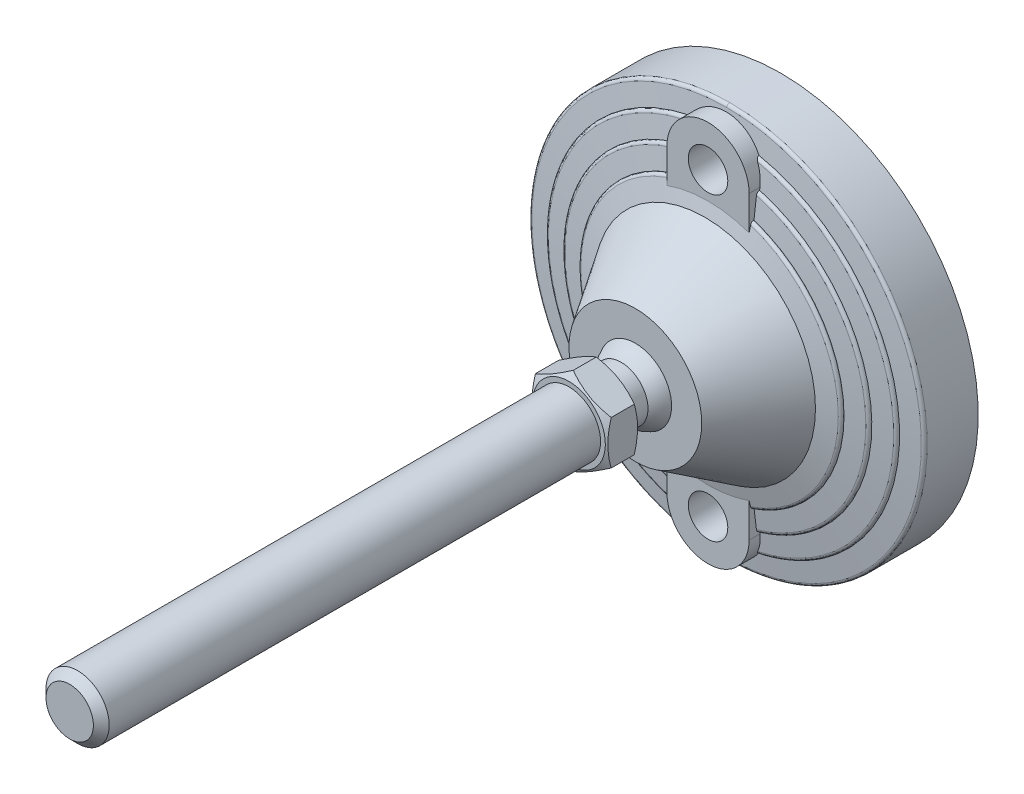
ISO-10303-21;
HEADER;
FILE_DESCRIPTION(('STEP AP214'),'2;1');
FILE_NAME('part.step','',(''),(''),'','','');
FILE_SCHEMA(('AUTOMOTIVE_DESIGN { 1 0 10303 214 1 1 1 1 }'));
ENDSEC;
DATA;
#1=APPLICATION_CONTEXT('core data for automotive mechanical design processes');
#2=APPLICATION_PROTOCOL_DEFINITION('international standard','automotive_design',2000,#1);
#3=PRODUCT_CONTEXT('',#1,'mechanical');
#4=PRODUCT('Part','Part','',(#3));
#5=PRODUCT_RELATED_PRODUCT_CATEGORY('part','',(#4));
#6=PRODUCT_DEFINITION_FORMATION('','',#4);
#7=PRODUCT_DEFINITION_CONTEXT('part definition',#1,'design');
#8=PRODUCT_DEFINITION('design','',#6,#7);
#9=PRODUCT_DEFINITION_SHAPE('','',#8);
#10=(LENGTH_UNIT() NAMED_UNIT(*) SI_UNIT(.MILLI.,.METRE.));
#11=(NAMED_UNIT(*) PLANE_ANGLE_UNIT() SI_UNIT($,.RADIAN.));
#12=(NAMED_UNIT(*) SI_UNIT($,.STERADIAN.) SOLID_ANGLE_UNIT());
#13=UNCERTAINTY_MEASURE_WITH_UNIT(LENGTH_MEASURE(1.E-05),#10,'distance_accuracy_value','');
#14=(GEOMETRIC_REPRESENTATION_CONTEXT(3) GLOBAL_UNCERTAINTY_ASSIGNED_CONTEXT((#13)) GLOBAL_UNIT_ASSIGNED_CONTEXT((#10,
#11,#12)) REPRESENTATION_CONTEXT('',''));
#15=CARTESIAN_POINT('',(0.,0.,0.));
#16=DIRECTION('',(0.,0.,1.));
#17=DIRECTION('',(1.,0.,0.));
#18=AXIS2_PLACEMENT_3D('',#15,#16,#17);
#19=CARTESIAN_POINT('',(-12.,14.022683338,60.));
#20=DIRECTION('',(0.,0.,1.));
#21=DIRECTION('',(0.,-1.,0.));
#22=AXIS2_PLACEMENT_3D('',#19,#20,#21);
#23=PLANE('',#22);
#24=CARTESIAN_POINT('',(0.,0.,60.));
#25=DIRECTION('',(0.,0.,-1.));
#26=DIRECTION('',(0.,1.,0.));
#27=AXIS2_PLACEMENT_3D('',#24,#25,#26);
#28=CIRCLE('',#27,11.5);
#29=CARTESIAN_POINT('',(0.,11.5,60.));
#30=VERTEX_POINT('',#29);
#31=EDGE_CURVE('E212',#30,#30,#28,.T.);
#32=ORIENTED_EDGE('',*,*,#31,.T.);
#33=EDGE_LOOP('',(#32));
#34=FACE_BOUND('',#33,.T.);
#35=CARTESIAN_POINT('',(0.,0.,60.));
#36=DIRECTION('',(0.,0.,-1.));
#37=DIRECTION('',(1.,0.,0.));
#38=AXIS2_PLACEMENT_3D('',#35,#36,#37);
#39=CIRCLE('',#38,8.5);
#40=CARTESIAN_POINT('',(8.5,0.,60.));
#41=VERTEX_POINT('',#40);
#42=EDGE_CURVE('E226',#41,#41,#39,.T.);
#43=ORIENTED_EDGE('',*,*,#42,.F.);
#44=EDGE_LOOP('',(#43));
#45=FACE_BOUND('',#44,.T.);
#46=ADVANCED_FACE('F14',(#34,#45),#23,.F.);
#47=CARTESIAN_POINT('',(0.,0.,60.));
#48=DIRECTION('',(0.,0.,-1.));
#49=DIRECTION('',(1.,0.,0.));
#50=AXIS2_PLACEMENT_3D('',#47,#48,#49);
#51=CYLINDRICAL_SURFACE('',#50,8.5);
#52=CARTESIAN_POINT('',(0.,0.,53.5));
#53=DIRECTION('',(0.,0.,-1.));
#54=DIRECTION('',(1.,0.,0.));
#55=AXIS2_PLACEMENT_3D('',#52,#53,#54);
#56=CIRCLE('',#55,8.5);
#57=CARTESIAN_POINT('',(8.5,0.,53.5));
#58=VERTEX_POINT('',#57);
#59=EDGE_CURVE('E477',#58,#58,#56,.F.);
#60=ORIENTED_EDGE('',*,*,#59,.T.);
#61=EDGE_LOOP('',(#60));
#62=FACE_BOUND('',#61,.T.);
#63=ORIENTED_EDGE('',*,*,#42,.T.);
#64=EDGE_LOOP('',(#63));
#65=FACE_BOUND('',#64,.T.);
#66=ADVANCED_FACE('F1093',(#62,#65),#51,.T.);
#67=CARTESIAN_POINT('',(-55.851524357,55.66,0.));
#68=DIRECTION('',(0.,0.,1.));
#69=DIRECTION('',(0.,-1.,0.));
#70=AXIS2_PLACEMENT_3D('',#67,#68,#69);
#71=PLANE('',#70);
#72=CARTESIAN_POINT('',(0.,0.,0.));
#73=DIRECTION('',(0.,0.,-1.));
#74=DIRECTION('',(0.,1.,0.));
#75=AXIS2_PLACEMENT_3D('',#72,#73,#74);
#76=CIRCLE('',#75,55.);
#77=CARTESIAN_POINT('',(0.,55.,0.));
#78=VERTEX_POINT('',#77);
#79=EDGE_CURVE('E480',#78,#78,#76,.F.);
#80=ORIENTED_EDGE('',*,*,#79,.F.);
#81=EDGE_LOOP('',(#80));
#82=FACE_BOUND('',#81,.T.);
#83=ADVANCED_FACE('F1083',(#82),#71,.F.);
#84=CARTESIAN_POINT('',(-8.631599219,8.622532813,53.5));
#85=DIRECTION('',(0.,0.,1.));
#86=DIRECTION('',(0.,-1.,0.));
#87=AXIS2_PLACEMENT_3D('',#84,#85,#86);
#88=PLANE('',#87);
#89=CARTESIAN_POINT('',(0.,0.,53.5));
#90=DIRECTION('',(0.,0.,-1.));
#91=DIRECTION('',(0.,1.,0.));
#92=AXIS2_PLACEMENT_3D('',#89,#90,#91);
#93=CIRCLE('',#92,8.49107182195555);
#94=CARTESIAN_POINT('',(0.,8.49107182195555,53.5));
#95=VERTEX_POINT('',#94);
#96=EDGE_CURVE('E483',#95,#95,#93,.T.);
#97=ORIENTED_EDGE('',*,*,#96,.F.);
#98=EDGE_LOOP('',(#97));
#99=FACE_BOUND('',#98,.T.);
#100=ORIENTED_EDGE('',*,*,#59,.F.);
#101=EDGE_LOOP('',(#100));
#102=FACE_BOUND('',#101,.T.);
#103=ADVANCED_FACE('F1074',(#99,#102),#88,.F.);
#104=CARTESIAN_POINT('',(0.,0.,3.));
#105=DIRECTION('',(0.,0.,-1.));
#106=DIRECTION('',(0.,1.,0.));
#107=AXIS2_PLACEMENT_3D('',#104,#105,#106);
#108=CYLINDRICAL_SURFACE('',#107,55.);
#109=ORIENTED_EDGE('',*,*,#79,.T.);
#110=EDGE_LOOP('',(#109));
#111=FACE_BOUND('',#110,.T.);
#112=CARTESIAN_POINT('',(0.,0.,3.));
#113=DIRECTION('',(0.,0.,-1.));
#114=DIRECTION('',(0.,1.,0.));
#115=AXIS2_PLACEMENT_3D('',#112,#113,#114);
#116=CIRCLE('',#115,55.);
#117=CARTESIAN_POINT('',(0.,55.,3.));
#118=VERTEX_POINT('',#117);
#119=EDGE_CURVE('E486',#118,#118,#116,.T.);
#120=ORIENTED_EDGE('',*,*,#119,.T.);
#121=EDGE_LOOP('',(#120));
#122=FACE_BOUND('',#121,.T.);
#123=ADVANCED_FACE('F603',(#111,#122),#108,.T.);
#124=CARTESIAN_POINT('',(0.,0.,44.670266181));
#125=DIRECTION('',(0.,0.,-1.));
#126=DIRECTION('',(1.,0.,0.));
#127=AXIS2_PLACEMENT_3D('',#124,#125,#126);
#128=SPHERICAL_SURFACE('',#127,12.25);
#129=CARTESIAN_POINT('',(0.,0.,49.));
#130=DIRECTION('',(0.,0.,-1.));
#131=DIRECTION('',(0.,1.,0.));
#132=AXIS2_PLACEMENT_3D('',#129,#130,#131);
#133=CIRCLE('',#132,11.4593152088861);
#134=CARTESIAN_POINT('',(0.,11.4593152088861,49.));
#135=VERTEX_POINT('',#134);
#136=EDGE_CURVE('E489',#135,#135,#133,.F.);
#137=ORIENTED_EDGE('',*,*,#136,.T.);
#138=EDGE_LOOP('',(#137));
#139=FACE_BOUND('',#138,.T.);
#140=ORIENTED_EDGE('',*,*,#96,.T.);
#141=EDGE_LOOP('',(#140));
#142=FACE_BOUND('',#141,.T.);
#143=ADVANCED_FACE('F598',(#139,#142),#128,.T.);
#144=CARTESIAN_POINT('',(-6.346764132,-41.175,3.));
#145=DIRECTION('',(0.,0.,1.));
#146=DIRECTION('',(0.,-1.,0.));
#147=AXIS2_PLACEMENT_3D('',#144,#145,#146);
#148=PLANE('',#147);
#149=CARTESIAN_POINT('',(0.,-47.5,3.));
#150=DIRECTION('',(0.,0.,1.));
#151=DIRECTION('',(0.,-1.,0.));
#152=AXIS2_PLACEMENT_3D('',#149,#150,#151);
#153=CIRCLE('',#152,6.25);
#154=CARTESIAN_POINT('',(0.,-53.75,3.));
#155=VERTEX_POINT('',#154);
#156=EDGE_CURVE('E451',#155,#155,#153,.T.);
#157=ORIENTED_EDGE('',*,*,#156,.T.);
#158=EDGE_LOOP('',(#157));
#159=FACE_BOUND('',#158,.T.);
#160=ADVANCED_FACE('F602',(#159),#148,.T.);
#161=CARTESIAN_POINT('',(-63.467641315,63.25,3.));
#162=DIRECTION('',(0.,0.,1.));
#163=DIRECTION('',(0.,-1.,0.));
#164=AXIS2_PLACEMENT_3D('',#161,#162,#163);
#165=PLANE('',#164);
#166=ORIENTED_EDGE('',*,*,#119,.F.);
#167=EDGE_LOOP('',(#166));
#168=FACE_BOUND('',#167,.T.);
#169=CARTESIAN_POINT('',(0.,0.,3.));
#170=DIRECTION('',(0.,0.,-1.));
#171=DIRECTION('',(0.,1.,0.));
#172=AXIS2_PLACEMENT_3D('',#169,#170,#171);
#173=CIRCLE('',#172,62.5);
#174=CARTESIAN_POINT('',(0.,62.5,3.));
#175=VERTEX_POINT('',#174);
#176=EDGE_CURVE('E414',#175,#175,#173,.F.);
#177=ORIENTED_EDGE('',*,*,#176,.F.);
#178=EDGE_LOOP('',(#177));
#179=FACE_BOUND('',#178,.T.);
#180=ADVANCED_FACE('F1054',(#168,#179),#165,.F.);
#181=CARTESIAN_POINT('',(-21.325127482,-21.252,49.));
#182=DIRECTION('',(0.,0.,-1.));
#183=DIRECTION('',(0.,1.,0.));
#184=AXIS2_PLACEMENT_3D('',#181,#182,#183);
#185=PLANE('',#184);
#186=ORIENTED_EDGE('',*,*,#136,.F.);
#187=EDGE_LOOP('',(#186));
#188=FACE_BOUND('',#187,.T.);
#189=CARTESIAN_POINT('',(0.,0.,49.));
#190=DIRECTION('',(0.,0.,-1.));
#191=DIRECTION('',(1.,0.,0.));
#192=AXIS2_PLACEMENT_3D('',#189,#190,#191);
#193=CIRCLE('',#192,21.);
#194=CARTESIAN_POINT('',(21.,0.,49.));
#195=VERTEX_POINT('',#194);
#196=EDGE_CURVE('E588',#195,#195,#193,.T.);
#197=ORIENTED_EDGE('',*,*,#196,.F.);
#198=EDGE_LOOP('',(#197));
#199=FACE_BOUND('',#198,.T.);
#200=ADVANCED_FACE('F608',(#188,#199),#185,.F.);
#201=CARTESIAN_POINT('',(0.,-47.5,3.));
#202=DIRECTION('',(0.,0.,1.));
#203=DIRECTION('',(0.,-1.,0.));
#204=AXIS2_PLACEMENT_3D('',#201,#202,#203);
#205=CYLINDRICAL_SURFACE('',#204,6.25);
#206=ORIENTED_EDGE('',*,*,#156,.F.);
#207=EDGE_LOOP('',(#206));
#208=FACE_BOUND('',#207,.T.);
#209=CARTESIAN_POINT('',(0.,-47.5,26.));
#210=DIRECTION('',(0.,0.,1.));
#211=DIRECTION('',(0.,-1.,0.));
#212=AXIS2_PLACEMENT_3D('',#209,#210,#211);
#213=CIRCLE('',#212,6.25);
#214=CARTESIAN_POINT('',(0.,-53.75,26.));
#215=VERTEX_POINT('',#214);
#216=EDGE_CURVE('E587',#215,#215,#213,.T.);
#217=ORIENTED_EDGE('',*,*,#216,.T.);
#218=EDGE_LOOP('',(#217));
#219=FACE_BOUND('',#218,.T.);
#220=ADVANCED_FACE('F606',(#208,#219),#205,.F.);
#221=CARTESIAN_POINT('',(-6.346764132,53.825,3.));
#222=DIRECTION('',(0.,0.,1.));
#223=DIRECTION('',(0.,-1.,0.));
#224=AXIS2_PLACEMENT_3D('',#221,#222,#223);
#225=PLANE('',#224);
#226=CARTESIAN_POINT('',(0.,47.5,3.));
#227=DIRECTION('',(0.,0.,1.));
#228=DIRECTION('',(0.,-1.,0.));
#229=AXIS2_PLACEMENT_3D('',#226,#227,#228);
#230=CIRCLE('',#229,6.25);
#231=CARTESIAN_POINT('',(0.,41.25,3.));
#232=VERTEX_POINT('',#231);
#233=EDGE_CURVE('E239',#232,#232,#230,.T.);
#234=ORIENTED_EDGE('',*,*,#233,.T.);
#235=EDGE_LOOP('',(#234));
#236=FACE_BOUND('',#235,.T.);
#237=ADVANCED_FACE('F335',(#236),#225,.T.);
#238=CARTESIAN_POINT('',(12.406354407,39.602176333,24.568111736));
#239=CARTESIAN_POINT('',(59.707464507,24.78394183,24.568111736));
#240=CARTESIAN_POINT('',(59.707464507,-24.78394183,24.568111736));
#241=CARTESIAN_POINT('',(12.406354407,-39.602176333,24.568111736));
#242=CARTESIAN_POINT('',(12.406354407,39.602176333,25.044046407));
#243=CARTESIAN_POINT('',(59.707464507,24.78394183,25.044046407));
#244=CARTESIAN_POINT('',(59.707464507,-24.78394183,25.044046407));
#245=CARTESIAN_POINT('',(12.406354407,-39.602176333,25.044046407));
#246=CARTESIAN_POINT('',(12.31903347,39.323440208,25.419805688));
#247=CARTESIAN_POINT('',(59.287219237,24.609502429,25.419805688));
#248=CARTESIAN_POINT('',(59.287219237,-24.609502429,25.419805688));
#249=CARTESIAN_POINT('',(12.31903347,-39.323440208,25.419805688));
#250=CARTESIAN_POINT('',(12.18115046,38.883305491,25.53720891));
#251=CARTESIAN_POINT('',(58.623636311,24.334056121,25.53720891));
#252=CARTESIAN_POINT('',(58.623636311,-24.334056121,25.53720891));
#253=CARTESIAN_POINT('',(12.18115046,-38.883305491,25.53720891));
#254=(BOUNDED_SURFACE() B_SPLINE_SURFACE(3,3,((#238,#239,#240,#241),(#242,#243,#244,#245),(#246,
#247,#248,#249),(#250,#251,#252,#253)),.UNSPECIFIED.,.F.,.F.,
.F.) B_SPLINE_SURFACE_WITH_KNOTS((4,4),(4,4),(0.,1.),(0.,1.),
.UNSPECIFIED.) GEOMETRIC_REPRESENTATION_ITEM() RATIONAL_B_SPLINE_SURFACE(((1.,0.532632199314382,
0.532632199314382,1.),(0.859679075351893,0.457892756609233,0.457892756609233,0.859679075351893),
(0.859679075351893,0.457892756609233,0.457892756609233,0.859679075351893),(1.,0.532632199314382,
0.532632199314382,1.))) REPRESENTATION_ITEM('') SURFACE());
#255=CARTESIAN_POINT('',(0.,0.,25.5372089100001));
#256=DIRECTION('',(0.,0.,-1.));
#257=DIRECTION('',(0.,1.,0.));
#258=AXIS2_PLACEMENT_3D('',#255,#256,#257);
#259=CIRCLE('',#258,40.746679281);
#260=CARTESIAN_POINT('',(13.,-38.6172483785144,25.537208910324));
#261=VERTEX_POINT('',#260);
#262=CARTESIAN_POINT('',(13.,38.6172483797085,25.5372089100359));
#263=VERTEX_POINT('',#262);
#264=EDGE_CURVE('E452',#261,#263,#259,.F.);
#265=CARTESIAN_POINT('',(13.,-39.4112927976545,24.5681117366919));
#266=CARTESIAN_POINT('',(13.,-39.4112933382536,24.59521048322));
#267=CARTESIAN_POINT('',(13.,-39.4101321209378,24.6222958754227));
#268=CARTESIAN_POINT('',(13.,-39.405504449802,24.6762650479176));
#269=CARTESIAN_POINT('',(13.,-39.4020383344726,24.7031488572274));
#270=CARTESIAN_POINT('',(13.,-39.3882336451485,24.7831079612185));
#271=CARTESIAN_POINT('',(13.,-39.3744885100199,24.8356344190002));
#272=CARTESIAN_POINT('',(13.,-39.3384084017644,24.937608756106));
#273=CARTESIAN_POINT('',(13.,-39.3160736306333,24.9870567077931));
#274=CARTESIAN_POINT('',(13.,-39.263590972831,25.0816017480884));
#275=CARTESIAN_POINT('',(13.,-39.233444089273,25.1266993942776));
#276=CARTESIAN_POINT('',(13.,-39.1656058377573,25.2123360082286));
#277=CARTESIAN_POINT('',(13.,-39.1277714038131,25.2527614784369));
#278=CARTESIAN_POINT('',(13.,-39.0461074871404,25.327071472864));
#279=CARTESIAN_POINT('',(13.,-39.0022718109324,25.3609491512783));
#280=CARTESIAN_POINT('',(13.,-38.9043172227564,25.4250520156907));
#281=CARTESIAN_POINT('',(13.,-38.8495953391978,25.454364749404));
#282=CARTESIAN_POINT('',(13.,-38.7644641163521,25.4909906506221));
#283=CARTESIAN_POINT('',(13.,-38.7355751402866,25.5019763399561));
#284=CARTESIAN_POINT('',(13.,-38.6769796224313,25.5214626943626));
#285=CARTESIAN_POINT('',(13.,-38.6472733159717,25.5299640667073));
#286=CARTESIAN_POINT('',(13.,-38.6172483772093,25.5372089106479));
#287=B_SPLINE_CURVE_WITH_KNOTS('',3,(#265,#266,#267,#268,#269,#270,#271,#272,#273,#274,#275,
#276,#277,#278,#279,#280,#281,#282,#283,#284,#285,#286),.UNSPECIFIED.,.F.,.F.,(4,2,2,2,2,2,2,2,
2,2,4),(0.,0.0812450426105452,0.162478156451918,0.32451953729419,0.486557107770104,
0.648573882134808,0.813939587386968,0.979477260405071,1.16468654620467,1.25731455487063,
1.34991616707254),.UNSPECIFIED.);
#288=CARTESIAN_POINT('',(13.,-39.4112927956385,24.568111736));
#289=VERTEX_POINT('',#288);
#290=EDGE_CURVE('E321',#289,#261,#287,.T.);
#291=CARTESIAN_POINT('',(0.,0.,24.568111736));
#292=DIRECTION('',(0.,0.,-1.));
#293=DIRECTION('',(0.,1.,0.));
#294=AXIS2_PLACEMENT_3D('',#291,#292,#293);
#295=CIRCLE('',#294,41.5);
#296=CARTESIAN_POINT('',(13.,39.4112927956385,24.5681117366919));
#297=VERTEX_POINT('',#296);
#298=EDGE_CURVE('E449',#297,#289,#295,.T.);
#299=CARTESIAN_POINT('',(13.,38.6172483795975,25.5372089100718));
#300=CARTESIAN_POINT('',(13.,38.6757273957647,25.5231434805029));
#301=CARTESIAN_POINT('',(13.,38.7330575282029,25.5042077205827));
#302=CARTESIAN_POINT('',(13.,38.843898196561,25.4570874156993));
#303=CARTESIAN_POINT('',(13.,38.8974017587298,25.4288864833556));
#304=CARTESIAN_POINT('',(13.,38.9989209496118,25.3637346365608));
#305=CARTESIAN_POINT('',(13.,39.0469285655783,25.3267711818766));
#306=CARTESIAN_POINT('',(13.,39.1357078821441,25.2450475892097));
#307=CARTESIAN_POINT('',(13.,39.1764870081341,25.2002955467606));
#308=CARTESIAN_POINT('',(13.,39.2479885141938,25.1059931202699));
#309=CARTESIAN_POINT('',(13.,39.2790300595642,25.0566848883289));
#310=CARTESIAN_POINT('',(13.,39.3318958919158,24.9533393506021));
#311=CARTESIAN_POINT('',(13.,39.3537228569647,24.8993034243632));
#312=CARTESIAN_POINT('',(13.,39.3839717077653,24.7991363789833));
#313=CARTESIAN_POINT('',(13.,39.3941848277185,24.7535382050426));
#314=CARTESIAN_POINT('',(13.,39.4078594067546,24.6613400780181));
#315=CARTESIAN_POINT('',(13.,39.411320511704,24.6147400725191));
#316=CARTESIAN_POINT('',(13.,39.4112927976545,24.5681117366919));
#317=B_SPLINE_CURVE_WITH_KNOTS('',3,(#299,#300,#301,#302,#303,#304,#305,#306,#307,#308,#309,
#310,#311,#312,#313,#314,#315,#316),.UNSPECIFIED.,.F.,.F.,(4,2,2,2,2,2,2,2,4),(0.,
0.180276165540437,0.360872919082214,0.541729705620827,0.722399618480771,0.89631033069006,
1.07017046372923,1.20986980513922,1.34957647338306),.UNSPECIFIED.);
#318=EDGE_CURVE('E238',#263,#297,#317,.T.);
#319=ORIENTED_EDGE('',*,*,#264,.F.);
#320=ORIENTED_EDGE('',*,*,#290,.F.);
#321=ORIENTED_EDGE('',*,*,#298,.F.);
#322=ORIENTED_EDGE('',*,*,#318,.F.);
#323=EDGE_LOOP('',(#319,#320,#321,#322));
#324=FACE_BOUND('',#323,.T.);
#325=ADVANCED_FACE('F610',(#324),#254,.T.);
#326=CARTESIAN_POINT('',(0.,0.,24.568111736));
#327=DIRECTION('',(0.,0.,-1.));
#328=DIRECTION('',(0.,1.,0.));
#329=AXIS2_PLACEMENT_3D('',#326,#327,#328);
#330=CYLINDRICAL_SURFACE('',#329,41.5);
#331=CARTESIAN_POINT('',(0.,0.,24.454545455));
#332=DIRECTION('',(0.,0.,-1.));
#333=DIRECTION('',(0.,1.,0.));
#334=AXIS2_PLACEMENT_3D('',#331,#332,#333);
#335=CIRCLE('',#334,41.5);
#336=CARTESIAN_POINT('',(13.,39.4112927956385,24.454545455));
#337=VERTEX_POINT('',#336);
#338=CARTESIAN_POINT('',(13.,-39.4112927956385,24.4545454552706));
#339=VERTEX_POINT('',#338);
#340=EDGE_CURVE('E447',#337,#339,#335,.T.);
#341=ORIENTED_EDGE('',*,*,#340,.F.);
#342=DIRECTION('',(0.,0.,-1.));
#343=VECTOR('',#342,1.);
#344=CARTESIAN_POINT('',(13.,39.4112927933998,24.2785712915));
#345=LINE('',#344,#343);
#346=EDGE_CURVE('E291',#297,#337,#345,.T.);
#347=ORIENTED_EDGE('',*,*,#346,.F.);
#348=ORIENTED_EDGE('',*,*,#298,.T.);
#349=DIRECTION('',(0.,0.,1.));
#350=VECTOR('',#349,1.);
#351=CARTESIAN_POINT('',(13.,-39.4112927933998,24.2785712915));
#352=LINE('',#351,#350);
#353=EDGE_CURVE('E319',#339,#289,#352,.T.);
#354=ORIENTED_EDGE('',*,*,#353,.F.);
#355=EDGE_LOOP('',(#341,#347,#348,#354));
#356=FACE_BOUND('',#355,.T.);
#357=ADVANCED_FACE('F303',(#356),#330,.T.);
#358=CARTESIAN_POINT('',(0.,0.,24.454545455));
#359=DIRECTION('',(0.,0.,-1.));
#360=DIRECTION('',(0.,1.,0.));
#361=AXIS2_PLACEMENT_3D('',#358,#359,#360);
#362=CONICAL_SURFACE('',#361,41.5,1.4442041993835);
#363=ORIENTED_EDGE('',*,*,#340,.T.);
#364=CARTESIAN_POINT('',(13.0000000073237,-45.8176832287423,23.6748403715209));
#365=CARTESIAN_POINT('',(13.0000000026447,-45.2838642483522,23.7402005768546));
#366=CARTESIAN_POINT('',(13.000000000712,-44.7500350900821,23.8054777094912));
#367=CARTESIAN_POINT('',(12.999999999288,-43.6823542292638,23.9358466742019));
#368=CARTESIAN_POINT('',(12.9999999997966,-43.1485025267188,24.0009385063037));
#369=CARTESIAN_POINT('',(13.0000000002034,-42.0807742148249,24.1309177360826));
#370=CARTESIAN_POINT('',(13.0000000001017,-41.5468976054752,24.195805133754));
#371=CARTESIAN_POINT('',(12.9999999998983,-40.4791166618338,24.3253520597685));
#372=CARTESIAN_POINT('',(12.9999999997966,-39.9452123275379,24.3900115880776));
#373=CARTESIAN_POINT('',(13.,-39.4112927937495,24.4545454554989));
#374=B_SPLINE_CURVE_WITH_KNOTS('',3,(#364,#365,#366,#367,#368,#369,#370,#371,#372,#373),
.UNSPECIFIED.,.F.,.F.,(4,2,2,2,4),(0.,1.61341623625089,3.22683223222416,4.84024827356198,
6.4536645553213),.UNSPECIFIED.);
#375=CARTESIAN_POINT('',(13.,-45.8176832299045,23.674840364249));
#376=VERTEX_POINT('',#375);
#377=EDGE_CURVE('E311',#376,#339,#374,.T.);
#378=ORIENTED_EDGE('',*,*,#377,.F.);
#379=CARTESIAN_POINT('',(-7.48558333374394E-10,0.,23.674840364));
#380=DIRECTION('',(0.,0.,-1.));
#381=DIRECTION('',(0.,1.,0.));
#382=AXIS2_PLACEMENT_3D('',#379,#380,#381);
#383=CIRCLE('',#382,47.6262542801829);
#384=CARTESIAN_POINT('',(13.,45.8176832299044,23.6748403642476));
#385=VERTEX_POINT('',#384);
#386=EDGE_CURVE('E412',#385,#376,#383,.T.);
#387=ORIENTED_EDGE('',*,*,#386,.F.);
#388=CARTESIAN_POINT('',(13.,39.4112927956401,24.4545454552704));
#389=CARTESIAN_POINT('',(13.,39.9452123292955,24.3900115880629));
#390=CARTESIAN_POINT('',(13.,40.4791166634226,24.3253520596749));
#391=CARTESIAN_POINT('',(13.,41.5468976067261,24.195805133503));
#392=CARTESIAN_POINT('',(13.,42.0807742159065,24.1309177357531));
#393=CARTESIAN_POINT('',(13.,43.1485025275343,24.0009385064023));
#394=CARTESIAN_POINT('',(13.,43.6823542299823,23.9358466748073));
#395=CARTESIAN_POINT('',(13.,44.7500350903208,23.805477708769));
#396=CARTESIAN_POINT('',(13.,45.283864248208,23.7402005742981));
#397=CARTESIAN_POINT('',(13.,45.8176832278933,23.6748403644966));
#398=B_SPLINE_CURVE_WITH_KNOTS('',3,(#388,#389,#390,#391,#392,#393,#394,#395,#396,#397),
.UNSPECIFIED.,.F.,.F.,(4,2,2,2,4),(0.,1.61341628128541,3.22683232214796,4.84024831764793,
6.45366455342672),.UNSPECIFIED.);
#399=EDGE_CURVE('E283',#337,#385,#398,.T.);
#400=ORIENTED_EDGE('',*,*,#399,.F.);
#401=EDGE_LOOP('',(#363,#378,#387,#400));
#402=FACE_BOUND('',#401,.T.);
#403=ADVANCED_FACE('F298',(#402),#362,.T.);
#404=CARTESIAN_POINT('',(12.269850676,46.922284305,22.669623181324));
#405=CARTESIAN_POINT('',(72.557631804,31.157449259,22.669623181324));
#406=CARTESIAN_POINT('',(72.557631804,-31.157449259,22.669623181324));
#407=CARTESIAN_POINT('',(12.269850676,-46.922284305,22.669623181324));
#408=CARTESIAN_POINT('',(12.269850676,46.922284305,22.6740296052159));
#409=CARTESIAN_POINT('',(72.557631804,31.157449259,22.674029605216));
#410=CARTESIAN_POINT('',(72.557631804,-31.157449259,22.674029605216));
#411=CARTESIAN_POINT('',(12.269850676,-46.922284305,22.6740296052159));
#412=CARTESIAN_POINT('',(12.269850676,46.922284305,22.678436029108));
#413=CARTESIAN_POINT('',(72.557631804,31.157449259,22.678436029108));
#414=CARTESIAN_POINT('',(72.557631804,-31.157449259,22.678436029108));
#415=CARTESIAN_POINT('',(12.269850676,-46.922284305,22.678436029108));
#416=CARTESIAN_POINT('',(12.269850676,46.922284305,22.682842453));
#417=CARTESIAN_POINT('',(72.557631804,31.157449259,22.682842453));
#418=CARTESIAN_POINT('',(72.557631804,-31.157449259,22.682842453));
#419=CARTESIAN_POINT('',(12.269850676,-46.922284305,22.682842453));
#420=CARTESIAN_POINT('',(12.269850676,46.922284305,23.211436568));
#421=CARTESIAN_POINT('',(72.557631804,31.157449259,23.211436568));
#422=CARTESIAN_POINT('',(72.557631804,-31.157449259,23.211436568));
#423=CARTESIAN_POINT('',(12.269850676,-46.922284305,23.211436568));
#424=CARTESIAN_POINT('',(12.181461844,46.584268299,23.608103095));
#425=CARTESIAN_POINT('',(72.034945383,30.93299905,23.608103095));
#426=CARTESIAN_POINT('',(72.034945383,-30.93299905,23.608103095));
#427=CARTESIAN_POINT('',(12.181461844,-46.584268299,23.608103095));
#428=CARTESIAN_POINT('',(12.048804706,46.076961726,23.674840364));
#429=CARTESIAN_POINT('',(71.250478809,30.596136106,23.674840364));
#430=CARTESIAN_POINT('',(71.250478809,-30.596136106,23.674840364));
#431=CARTESIAN_POINT('',(12.048804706,-46.076961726,23.674840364));
#432=(BOUNDED_SURFACE() B_SPLINE_SURFACE(3,3,((#404,#405,#406,#407),(#408,#409,#410,#411),(#412,
#413,#414,#415),(#416,#417,#418,#419),(#420,#421,#422,#423),(#424,#425,#426,#427),(#428,#429,
#430,#431)),.UNSPECIFIED.,.F.,.F.,.F.) B_SPLINE_SURFACE_WITH_KNOTS((4,3,4),(4,4),(-0.01,0.,1.),
(0.,1.),.UNSPECIFIED.) GEOMETRIC_REPRESENTATION_ITEM() RATIONAL_B_SPLINE_SURFACE(((1.,
0.501991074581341,0.501991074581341,1.),(1.,0.501991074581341,0.501991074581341,1.),(1.,
0.501991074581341,0.501991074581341,1.),(1.,0.501991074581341,0.501991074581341,1.),
(0.833611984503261,0.418465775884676,0.418465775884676,0.833611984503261),(0.833611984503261,
0.418465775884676,0.418465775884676,0.833611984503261),(1.,0.501991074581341,0.501991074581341,1.))) REPRESENTATION_ITEM('') SURFACE());
#433=CARTESIAN_POINT('',(13.,-46.7252608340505,22.6777848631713));
#434=CARTESIAN_POINT('',(13.,-46.7253979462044,22.7054287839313));
#435=CARTESIAN_POINT('',(13.,-46.7243484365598,22.7330653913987));
#436=CARTESIAN_POINT('',(13.,-46.7198870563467,22.7881439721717));
#437=CARTESIAN_POINT('',(13.,-46.7164754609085,22.8155859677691));
#438=CARTESIAN_POINT('',(13.,-46.7027375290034,22.8972169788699));
#439=CARTESIAN_POINT('',(13.,-46.688908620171,22.9508576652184));
#440=CARTESIAN_POINT('',(13.,-46.6523707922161,23.0550506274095));
#441=CARTESIAN_POINT('',(13.,-46.6296523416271,23.1055995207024));
#442=CARTESIAN_POINT('',(13.,-46.5760978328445,23.2021956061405));
#443=CARTESIAN_POINT('',(13.,-46.545261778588,23.248242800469));
#444=CARTESIAN_POINT('',(13.,-46.4762858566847,23.3348542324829));
#445=CARTESIAN_POINT('',(13.,-46.438110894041,23.3753904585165));
#446=CARTESIAN_POINT('',(13.,-46.3556866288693,23.4497572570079));
#447=CARTESIAN_POINT('',(13.,-46.3114344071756,23.4835845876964));
#448=CARTESIAN_POINT('',(13.,-46.2164675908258,23.5448274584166));
#449=CARTESIAN_POINT('',(13.,-46.1655796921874,23.5719736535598));
#450=CARTESIAN_POINT('',(13.,-46.0601083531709,23.6176355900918));
#451=CARTESIAN_POINT('',(13.,-46.0055288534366,23.6361603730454));
#452=CARTESIAN_POINT('',(13.,-45.9281089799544,23.6556819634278));
#453=CARTESIAN_POINT('',(13.,-45.9061721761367,23.660484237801));
#454=CARTESIAN_POINT('',(13.,-45.8620822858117,23.6686997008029));
#455=CARTESIAN_POINT('',(13.,-45.8399296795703,23.6721154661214));
#456=CARTESIAN_POINT('',(13.0000000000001,-45.817683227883,23.6748403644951));
#457=B_SPLINE_CURVE_WITH_KNOTS('',3,(#433,#434,#435,#436,#437,#438,#439,#440,#441,#442,#443,
#444,#445,#446,#447,#448,#449,#450,#451,#452,#453,#454,#455,#456),.UNSPECIFIED.,.F.,.F.,(4,2,2,
2,2,2,2,2,2,2,2,4),(0.,0.0828810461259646,0.165752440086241,0.331061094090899,0.496547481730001,
0.662033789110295,0.828332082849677,0.994710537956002,1.16697834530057,1.33906508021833,
1.40639957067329,1.47360834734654),.UNSPECIFIED.);
#458=CARTESIAN_POINT('',(13.0000000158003,-46.7252608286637,22.6777848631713));
#459=VERTEX_POINT('',#458);
#460=EDGE_CURVE('E320',#459,#376,#457,.T.);
#461=CARTESIAN_POINT('',(13.0000000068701,46.7252608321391,22.6727272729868));
#462=CARTESIAN_POINT('',(13.3212147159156,46.635891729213,22.6727272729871));
#463=CARTESIAN_POINT('',(13.6414983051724,46.5432129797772,22.6727272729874));
#464=CARTESIAN_POINT('',(14.2801231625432,46.3512597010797,22.672727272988));
#465=CARTESIAN_POINT('',(14.5984642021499,46.2519844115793,22.6727272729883));
#466=CARTESIAN_POINT('',(15.5526106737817,45.9435979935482,22.6727272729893));
#467=CARTESIAN_POINT('',(16.1852411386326,45.7245656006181,22.6727272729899));
#468=CARTESIAN_POINT('',(17.4409289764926,45.2604918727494,22.6727272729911));
#469=CARTESIAN_POINT('',(18.0639854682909,45.01544815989,22.6727272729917));
#470=CARTESIAN_POINT('',(19.3000708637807,44.4995075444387,22.672727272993));
#471=CARTESIAN_POINT('',(19.9130888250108,44.228584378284,22.6727272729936));
#472=CARTESIAN_POINT('',(21.1274202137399,43.6615551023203,22.6727272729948));
#473=CARTESIAN_POINT('',(21.7287319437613,43.3654453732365,22.6727272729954));
#474=CARTESIAN_POINT('',(23.5288179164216,42.4321391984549,22.6727272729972));
#475=CARTESIAN_POINT('',(24.7079785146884,41.7565378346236,22.6727272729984));
#476=CARTESIAN_POINT('',(27.0057517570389,40.308619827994,22.6727272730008));
#477=CARTESIAN_POINT('',(28.1243409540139,39.5362661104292,22.672727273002));
#478=CARTESIAN_POINT('',(30.294054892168,37.8994558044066,22.6727272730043));
#479=CARTESIAN_POINT('',(31.3451007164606,37.0348945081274,22.6727272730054));
#480=CARTESIAN_POINT('',(33.3707378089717,35.2206260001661,22.6727272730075));
#481=CARTESIAN_POINT('',(34.3453363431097,34.2709268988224,22.6727272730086));
#482=CARTESIAN_POINT('',(36.2141318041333,32.2900336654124,22.6727272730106));
#483=CARTESIAN_POINT('',(37.1080775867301,31.258602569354,22.6727272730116));
#484=CARTESIAN_POINT('',(38.8059105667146,29.1240638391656,22.6727272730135));
#485=CARTESIAN_POINT('',(39.6097954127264,28.0209543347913,22.6727272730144));
#486=CARTESIAN_POINT('',(41.1215543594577,25.7512426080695,22.6727272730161));
#487=CARTESIAN_POINT('',(41.8294551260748,24.5846581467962,22.6727272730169));
#488=CARTESIAN_POINT('',(43.1444737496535,22.1960153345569,22.6727272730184));
#489=CARTESIAN_POINT('',(43.7515922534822,20.9739573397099,22.6727272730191));
#490=CARTESIAN_POINT('',(44.8608053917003,18.482892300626,22.6727272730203));
#491=CARTESIAN_POINT('',(45.362887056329,17.2138794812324,22.6727272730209));
#492=CARTESIAN_POINT('',(46.2583633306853,14.6380667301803,22.6727272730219));
#493=CARTESIAN_POINT('',(46.6517577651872,13.331266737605,22.6727272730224));
#494=CARTESIAN_POINT('',(47.3270705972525,10.6891374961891,22.6727272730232));
#495=CARTESIAN_POINT('',(47.6089860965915,9.3538075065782,22.6727272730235));
#496=CARTESIAN_POINT('',(48.0593220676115,6.66414532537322,22.672727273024));
#497=CARTESIAN_POINT('',(48.2277425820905,5.30981314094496,22.6727272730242));
#498=CARTESIAN_POINT('',(48.4498861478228,2.5918387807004,22.6727272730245));
#499=CARTESIAN_POINT('',(48.5036145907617,1.2281970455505,22.6727272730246));
#500=CARTESIAN_POINT('',(48.4960080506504,-1.49876561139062,22.6727272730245));
#501=CARTESIAN_POINT('',(48.4346730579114,-2.86208653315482,22.6727272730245));
#502=CARTESIAN_POINT('',(48.1973677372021,-5.57880747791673,22.6727272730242));
#503=CARTESIAN_POINT('',(48.021389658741,-6.93220682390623,22.672727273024));
#504=CARTESIAN_POINT('',(47.5560413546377,-9.61936956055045,22.6727272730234));
#505=CARTESIAN_POINT('',(47.2666711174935,-10.9531329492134,22.6727272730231));
#506=CARTESIAN_POINT('',(46.5765756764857,-13.5916227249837,22.6727272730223));
#507=CARTESIAN_POINT('',(46.1758433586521,-14.8963472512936,22.6727272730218));
#508=CARTESIAN_POINT('',(45.2658742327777,-17.467402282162,22.6727272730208));
#509=CARTESIAN_POINT('',(44.7566374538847,-18.7337327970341,22.6727272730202));
#510=CARTESIAN_POINT('',(43.6334165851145,-21.218718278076,22.6727272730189));
#511=CARTESIAN_POINT('',(43.0194530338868,-22.4373825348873,22.6727272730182));
#512=CARTESIAN_POINT('',(41.6909757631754,-24.8187625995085,22.6727272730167));
#513=CARTESIAN_POINT('',(40.9764619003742,-25.9814783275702,22.6727272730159));
#514=CARTESIAN_POINT('',(39.7063025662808,-27.8655028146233,22.6727272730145));
#515=CARTESIAN_POINT('',(39.1770724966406,-28.6047764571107,22.6727272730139));
#516=CARTESIAN_POINT('',(38.0778809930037,-30.052466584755,22.6727272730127));
#517=CARTESIAN_POINT('',(37.5079195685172,-30.7608830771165,22.6727272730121));
#518=CARTESIAN_POINT('',(36.3291070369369,-32.1445499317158,22.6727272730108));
#519=CARTESIAN_POINT('',(35.7202564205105,-32.8198007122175,22.6727272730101));
#520=CARTESIAN_POINT('',(34.4653645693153,-34.1352484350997,22.6727272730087));
#521=CARTESIAN_POINT('',(33.8193109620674,-34.7754335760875,22.672727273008));
#522=CARTESIAN_POINT('',(32.4922294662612,-36.0184899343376,22.6727272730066));
#523=CARTESIAN_POINT('',(31.8112009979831,-36.6213605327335,22.6727272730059));
#524=CARTESIAN_POINT('',(30.4163089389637,-37.7878929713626,22.6727272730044));
#525=CARTESIAN_POINT('',(29.7024437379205,-38.351552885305,22.6727272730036));
#526=CARTESIAN_POINT('',(28.1769516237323,-39.4879139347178,22.672727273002));
#527=CARTESIAN_POINT('',(27.3623770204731,-40.0566641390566,22.6727272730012));
#528=CARTESIAN_POINT('',(25.6997855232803,-41.1431320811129,22.6727272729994));
#529=CARTESIAN_POINT('',(24.8517655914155,-41.6608451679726,22.6727272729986));
#530=CARTESIAN_POINT('',(23.1254909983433,-42.6432641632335,22.6727272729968));
#531=CARTESIAN_POINT('',(22.2472346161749,-43.1079670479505,22.6727272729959));
#532=CARTESIAN_POINT('',(20.462387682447,-43.9832963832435,22.6727272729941));
#533=CARTESIAN_POINT('',(19.5557530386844,-44.3938329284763,22.6727272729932));
#534=CARTESIAN_POINT('',(17.7189637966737,-45.1583612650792,22.6727272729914));
#535=CARTESIAN_POINT('',(16.7888095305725,-45.5123538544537,22.6727272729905));
#536=CARTESIAN_POINT('',(14.9085132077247,-46.1625049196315,22.6727272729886));
#537=CARTESIAN_POINT('',(13.9583713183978,-46.4586638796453,22.6727272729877));
#538=CARTESIAN_POINT('',(13.0000000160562,-46.7252608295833,22.6727272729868));
#539=B_SPLINE_CURVE_WITH_KNOTS('',3,(#461,#462,#463,#464,#465,#466,#467,#468,#469,#470,#471,
#472,#473,#474,#475,#476,#477,#478,#479,#480,#481,#482,#483,#484,#485,#486,#487,#488,#489,#490,
#491,#492,#493,#494,#495,#496,#497,#498,#499,#500,#501,#502,#503,#504,#505,#506,#507,#508,#509,
#510,#511,#512,#513,#514,#515,#516,#517,#518,#519,#520,#521,#522,#523,#524,#525,#526,#527,#528,
#529,#530,#531,#532,#533,#534,#535,#536,#537,#538),.UNSPECIFIED.,.F.,.F.,(4,2,2,2,2,2,2,2,2,2,2,
2,2,2,2,2,2,2,2,2,2,2,2,2,2,2,2,2,2,2,2,2,2,2,2,2,2,2,4),(0.,1.00020816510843,2.00053180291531,
4.00833027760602,6.01631246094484,8.02635452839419,10.0366859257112,14.1084282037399,
18.1817355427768,22.2597186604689,26.3373137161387,30.4271967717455,34.5171865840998,
38.6060377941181,42.6948627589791,46.7841923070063,50.8735284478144,54.9629708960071,
59.0524118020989,63.1416604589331,67.2309094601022,71.3204349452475,75.4099608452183,
79.499748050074,83.5895341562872,87.6785191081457,91.767509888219,94.4937471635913,
97.2199838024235,99.9461860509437,102.673300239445,105.400459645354,108.12775293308,
111.106299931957,114.085118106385,117.064106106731,120.047978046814,123.031807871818,
126.015612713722),.UNSPECIFIED.);
#540=CARTESIAN_POINT('',(13.0000000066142,46.7252608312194,22.6777848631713));
#541=VERTEX_POINT('',#540);
#542=EDGE_CURVE('E396',#541,#459,#539,.T.);
#543=CARTESIAN_POINT('',(13.,45.8176832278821,23.6748403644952));
#544=CARTESIAN_POINT('',(13.,45.8768916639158,23.6676266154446));
#545=CARTESIAN_POINT('',(13.,45.9354849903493,23.655431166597));
#546=CARTESIAN_POINT('',(13.,46.0498761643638,23.6214764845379));
#547=CARTESIAN_POINT('',(13.,46.1056719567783,23.5997103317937));
#548=CARTESIAN_POINT('',(13.,46.2128716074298,23.5469963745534));
#549=CARTESIAN_POINT('',(13.,46.2642705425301,23.5160384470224));
#550=CARTESIAN_POINT('',(13.,46.336724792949,23.4633763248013));
#551=CARTESIAN_POINT('',(13.,46.3600988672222,23.4447881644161));
#552=CARTESIAN_POINT('',(13.,46.405165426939,23.405625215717));
#553=CARTESIAN_POINT('',(13.,46.4268560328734,23.3850482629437));
#554=CARTESIAN_POINT('',(13.,46.4880645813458,23.3216088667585));
#555=CARTESIAN_POINT('',(13.,46.5249454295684,23.2761439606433));
#556=CARTESIAN_POINT('',(13.,46.5901806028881,23.1794685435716));
#557=CARTESIAN_POINT('',(13.,46.6185381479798,23.1282602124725));
#558=CARTESIAN_POINT('',(13.,46.653488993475,23.049293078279));
#559=CARTESIAN_POINT('',(13.,46.6637514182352,23.0231112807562));
#560=CARTESIAN_POINT('',(13.,46.6819716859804,22.9699855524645));
#561=CARTESIAN_POINT('',(13.,46.6899313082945,22.9430422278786));
#562=CARTESIAN_POINT('',(13.,46.7102220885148,22.8614024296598));
#563=CARTESIAN_POINT('',(13.,46.7190275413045,22.8057552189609));
#564=CARTESIAN_POINT('',(13.,46.7237631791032,22.737878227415));
#565=CARTESIAN_POINT('',(13.,46.7243742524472,22.7258595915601));
#566=CARTESIAN_POINT('',(13.,46.7251497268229,22.7018236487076));
#567=CARTESIAN_POINT('',(13.,46.7253147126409,22.6898063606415));
#568=CARTESIAN_POINT('',(13.,46.7252608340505,22.6777848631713));
#569=B_SPLINE_CURVE_WITH_KNOTS('',3,(#543,#544,#545,#546,#547,#548,#549,#550,#551,#552,#553,
#554,#555,#556,#557,#558,#559,#560,#561,#562,#563,#564,#565,#566,#567,#568),.UNSPECIFIED.,.F.,
.F.,(4,2,2,2,2,2,2,2,2,2,2,2,4),(0.,0.178718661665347,0.35756674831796,0.536612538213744,
0.626107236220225,0.715700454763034,0.890396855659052,1.0650271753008,1.14929679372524,
1.233501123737,1.40145319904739,1.43755286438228,1.47360518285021),.UNSPECIFIED.);
#570=EDGE_CURVE('E290',#385,#541,#569,.T.);
#571=ORIENTED_EDGE('',*,*,#386,.T.);
#572=ORIENTED_EDGE('',*,*,#460,.F.);
#573=ORIENTED_EDGE('',*,*,#542,.F.);
#574=ORIENTED_EDGE('',*,*,#570,.F.);
#575=EDGE_LOOP('',(#571,#572,#573,#574));
#576=FACE_BOUND('',#575,.T.);
#577=ADVANCED_FACE('F302',(#576),#432,.T.);
#578=CARTESIAN_POINT('',(0.,62.5,19.119206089));
#579=CARTESIAN_POINT('',(125.,62.5,19.119206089));
#580=CARTESIAN_POINT('',(125.,-62.5,19.119206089));
#581=CARTESIAN_POINT('',(0.,-62.5,19.119206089));
#582=CARTESIAN_POINT('',(0.,62.5,19.647800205));
#583=CARTESIAN_POINT('',(125.,62.5000000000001,19.647800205));
#584=CARTESIAN_POINT('',(125.,-62.5000000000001,19.647800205));
#585=CARTESIAN_POINT('',(0.,-62.5,19.647800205));
#586=CARTESIAN_POINT('',(0.,62.1506185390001,20.044466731));
#587=CARTESIAN_POINT('',(124.301237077,62.150618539,20.044466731));
#588=CARTESIAN_POINT('',(124.301237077,-62.150618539,20.044466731));
#589=CARTESIAN_POINT('',(0.,-62.1506185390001,20.044466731));
#590=CARTESIAN_POINT('',(0.,61.62625428,20.111204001));
#591=CARTESIAN_POINT('',(123.252508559,61.6262542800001,20.111204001));
#592=CARTESIAN_POINT('',(123.252508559,-61.6262542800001,20.111204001));
#593=CARTESIAN_POINT('',(0.,-61.62625428,20.111204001));
#594=(BOUNDED_SURFACE() B_SPLINE_SURFACE(3,3,((#578,#579,#580,#581),(#582,#583,#584,#585),(#586,
#587,#588,#589),(#590,#591,#592,#593)),.UNSPECIFIED.,.F.,.F.,
.F.) B_SPLINE_SURFACE_WITH_KNOTS((4,4),(4,4),(0.,1.),(0.,1.),
.UNSPECIFIED.) GEOMETRIC_REPRESENTATION_ITEM() RATIONAL_B_SPLINE_SURFACE(((1.,0.333333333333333,
0.333333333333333,1.),(0.833611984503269,0.27787066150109,0.27787066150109,0.833611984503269),
(0.833611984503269,0.27787066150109,0.27787066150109,0.833611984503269),(1.,0.333333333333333,
0.333333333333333,1.))) REPRESENTATION_ITEM('') SURFACE());
#595=CARTESIAN_POINT('',(0.,0.,19.119206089));
#596=DIRECTION('',(0.,0.,1.));
#597=DIRECTION('',(0.,-1.,0.));
#598=AXIS2_PLACEMENT_3D('',#595,#596,#597);
#599=CIRCLE('',#598,62.5);
#600=CARTESIAN_POINT('',(-9.61422321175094E-09,-62.5,19.119206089));
#601=VERTEX_POINT('',#600);
#602=CARTESIAN_POINT('',(-2.80605088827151E-09,62.5,19.119206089));
#603=VERTEX_POINT('',#602);
#604=EDGE_CURVE('E495',#601,#603,#599,.T.);
#605=CARTESIAN_POINT('',(0.,62.5,19.119206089));
#606=CARTESIAN_POINT('',(0.,62.5,19.647800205));
#607=CARTESIAN_POINT('',(0.,62.1506185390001,20.044466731));
#608=CARTESIAN_POINT('',(0.,61.62625428,20.111204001));
#609=(BOUNDED_CURVE() B_SPLINE_CURVE(3,(#605,#606,#607,#608),.UNSPECIFIED.,.F.,
.F.) B_SPLINE_CURVE_WITH_KNOTS((4,4),(0.,1.),
.UNSPECIFIED.) CURVE() GEOMETRIC_REPRESENTATION_ITEM() RATIONAL_B_SPLINE_CURVE((1.,
0.833611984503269,0.833611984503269,1.)) REPRESENTATION_ITEM(''));
#610=CARTESIAN_POINT('',(-8.30046746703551E-09,61.6262542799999,20.1112040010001));
#611=VERTEX_POINT('',#610);
#612=EDGE_CURVE('E433',#611,#603,#609,.F.);
#613=CARTESIAN_POINT('',(0.,0.,20.1112040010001));
#614=DIRECTION('',(0.,0.,-1.));
#615=DIRECTION('',(0.,1.,0.));
#616=AXIS2_PLACEMENT_3D('',#613,#614,#615);
#617=CIRCLE('',#616,61.62625428);
#618=CARTESIAN_POINT('',(-1.57996950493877E-08,-61.6262542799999,20.1112040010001));
#619=VERTEX_POINT('',#618);
#620=EDGE_CURVE('E545',#619,#611,#617,.F.);
#621=CARTESIAN_POINT('',(0.,-62.5,19.119206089));
#622=CARTESIAN_POINT('',(0.,-62.5,19.647800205));
#623=CARTESIAN_POINT('',(0.,-62.1506185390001,20.044466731));
#624=CARTESIAN_POINT('',(0.,-61.62625428,20.111204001));
#625=(BOUNDED_CURVE() B_SPLINE_CURVE(3,(#621,#622,#623,#624),.UNSPECIFIED.,.F.,
.F.) B_SPLINE_CURVE_WITH_KNOTS((4,4),(0.,1.),
.UNSPECIFIED.) CURVE() GEOMETRIC_REPRESENTATION_ITEM() RATIONAL_B_SPLINE_CURVE((1.,
0.833611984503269,0.833611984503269,1.)) REPRESENTATION_ITEM(''));
#626=EDGE_CURVE('E439',#601,#619,#625,.T.);
#627=ORIENTED_EDGE('',*,*,#604,.T.);
#628=ORIENTED_EDGE('',*,*,#612,.F.);
#629=ORIENTED_EDGE('',*,*,#620,.F.);
#630=ORIENTED_EDGE('',*,*,#626,.F.);
#631=EDGE_LOOP('',(#627,#628,#629,#630));
#632=FACE_BOUND('',#631,.T.);
#633=ADVANCED_FACE('F887',(#632),#594,.T.);
#634=CARTESIAN_POINT('',(0.,0.,19.119206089));
#635=DIRECTION('',(0.,0.,-1.));
#636=DIRECTION('',(0.,1.,0.));
#637=AXIS2_PLACEMENT_3D('',#634,#635,#636);
#638=CYLINDRICAL_SURFACE('',#637,62.5);
#639=ORIENTED_EDGE('',*,*,#604,.F.);
#640=CARTESIAN_POINT('',(0.,0.,19.119206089));
#641=DIRECTION('',(0.,0.,1.));
#642=DIRECTION('',(0.,-1.,0.));
#643=AXIS2_PLACEMENT_3D('',#640,#641,#642);
#644=CIRCLE('',#643,62.5);
#645=EDGE_CURVE('E431',#603,#601,#644,.T.);
#646=ORIENTED_EDGE('',*,*,#645,.F.);
#647=EDGE_LOOP('',(#639,#646));
#648=FACE_BOUND('',#647,.T.);
#649=ORIENTED_EDGE('',*,*,#176,.T.);
#650=EDGE_LOOP('',(#649));
#651=FACE_BOUND('',#650,.T.);
#652=ADVANCED_FACE('F333',(#648,#651),#638,.T.);
#653=CARTESIAN_POINT('',(13.,-47.5,22.557142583));
#654=DIRECTION('',(1.,0.,0.));
#655=DIRECTION('',(0.,1.,0.));
#656=AXIS2_PLACEMENT_3D('',#653,#654,#655);
#657=PLANE('',#656);
#658=ORIENTED_EDGE('',*,*,#353,.T.);
#659=ORIENTED_EDGE('',*,*,#290,.T.);
#660=CARTESIAN_POINT('',(12.999999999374,-36.6937824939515,25.9999999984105));
#661=CARTESIAN_POINT('',(12.999999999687,-37.0144078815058,25.9230665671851));
#662=CARTESIAN_POINT('',(12.9999999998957,-37.3350093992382,25.8460339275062));
#663=CARTESIAN_POINT('',(13.0000000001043,-37.9761646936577,25.6917702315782));
#664=CARTESIAN_POINT('',(13.0000000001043,-38.2967184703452,25.6145391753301));
#665=CARTESIAN_POINT('',(13.,-38.6172483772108,25.5372089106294));
#666=B_SPLINE_CURVE_WITH_KNOTS('',3,(#660,#661,#662,#663,#664,#665),.UNSPECIFIED.,.F.,.F.,(4,2,
4),(0.,0.989178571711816,1.97835713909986),.UNSPECIFIED.);
#667=CARTESIAN_POINT('',(13.,-36.6937824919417,25.9999999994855));
#668=VERTEX_POINT('',#667);
#669=EDGE_CURVE('E340',#668,#261,#666,.T.);
#670=ORIENTED_EDGE('',*,*,#669,.F.);
#671=DIRECTION('',(0.,-1.,0.));
#672=VECTOR('',#671,1.);
#673=CARTESIAN_POINT('',(13.,-48.6192575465,26.));
#674=LINE('',#673,#672);
#675=CARTESIAN_POINT('',(13.,-47.5000000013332,26.));
#676=VERTEX_POINT('',#675);
#677=EDGE_CURVE('E421',#668,#676,#674,.T.);
#678=ORIENTED_EDGE('',*,*,#677,.T.);
#679=DIRECTION('',(0.,0.,1.));
#680=VECTOR('',#679,1.);
#681=CARTESIAN_POINT('',(13.,-47.5000000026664,23.1100363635));
#682=LINE('',#681,#680);
#683=CARTESIAN_POINT('',(13.,-47.4999998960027,22.5776765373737));
#684=VERTEX_POINT('',#683);
#685=EDGE_CURVE('E417',#684,#676,#682,.T.);
#686=ORIENTED_EDGE('',*,*,#685,.F.);
#687=CARTESIAN_POINT('',(13.,-46.7246498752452,22.6728021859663));
#688=CARTESIAN_POINT('',(13.,-46.8538759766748,22.6569570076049));
#689=CARTESIAN_POINT('',(13.,-46.9831015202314,22.6411072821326));
#690=CARTESIAN_POINT('',(13.,-47.241551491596,22.6093987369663));
#691=CARTESIAN_POINT('',(13.,-47.370775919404,22.5935399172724));
#692=CARTESIAN_POINT('',(13.,-47.499999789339,22.5776765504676));
#693=B_SPLINE_CURVE_WITH_KNOTS('',3,(#687,#688,#689,#690,#691,#692),.UNSPECIFIED.,.F.,.F.,(4,2,
4),(0.,0.390581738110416,0.781163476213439),.UNSPECIFIED.);
#694=EDGE_CURVE('E355',#459,#684,#693,.T.);
#695=ORIENTED_EDGE('',*,*,#694,.F.);
#696=ORIENTED_EDGE('',*,*,#460,.T.);
#697=ORIENTED_EDGE('',*,*,#377,.T.);
#698=EDGE_LOOP('',(#658,#659,#670,#678,#686,#695,#696,#697));
#699=FACE_BOUND('',#698,.T.);
#700=ADVANCED_FACE('F328',(#699),#657,.T.);
#701=CARTESIAN_POINT('',(0.,0.,49.));
#702=DIRECTION('',(0.,0.,-1.));
#703=DIRECTION('',(1.,0.,0.));
#704=AXIS2_PLACEMENT_3D('',#701,#702,#703);
#705=CONICAL_SURFACE('',#704,21.,0.566729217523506);
#706=ORIENTED_EDGE('',*,*,#196,.T.);
#707=EDGE_LOOP('',(#706));
#708=FACE_BOUND('',#707,.T.);
#709=CARTESIAN_POINT('',(0.,0.,27.));
#710=DIRECTION('',(0.,0.,-1.));
#711=DIRECTION('',(0.,1.,0.));
#712=AXIS2_PLACEMENT_3D('',#709,#710,#711);
#713=CIRCLE('',#712,35.);
#714=CARTESIAN_POINT('',(0.,35.,27.));
#715=VERTEX_POINT('',#714);
#716=EDGE_CURVE('E507',#715,#715,#713,.T.);
#717=ORIENTED_EDGE('',*,*,#716,.F.);
#718=EDGE_LOOP('',(#717));
#719=FACE_BOUND('',#718,.T.);
#720=ADVANCED_FACE('F332',(#708,#719),#705,.T.);
#721=CARTESIAN_POINT('',(-13.,-60.687838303,26.));
#722=DIRECTION('',(0.,0.,-1.));
#723=DIRECTION('',(0.,1.,0.));
#724=AXIS2_PLACEMENT_3D('',#721,#722,#723);
#725=PLANE('',#724);
#726=ORIENTED_EDGE('',*,*,#216,.F.);
#727=EDGE_LOOP('',(#726));
#728=FACE_BOUND('',#727,.T.);
#729=ORIENTED_EDGE('',*,*,#677,.F.);
#730=CARTESIAN_POINT('',(0.,0.,25.999999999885));
#731=DIRECTION('',(0.,0.,-1.));
#732=DIRECTION('',(1.,0.,0.));
#733=AXIS2_PLACEMENT_3D('',#730,#731,#732);
#734=CIRCLE('',#733,38.9285714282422);
#735=CARTESIAN_POINT('',(-13.,-36.6937824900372,25.9999999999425));
#736=VERTEX_POINT('',#735);
#737=EDGE_CURVE('E823',#736,#668,#734,.F.);
#738=ORIENTED_EDGE('',*,*,#737,.F.);
#739=DIRECTION('',(0.,1.,0.));
#740=VECTOR('',#739,1.);
#741=CARTESIAN_POINT('',(-13.,-42.064472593,26.));
#742=LINE('',#741,#740);
#743=CARTESIAN_POINT('',(-13.,-47.5,26.));
#744=VERTEX_POINT('',#743);
#745=EDGE_CURVE('E511',#744,#736,#742,.T.);
#746=ORIENTED_EDGE('',*,*,#745,.F.);
#747=CARTESIAN_POINT('',(0.,-47.5,26.));
#748=DIRECTION('',(0.,0.,-1.));
#749=DIRECTION('',(1.,0.,0.));
#750=AXIS2_PLACEMENT_3D('',#747,#748,#749);
#751=CIRCLE('',#750,13.);
#752=EDGE_CURVE('E424',#676,#744,#751,.T.);
#753=ORIENTED_EDGE('',*,*,#752,.F.);
#754=EDGE_LOOP('',(#729,#738,#746,#753));
#755=FACE_BOUND('',#754,.T.);
#756=ADVANCED_FACE('F256',(#728,#755),#725,.F.);
#757=CARTESIAN_POINT('',(0.,47.5,3.));
#758=DIRECTION('',(0.,0.,1.));
#759=DIRECTION('',(0.,-1.,0.));
#760=AXIS2_PLACEMENT_3D('',#757,#758,#759);
#761=CYLINDRICAL_SURFACE('',#760,6.25);
#762=ORIENTED_EDGE('',*,*,#233,.F.);
#763=EDGE_LOOP('',(#762));
#764=FACE_BOUND('',#763,.T.);
#765=CARTESIAN_POINT('',(0.,47.5,26.));
#766=DIRECTION('',(0.,0.,1.));
#767=DIRECTION('',(0.,-1.,0.));
#768=AXIS2_PLACEMENT_3D('',#765,#766,#767);
#769=CIRCLE('',#768,6.25);
#770=CARTESIAN_POINT('',(0.,41.25,26.));
#771=VERTEX_POINT('',#770);
#772=EDGE_CURVE('E519',#771,#771,#769,.T.);
#773=ORIENTED_EDGE('',*,*,#772,.T.);
#774=EDGE_LOOP('',(#773));
#775=FACE_BOUND('',#774,.T.);
#776=ADVANCED_FACE('F254',(#764,#775),#761,.F.);
#777=CARTESIAN_POINT('',(13.,36.628945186,22.557142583));
#778=DIRECTION('',(1.,0.,0.));
#779=DIRECTION('',(0.,1.,0.));
#780=AXIS2_PLACEMENT_3D('',#777,#778,#779);
#781=PLANE('',#780);
#782=DIRECTION('',(0.,0.,-1.));
#783=VECTOR('',#782,1.);
#784=CARTESIAN_POINT('',(13.,47.4999999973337,23.1100363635));
#785=LINE('',#784,#783);
#786=CARTESIAN_POINT('',(13.,47.4999999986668,26.));
#787=VERTEX_POINT('',#786);
#788=CARTESIAN_POINT('',(13.,47.499999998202,22.5776765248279));
#789=VERTEX_POINT('',#788);
#790=EDGE_CURVE('E516',#787,#789,#785,.T.);
#791=ORIENTED_EDGE('',*,*,#790,.F.);
#792=DIRECTION('',(0.,-1.,0.));
#793=VECTOR('',#792,1.);
#794=CARTESIAN_POINT('',(13.,48.5968912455,26.));
#795=LINE('',#794,#793);
#796=CARTESIAN_POINT('',(13.,36.6937824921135,25.9999999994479));
#797=VERTEX_POINT('',#796);
#798=EDGE_CURVE('E575',#787,#797,#795,.T.);
#799=ORIENTED_EDGE('',*,*,#798,.T.);
#800=CARTESIAN_POINT('',(13.,36.6937824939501,25.9999999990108));
#801=CARTESIAN_POINT('',(13.,37.6335857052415,25.7745100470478));
#802=CARTESIAN_POINT('',(13.,38.6172483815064,25.5372089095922));
#803=B_SPLINE_CURVE_WITH_KNOTS('',2,(#800,#801,#802),.UNSPECIFIED.,.F.,.F.,(3,3),(0.,1.),.UNSPECIFIED.);
#804=EDGE_CURVE('E233',#797,#263,#803,.T.);
#805=ORIENTED_EDGE('',*,*,#804,.T.);
#806=ORIENTED_EDGE('',*,*,#318,.T.);
#807=ORIENTED_EDGE('',*,*,#346,.T.);
#808=ORIENTED_EDGE('',*,*,#399,.T.);
#809=ORIENTED_EDGE('',*,*,#570,.T.);
#810=CARTESIAN_POINT('',(13.,47.499999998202,22.5776765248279));
#811=CARTESIAN_POINT('',(13.,47.3707760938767,22.5935398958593));
#812=CARTESIAN_POINT('',(13.,47.2415516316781,22.6093987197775));
#813=CARTESIAN_POINT('',(13.,46.9831015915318,22.6411072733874));
#814=CARTESIAN_POINT('',(13.,46.8538760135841,22.6569570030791));
#815=CARTESIAN_POINT('',(13.,46.724649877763,22.6728021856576));
#816=B_SPLINE_CURVE_WITH_KNOTS('',3,(#810,#811,#812,#813,#814,#815),.UNSPECIFIED.,.F.,.F.,(4,2,
4),(0.,0.390581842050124,0.781163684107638),.UNSPECIFIED.);
#817=EDGE_CURVE('E398',#789,#541,#816,.T.);
#818=ORIENTED_EDGE('',*,*,#817,.F.);
#819=EDGE_LOOP('',(#791,#799,#805,#806,#807,#808,#809,#818));
#820=FACE_BOUND('',#819,.T.);
#821=ADVANCED_FACE('F243',(#820),#781,.T.);
#822=CARTESIAN_POINT('',(0.,0.,22.672727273));
#823=DIRECTION('',(0.,0.,-1.));
#824=DIRECTION('',(0.,1.,0.));
#825=AXIS2_PLACEMENT_3D('',#822,#823,#824);
#826=CONICAL_SURFACE('',#825,48.5,1.44420419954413);
#827=ORIENTED_EDGE('',*,*,#817,.T.);
#828=ORIENTED_EDGE('',*,*,#542,.T.);
#829=ORIENTED_EDGE('',*,*,#694,.T.);
#830=CARTESIAN_POINT('',(11.5932568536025,-53.3818700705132,21.8930221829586));
#831=CARTESIAN_POINT('',(11.7613010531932,-53.0507456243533,21.9296661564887));
#832=CARTESIAN_POINT('',(11.9150335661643,-52.7124850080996,21.9673922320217));
#833=CARTESIAN_POINT('',(12.1930253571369,-52.0241209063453,22.0448334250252));
#834=CARTESIAN_POINT('',(12.3172727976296,-51.6740127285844,22.0845493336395));
#835=CARTESIAN_POINT('',(12.53321332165,-50.9714687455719,22.16498494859));
#836=CARTESIAN_POINT('',(12.6254861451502,-50.6192069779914,22.2056706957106));
#837=CARTESIAN_POINT('',(12.780106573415,-49.9085284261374,22.2885418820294));
#838=CARTESIAN_POINT('',(12.8424702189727,-49.5501150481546,22.3307265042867));
#839=CARTESIAN_POINT('',(12.9262918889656,-48.910751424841,22.4067383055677));
#840=CARTESIAN_POINT('',(12.9538012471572,-48.6305476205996,22.4403063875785));
#841=CARTESIAN_POINT('',(12.9907296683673,-48.066897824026,22.5083749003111));
#842=CARTESIAN_POINT('',(13.0000099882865,-47.78344335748,22.5428804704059));
#843=CARTESIAN_POINT('',(13.,-47.4999997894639,22.5776765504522));
#844=B_SPLINE_CURVE_WITH_KNOTS('',3,(#830,#831,#832,#833,#834,#835,#836,#837,#838,#839,#840,
#841,#842,#843),.UNSPECIFIED.,.F.,.F.,(4,2,2,2,2,2,4),(0.,1.11904065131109,2.23852981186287,
3.33650467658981,4.43389001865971,5.28395886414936,6.14047298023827),.UNSPECIFIED.);
#845=CARTESIAN_POINT('',(11.5932568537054,-53.3818700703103,21.8930221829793));
#846=VERTEX_POINT('',#845);
#847=EDGE_CURVE('E381',#846,#684,#844,.T.);
#848=ORIENTED_EDGE('',*,*,#847,.F.);
#849=CARTESIAN_POINT('',(-6.43539041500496E-11,0.,21.893022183));
#850=DIRECTION('',(0.,0.,-1.));
#851=DIRECTION('',(0.,1.,0.));
#852=AXIS2_PLACEMENT_3D('',#849,#850,#851);
#853=CIRCLE('',#852,54.6262542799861);
#854=CARTESIAN_POINT('',(11.5932568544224,53.3818700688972,21.8930221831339));
#855=VERTEX_POINT('',#854);
#856=EDGE_CURVE('E402',#855,#846,#853,.T.);
#857=ORIENTED_EDGE('',*,*,#856,.F.);
#858=CARTESIAN_POINT('',(13.,47.499999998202,22.5776765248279));
#859=CARTESIAN_POINT('',(13.0000412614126,47.8703415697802,22.5322107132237));
#860=CARTESIAN_POINT('',(12.9841765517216,48.2407469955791,22.487238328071));
#861=CARTESIAN_POINT('',(12.9208802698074,48.9791698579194,22.3985010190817));
#862=CARTESIAN_POINT('',(12.873434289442,49.3471861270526,22.3547366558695));
#863=CARTESIAN_POINT('',(12.7484369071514,50.070931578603,22.2695070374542));
#864=CARTESIAN_POINT('',(12.6714831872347,50.4267608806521,22.2280137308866));
#865=CARTESIAN_POINT('',(12.4879990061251,51.1307124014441,22.1466643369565));
#866=CARTESIAN_POINT('',(12.3814849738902,51.4788387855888,22.106807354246));
#867=CARTESIAN_POINT('',(12.166853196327,52.0877128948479,22.0376853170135));
#868=CARTESIAN_POINT('',(12.0645073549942,52.3504706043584,22.0080576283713));
#869=CARTESIAN_POINT('',(11.8420691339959,52.870860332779,21.9497450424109));
#870=CARTESIAN_POINT('',(11.7218478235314,53.1284382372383,21.9210690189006));
#871=CARTESIAN_POINT('',(11.5932568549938,53.3818700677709,21.8930221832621));
#872=B_SPLINE_CURVE_WITH_KNOTS('',3,(#858,#859,#860,#861,#862,#863,#864,#865,#866,#867,#868,
#869,#870,#871),.UNSPECIFIED.,.F.,.F.,(4,2,2,2,2,2,4),(0.,1.11903694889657,2.23858477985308,
3.33656129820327,4.43392880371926,5.283972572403,6.1404750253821),.UNSPECIFIED.);
#873=EDGE_CURVE('E372',#789,#855,#872,.T.);
#874=ORIENTED_EDGE('',*,*,#873,.F.);
#875=EDGE_LOOP('',(#827,#828,#829,#848,#857,#874));
#876=FACE_BOUND('',#875,.T.);
#877=ADVANCED_FACE('F253',(#876),#826,.T.);
#878=CARTESIAN_POINT('',(10.12472555,54.568671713,20.887804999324));
#879=CARTESIAN_POINT('',(88.74549149,39.98129671,20.8878049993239));
#880=CARTESIAN_POINT('',(88.74549149,-39.98129671,20.8878049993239));
#881=CARTESIAN_POINT('',(10.12472555,-54.568671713,20.887804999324));
#882=CARTESIAN_POINT('',(10.12472555,54.568671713,20.892211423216));
#883=CARTESIAN_POINT('',(88.74549149,39.98129671,20.892211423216));
#884=CARTESIAN_POINT('',(88.74549149,-39.98129671,20.892211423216));
#885=CARTESIAN_POINT('',(10.12472555,-54.568671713,20.892211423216));
#886=CARTESIAN_POINT('',(10.12472555,54.568671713,20.896617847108));
#887=CARTESIAN_POINT('',(88.74549149,39.98129671,20.896617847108));
#888=CARTESIAN_POINT('',(88.74549149,-39.98129671,20.896617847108));
#889=CARTESIAN_POINT('',(10.12472555,-54.568671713,20.896617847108));
#890=CARTESIAN_POINT('',(10.12472555,54.568671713,20.901024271));
#891=CARTESIAN_POINT('',(88.74549149,39.98129671,20.901024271));
#892=CARTESIAN_POINT('',(88.74549149,-39.98129671,20.901024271));
#893=CARTESIAN_POINT('',(10.12472555,-54.568671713,20.901024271));
#894=CARTESIAN_POINT('',(10.12472555,54.568671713,21.429618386));
#895=CARTESIAN_POINT('',(88.7454914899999,39.98129671,21.429618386));
#896=CARTESIAN_POINT('',(88.7454914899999,-39.98129671,21.429618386));
#897=CARTESIAN_POINT('',(10.12472555,-54.568671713,21.429618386));
#898=CARTESIAN_POINT('',(10.060988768,54.2251531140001,21.826284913));
#899=CARTESIAN_POINT('',(88.186824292,39.7296079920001,21.826284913));
#900=CARTESIAN_POINT('',(88.186824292,-39.7296079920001,21.826284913));
#901=CARTESIAN_POINT('',(10.060988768,-54.2251531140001,21.826284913));
#902=CARTESIAN_POINT('',(9.965330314,53.709588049,21.893022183));
#903=CARTESIAN_POINT('',(87.348356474,39.351864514,21.893022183));
#904=CARTESIAN_POINT('',(87.348356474,-39.351864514,21.893022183));
#905=CARTESIAN_POINT('',(9.965330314,-53.709588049,21.893022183));
#906=(BOUNDED_SURFACE() B_SPLINE_SURFACE(3,3,((#878,#879,#880,#881),(#882,#883,#884,#885),(#886,
#887,#888,#889),(#890,#891,#892,#893),(#894,#895,#896,#897),(#898,#899,#900,#901),(#902,#903,
#904,#905)),.UNSPECIFIED.,.F.,.F.,.F.) B_SPLINE_SURFACE_WITH_KNOTS((4,3,4),(4,4),(-0.01,0.,1.),
(0.,1.),.UNSPECIFIED.) GEOMETRIC_REPRESENTATION_ITEM() RATIONAL_B_SPLINE_SURFACE(((1.,
0.454951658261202,0.454951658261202,1.),(1.,0.454951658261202,0.454951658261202,1.),(1.,
0.454951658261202,0.454951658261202,1.),(1.,0.454951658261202,0.454951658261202,1.),
(0.833611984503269,0.379253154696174,0.379253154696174,0.833611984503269),(0.833611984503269,
0.379253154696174,0.379253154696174,0.833611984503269),(1.,0.454951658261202,0.454951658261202,1.))) REPRESENTATION_ITEM('') SURFACE());
#907=CARTESIAN_POINT('',(0.,0.,20.890909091));
#908=DIRECTION('',(0.,0.,-1.));
#909=DIRECTION('',(1.,0.,0.));
#910=AXIS2_PLACEMENT_3D('',#907,#908,#909);
#911=CIRCLE('',#910,55.5);
#912=CARTESIAN_POINT('',(11.0210073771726,54.3947368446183,20.8959666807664));
#913=VERTEX_POINT('',#912);
#914=CARTESIAN_POINT('',(11.02100737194,-54.3947368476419,20.8959666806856));
#915=VERTEX_POINT('',#914);
#916=EDGE_CURVE('E528',#913,#915,#911,.T.);
#917=CARTESIAN_POINT('',(11.5932568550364,53.381870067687,21.8930221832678));
#918=CARTESIAN_POINT('',(11.5742588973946,53.4193168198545,21.8888715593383));
#919=CARTESIAN_POINT('',(11.5551583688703,53.4565124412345,21.8831357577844));
#920=CARTESIAN_POINT('',(11.5168510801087,53.5302460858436,21.8684898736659));
#921=CARTESIAN_POINT('',(11.4976442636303,53.5667837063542,21.8595779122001));
#922=CARTESIAN_POINT('',(11.4398026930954,53.675569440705,21.827948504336));
#923=CARTESIAN_POINT('',(11.4011915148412,53.7465090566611,21.8003901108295));
#924=CARTESIAN_POINT('',(11.3310664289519,53.8727053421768,21.7372637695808));
#925=CARTESIAN_POINT('',(11.2993422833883,53.9287360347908,21.7034638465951));
#926=CARTESIAN_POINT('',(11.2382417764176,54.0349557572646,21.6261176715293));
#927=CARTESIAN_POINT('',(11.2088591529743,54.0851605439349,21.5825986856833));
#928=CARTESIAN_POINT('',(11.1609968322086,54.1658664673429,21.497795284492));
#929=CARTESIAN_POINT('',(11.1416342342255,54.1981465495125,21.4587049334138));
#930=CARTESIAN_POINT('',(11.106123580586,54.2568626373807,21.3750125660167));
#931=CARTESIAN_POINT('',(11.0899722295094,54.2833046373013,21.3304162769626));
#932=CARTESIAN_POINT('',(11.0645457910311,54.3246839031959,21.2447155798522));
#933=CARTESIAN_POINT('',(11.0545578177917,54.3408324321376,21.204409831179));
#934=CARTESIAN_POINT('',(11.0382174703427,54.3671681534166,21.1212219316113));
#935=CARTESIAN_POINT('',(11.0318575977,54.3773676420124,21.0783452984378));
#936=CARTESIAN_POINT('',(11.0253158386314,54.3878463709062,21.0119053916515));
#937=CARTESIAN_POINT('',(11.0236343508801,54.3905364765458,20.9888429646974));
#938=CARTESIAN_POINT('',(11.0214382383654,54.3940481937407,20.9425113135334));
#939=CARTESIAN_POINT('',(11.0209241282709,54.3948689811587,20.9192420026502));
#940=CARTESIAN_POINT('',(11.0210073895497,54.394736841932,20.8959666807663));
#941=B_SPLINE_CURVE_WITH_KNOTS('',3,(#917,#918,#919,#920,#921,#922,#923,#924,#925,#926,#927,
#928,#929,#930,#931,#932,#933,#934,#935,#936,#937,#938,#939,#940),.UNSPECIFIED.,.F.,.F.,(4,2,2,
2,2,2,2,2,2,2,2,4),(0.,0.126511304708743,0.253097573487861,0.507880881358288,0.725288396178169,
0.942093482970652,1.10433476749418,1.26640868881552,1.3995390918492,1.53239333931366,
1.60213777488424,1.67191295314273),.UNSPECIFIED.);
#942=EDGE_CURVE('E733',#855,#913,#941,.T.);
#943=CARTESIAN_POINT('',(11.0210073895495,-54.394736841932,20.8959666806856));
#944=CARTESIAN_POINT('',(11.0209229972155,-54.3948706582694,20.9190661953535));
#945=CARTESIAN_POINT('',(11.0214299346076,-54.3940613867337,20.9421693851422));
#946=CARTESIAN_POINT('',(11.0235945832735,-54.3906001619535,20.9881652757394));
#947=CARTESIAN_POINT('',(11.0252513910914,-54.3879496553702,21.0110581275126));
#948=CARTESIAN_POINT('',(11.0296648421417,-54.3808799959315,21.0562576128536));
#949=CARTESIAN_POINT('',(11.0324119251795,-54.3764762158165,21.0785675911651));
#950=CARTESIAN_POINT('',(11.0389383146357,-54.365994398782,21.1226321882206));
#951=CARTESIAN_POINT('',(11.0427177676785,-54.3599161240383,21.1443867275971));
#952=CARTESIAN_POINT('',(11.0554767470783,-54.3393489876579,21.208522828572));
#953=CARTESIAN_POINT('',(11.0658887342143,-54.3225090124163,21.2498921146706));
#954=CARTESIAN_POINT('',(11.0898158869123,-54.2835467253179,21.3291278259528));
#955=CARTESIAN_POINT('',(11.1033381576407,-54.2614123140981,21.3669859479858));
#956=CARTESIAN_POINT('',(11.1384598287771,-54.2034507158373,21.4526827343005));
#957=CARTESIAN_POINT('',(11.1611616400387,-54.165636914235,21.4987283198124));
#958=CARTESIAN_POINT('',(11.2095892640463,-54.0838726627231,21.5831368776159));
#959=CARTESIAN_POINT('',(11.2353209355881,-54.0399102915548,21.6214845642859));
#960=CARTESIAN_POINT('',(11.2968188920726,-53.9332517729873,21.7012510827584));
#961=CARTESIAN_POINT('',(11.3332423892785,-53.8689452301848,21.7400048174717));
#962=CARTESIAN_POINT('',(11.407424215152,-53.7351050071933,21.8050561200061));
#963=CARTESIAN_POINT('',(11.4451825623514,-53.6655712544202,21.8313535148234));
#964=CARTESIAN_POINT('',(11.5014324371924,-53.5595886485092,21.8613792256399));
#965=CARTESIAN_POINT('',(11.5199102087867,-53.5243893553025,21.8697736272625));
#966=CARTESIAN_POINT('',(11.5567095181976,-53.4534911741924,21.8836000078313));
#967=CARTESIAN_POINT('',(11.5750313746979,-53.4177944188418,21.8890420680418));
#968=CARTESIAN_POINT('',(11.5932568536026,-53.3818700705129,21.893022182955));
#969=B_SPLINE_CURVE_WITH_KNOTS('',3,(#943,#944,#945,#946,#947,#948,#949,#950,#951,#952,#953,
#954,#955,#956,#957,#958,#959,#960,#961,#962,#963,#964,#965,#966,#967,#968),.UNSPECIFIED.,.F.,
.F.,(4,2,2,2,2,2,2,2,2,2,2,2,4),(0.,0.0692678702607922,0.138481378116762,0.207100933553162,
0.275730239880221,0.412641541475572,0.549868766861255,0.740100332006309,0.93070598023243,
1.17976894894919,1.42883537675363,1.55063397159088,1.67201400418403),.UNSPECIFIED.);
#970=EDGE_CURVE('E429',#915,#846,#969,.T.);
#971=ORIENTED_EDGE('',*,*,#916,.F.);
#972=ORIENTED_EDGE('',*,*,#942,.F.);
#973=ORIENTED_EDGE('',*,*,#856,.T.);
#974=ORIENTED_EDGE('',*,*,#970,.F.);
#975=EDGE_LOOP('',(#971,#972,#973,#974));
#976=FACE_BOUND('',#975,.T.);
#977=ADVANCED_FACE('F360',(#976),#906,.T.);
#978=CARTESIAN_POINT('',(0.,-62.5,19.119206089));
#979=CARTESIAN_POINT('',(-125.,-62.5,19.119206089));
#980=CARTESIAN_POINT('',(-125.,62.5,19.119206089));
#981=CARTESIAN_POINT('',(0.,62.5,19.119206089));
#982=CARTESIAN_POINT('',(0.,-62.5,19.647800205));
#983=CARTESIAN_POINT('',(-125.,-62.5000000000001,19.647800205));
#984=CARTESIAN_POINT('',(-125.,62.5000000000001,19.647800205));
#985=CARTESIAN_POINT('',(0.,62.5,19.647800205));
#986=CARTESIAN_POINT('',(0.,-62.1506185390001,20.044466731));
#987=CARTESIAN_POINT('',(-124.301237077,-62.150618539,20.044466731));
#988=CARTESIAN_POINT('',(-124.301237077,62.150618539,20.044466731));
#989=CARTESIAN_POINT('',(0.,62.1506185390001,20.044466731));
#990=CARTESIAN_POINT('',(0.,-61.62625428,20.111204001));
#991=CARTESIAN_POINT('',(-123.252508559,-61.6262542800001,20.111204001));
#992=CARTESIAN_POINT('',(-123.252508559,61.6262542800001,20.111204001));
#993=CARTESIAN_POINT('',(0.,61.62625428,20.111204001));
#994=(BOUNDED_SURFACE() B_SPLINE_SURFACE(3,3,((#978,#979,#980,#981),(#982,#983,#984,#985),(#986,
#987,#988,#989),(#990,#991,#992,#993)),.UNSPECIFIED.,.F.,.F.,
.F.) B_SPLINE_SURFACE_WITH_KNOTS((4,4),(4,4),(0.,1.),(0.,1.),
.UNSPECIFIED.) GEOMETRIC_REPRESENTATION_ITEM() RATIONAL_B_SPLINE_SURFACE(((1.,0.333333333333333,
0.333333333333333,1.),(0.833611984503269,0.27787066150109,0.27787066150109,0.833611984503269),
(0.833611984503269,0.27787066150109,0.27787066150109,0.833611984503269),(1.,0.333333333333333,
0.333333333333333,1.))) REPRESENTATION_ITEM('') SURFACE());
#995=CARTESIAN_POINT('',(0.,0.,20.1112040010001));
#996=DIRECTION('',(0.,0.,-1.));
#997=DIRECTION('',(0.,1.,0.));
#998=AXIS2_PLACEMENT_3D('',#995,#996,#997);
#999=CIRCLE('',#998,61.62625428);
#1000=EDGE_CURVE('E538',#611,#619,#999,.F.);
#1001=ORIENTED_EDGE('',*,*,#612,.T.);
#1002=ORIENTED_EDGE('',*,*,#645,.T.);
#1003=ORIENTED_EDGE('',*,*,#626,.T.);
#1004=ORIENTED_EDGE('',*,*,#1000,.F.);
#1005=EDGE_LOOP('',(#1001,#1002,#1003,#1004));
#1006=FACE_BOUND('',#1005,.T.);
#1007=ADVANCED_FACE('F710',(#1006),#994,.T.);
#1008=CARTESIAN_POINT('',(0.,-47.5,26.));
#1009=DIRECTION('',(0.,0.,-1.));
#1010=DIRECTION('',(1.,0.,0.));
#1011=AXIS2_PLACEMENT_3D('',#1008,#1009,#1010);
#1012=CYLINDRICAL_SURFACE('',#1011,13.);
#1013=CARTESIAN_POINT('',(11.0212529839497,-54.3943442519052,20.8909518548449));
#1014=CARTESIAN_POINT('',(10.8279142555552,-54.7034885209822,20.8572775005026));
#1015=CARTESIAN_POINT('',(10.6214505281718,-55.0045428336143,20.8247251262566));
#1016=CARTESIAN_POINT('',(10.1838418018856,-55.5883982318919,20.761993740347));
#1017=CARTESIAN_POINT('',(9.95269731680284,-55.8711996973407,20.7318146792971));
#1018=CARTESIAN_POINT('',(9.46740937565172,-56.4163523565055,20.6739724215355));
#1019=CARTESIAN_POINT('',(9.21327751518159,-56.6787137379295,20.6463079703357));
#1020=CARTESIAN_POINT('',(8.68370436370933,-57.1812448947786,20.5935909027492));
#1021=CARTESIAN_POINT('',(8.4082634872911,-57.4214151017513,20.5685382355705));
#1022=CARTESIAN_POINT('',(7.83782458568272,-57.8779598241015,20.5211307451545));
#1023=CARTESIAN_POINT('',(7.54281473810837,-58.0943197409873,20.4987775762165));
#1024=CARTESIAN_POINT('',(6.93547493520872,-58.5014930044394,20.4568757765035));
#1025=CARTESIAN_POINT('',(6.62314503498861,-58.6923064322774,20.4373271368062));
#1026=CARTESIAN_POINT('',(5.98347109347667,-59.0469378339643,20.4011162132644));
#1027=CARTESIAN_POINT('',(5.65613123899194,-59.2107632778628,20.384453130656));
#1028=CARTESIAN_POINT('',(4.98869237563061,-59.5102765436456,20.3540716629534));
#1029=CARTESIAN_POINT('',(4.64859345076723,-59.645964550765,20.3403532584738));
#1030=CARTESIAN_POINT('',(3.95859762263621,-59.8880172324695,20.3159327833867));
#1031=CARTESIAN_POINT('',(3.6087165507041,-59.9944265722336,20.3052261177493));
#1032=CARTESIAN_POINT('',(2.90115937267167,-60.1774131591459,20.2868421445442));
#1033=CARTESIAN_POINT('',(2.54348325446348,-60.2539903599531,20.2791648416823));
#1034=CARTESIAN_POINT('',(1.82281990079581,-60.376760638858,20.2668675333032));
#1035=CARTESIAN_POINT('',(1.45983150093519,-60.4229469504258,20.2622482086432));
#1036=CARTESIAN_POINT('',(0.73122846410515,-60.4845665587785,20.2560871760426));
#1037=CARTESIAN_POINT('',(0.365613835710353,-60.4999999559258,20.2545454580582));
#1038=CARTESIAN_POINT('',(-0.364119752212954,-60.5000000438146,20.2545454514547));
#1039=CARTESIAN_POINT('',(-0.728238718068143,-60.484692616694,20.2560745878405));
#1040=CARTESIAN_POINT('',(-1.45388119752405,-60.4235754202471,20.2621853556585));
#1041=CARTESIAN_POINT('',(-1.81540471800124,-60.377765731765,20.2667669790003));
#1042=CARTESIAN_POINT('',(-2.53319266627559,-60.2559952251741,20.278963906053));
#1043=CARTESIAN_POINT('',(-2.88945838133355,-60.1800419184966,20.2865784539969));
#1044=CARTESIAN_POINT('',(-3.5942903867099,-59.9985402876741,20.3048124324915));
#1045=CARTESIAN_POINT('',(-3.9428566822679,-59.8929919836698,20.3154318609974));
#1046=CARTESIAN_POINT('',(-4.62977653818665,-59.6530863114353,20.3396338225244));
#1047=CARTESIAN_POINT('',(-4.9681313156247,-59.5187323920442,20.3532160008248));
#1048=CARTESIAN_POINT('',(-5.63227981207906,-59.2221876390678,20.3832923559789));
#1049=CARTESIAN_POINT('',(-5.95807349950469,-59.059996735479,20.3997865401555));
#1050=CARTESIAN_POINT('',(-6.59489843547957,-58.7089052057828,20.4356288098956));
#1051=CARTESIAN_POINT('',(-6.90592525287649,-58.5199966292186,20.45497774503));
#1052=CARTESIAN_POINT('',(-7.51093018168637,-58.116876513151,20.4964507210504));
#1053=CARTESIAN_POINT('',(-7.80490813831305,-57.9026647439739,20.5185747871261));
#1054=CARTESIAN_POINT('',(-8.37802701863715,-57.4470929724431,20.5658633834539));
#1055=CARTESIAN_POINT('',(-8.65687938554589,-57.2053740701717,20.5910685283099));
#1056=CARTESIAN_POINT('',(-9.19291505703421,-56.6992507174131,20.6441454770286));
#1057=CARTESIAN_POINT('',(-9.45009760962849,-56.4348454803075,20.6720173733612));
#1058=CARTESIAN_POINT('',(-9.94109957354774,-55.8851277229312,20.7303301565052));
#1059=CARTESIAN_POINT('',(-10.1749040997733,-55.5998020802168,20.7607726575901));
#1060=CARTESIAN_POINT('',(-10.6173529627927,-55.0105165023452,20.8240792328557));
#1061=CARTESIAN_POINT('',(-10.8259970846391,-54.7065564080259,20.8569433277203));
#1062=CARTESIAN_POINT('',(-11.0212529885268,-54.3943442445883,20.8909518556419));
#1063=B_SPLINE_CURVE_WITH_KNOTS('',3,(#1013,#1014,#1015,#1016,#1017,#1018,#1019,#1020,#1021,
#1022,#1023,#1024,#1025,#1026,#1027,#1028,#1029,#1030,#1031,#1032,#1033,#1034,#1035,#1036,#1037,
#1038,#1039,#1040,#1041,#1042,#1043,#1044,#1045,#1046,#1047,#1048,#1049,#1050,#1051,#1052,#1053,
#1054,#1055,#1056,#1057,#1058,#1059,#1060,#1061,#1062),.UNSPECIFIED.,.F.,.F.,(4,2,2,2,2,2,2,2,2,
2,2,2,2,2,2,2,2,2,2,2,2,2,2,2,4),(0.,1.09819800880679,2.19637315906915,3.2939974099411,
4.39160031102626,5.48987246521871,6.58814112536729,7.68610528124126,8.78406220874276,
9.88033477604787,10.9766090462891,12.0731273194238,13.1696420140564,14.261675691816,
15.3537064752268,16.445465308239,17.5372233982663,18.6288508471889,19.7204810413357,
20.8124367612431,21.9044023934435,23.0127408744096,24.1211178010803,25.2301960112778,
26.3392836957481),.UNSPECIFIED.);
#1064=CARTESIAN_POINT('',(-11.02100738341,-54.3947368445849,20.8959666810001));
#1065=VERTEX_POINT('',#1064);
#1066=EDGE_CURVE('E542',#915,#1065,#1063,.T.);
#1067=ORIENTED_EDGE('',*,*,#1066,.F.);
#1068=ORIENTED_EDGE('',*,*,#970,.T.);
#1069=ORIENTED_EDGE('',*,*,#847,.T.);
#1070=ORIENTED_EDGE('',*,*,#685,.T.);
#1071=ORIENTED_EDGE('',*,*,#752,.T.);
#1072=DIRECTION('',(0.,0.,1.));
#1073=VECTOR('',#1072,1.);
#1074=CARTESIAN_POINT('',(-13.,-47.5,24.2785712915));
#1075=LINE('',#1074,#1073);
#1076=CARTESIAN_POINT('',(-13.,-47.500000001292,22.5776765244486));
#1077=VERTEX_POINT('',#1076);
#1078=EDGE_CURVE('E548',#1077,#744,#1075,.T.);
#1079=ORIENTED_EDGE('',*,*,#1078,.F.);
#1080=CARTESIAN_POINT('',(-11.5932568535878,-53.3818700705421,21.8930221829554));
#1081=CARTESIAN_POINT('',(-11.7613010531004,-53.0507456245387,21.9296661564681));
#1082=CARTESIAN_POINT('',(-11.915033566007,-52.7124850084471,21.9673922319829));
#1083=CARTESIAN_POINT('',(-12.1930253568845,-52.0241209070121,22.0448334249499));
#1084=CARTESIAN_POINT('',(-12.3172727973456,-51.6740127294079,22.0845493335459));
#1085=CARTESIAN_POINT('',(-12.5332133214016,-50.9714687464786,22.1649849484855));
#1086=CARTESIAN_POINT('',(-12.625486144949,-50.6192069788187,22.2056706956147));
#1087=CARTESIAN_POINT('',(-12.7801065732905,-49.908528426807,22.2885418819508));
#1088=CARTESIAN_POINT('',(-12.8424702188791,-49.5501150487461,22.3307265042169));
#1089=CARTESIAN_POINT('',(-12.9262918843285,-48.9107514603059,22.4067383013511));
#1090=CARTESIAN_POINT('',(-12.9538012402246,-48.6305476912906,22.4403063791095));
#1091=CARTESIAN_POINT('',(-12.9907296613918,-48.0668979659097,22.5083748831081));
#1092=CARTESIAN_POINT('',(-13.0000099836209,-47.7834435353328,22.5428804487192));
#1093=CARTESIAN_POINT('',(-13.,-47.5000000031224,22.5776765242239));
#1094=B_SPLINE_CURVE_WITH_KNOTS('',3,(#1080,#1081,#1082,#1083,#1084,#1085,#1086,#1087,#1088,
#1089,#1090,#1091,#1092,#1093),.UNSPECIFIED.,.F.,.F.,(4,2,2,2,2,2,4),(0.,1.11904065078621,
2.23852981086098,3.33650467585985,4.43389001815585,5.28395875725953,6.14047276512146),.UNSPECIFIED.);
#1095=CARTESIAN_POINT('',(-11.5932568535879,-53.381870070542,21.8930221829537));
#1096=VERTEX_POINT('',#1095);
#1097=EDGE_CURVE('E564',#1096,#1077,#1094,.T.);
#1098=ORIENTED_EDGE('',*,*,#1097,.F.);
#1099=CARTESIAN_POINT('',(-11.0210073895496,-54.394736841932,20.8959666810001));
#1100=CARTESIAN_POINT('',(-11.0209229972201,-54.394870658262,20.9190661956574));
#1101=CARTESIAN_POINT('',(-11.0214299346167,-54.3940613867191,20.9421693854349));
#1102=CARTESIAN_POINT('',(-11.0235945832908,-54.3906001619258,20.9881652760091));
#1103=CARTESIAN_POINT('',(-11.0252513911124,-54.3879496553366,21.0110581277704));
#1104=CARTESIAN_POINT('',(-11.0296648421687,-54.3808799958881,21.0562576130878));
#1105=CARTESIAN_POINT('',(-11.0324119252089,-54.3764762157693,21.0785675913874));
#1106=CARTESIAN_POINT('',(-11.0389383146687,-54.365994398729,21.1226321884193));
#1107=CARTESIAN_POINT('',(-11.0427177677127,-54.3599161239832,21.144386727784));
#1108=CARTESIAN_POINT('',(-11.0554767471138,-54.3393489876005,21.2085228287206));
#1109=CARTESIAN_POINT('',(-11.0658887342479,-54.3225090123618,21.2498921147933));
#1110=CARTESIAN_POINT('',(-11.0898158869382,-54.2835467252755,21.3291278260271));
#1111=CARTESIAN_POINT('',(-11.1033381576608,-54.2614123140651,21.3669859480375));
#1112=CARTESIAN_POINT('',(-11.1384598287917,-54.203450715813,21.4526827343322));
#1113=CARTESIAN_POINT('',(-11.1611616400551,-54.1656369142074,21.4987283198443));
#1114=CARTESIAN_POINT('',(-11.2095892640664,-54.083872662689,21.5831368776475));
#1115=CARTESIAN_POINT('',(-11.23532093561,-54.0399102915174,21.6214845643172));
#1116=CARTESIAN_POINT('',(-11.2968188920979,-53.9332517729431,21.7012510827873));
#1117=CARTESIAN_POINT('',(-11.3332423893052,-53.8689452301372,21.7400048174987));
#1118=CARTESIAN_POINT('',(-11.4074242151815,-53.7351050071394,21.8050561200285));
#1119=CARTESIAN_POINT('',(-11.4451825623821,-53.6655712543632,21.8313535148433));
#1120=CARTESIAN_POINT('',(-11.5014324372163,-53.5595886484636,21.861379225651));
#1121=CARTESIAN_POINT('',(-11.5199102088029,-53.5243893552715,21.869773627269));
#1122=CARTESIAN_POINT('',(-11.5567095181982,-53.4534911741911,21.8836000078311));
#1123=CARTESIAN_POINT('',(-11.5750313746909,-53.4177944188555,21.8890420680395));
#1124=CARTESIAN_POINT('',(-11.593256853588,-53.3818700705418,21.8930221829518));
#1125=B_SPLINE_CURVE_WITH_KNOTS('',3,(#1099,#1100,#1101,#1102,#1103,#1104,#1105,#1106,#1107,
#1108,#1109,#1110,#1111,#1112,#1113,#1114,#1115,#1116,#1117,#1118,#1119,#1120,#1121,#1122,#1123,
#1124),.UNSPECIFIED.,.F.,.F.,(4,2,2,2,2,2,2,2,2,2,2,2,4),(0.,0.06926787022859,0.138481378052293,
0.207100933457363,0.275730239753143,0.412641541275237,0.549868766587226,0.740100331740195,
0.930705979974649,1.17976894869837,1.42883537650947,1.55063397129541,1.67201400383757),.UNSPECIFIED.);
#1126=EDGE_CURVE('E565',#1065,#1096,#1125,.T.);
#1127=ORIENTED_EDGE('',*,*,#1126,.F.);
#1128=EDGE_LOOP('',(#1067,#1068,#1069,#1070,#1071,#1079,#1098,#1127));
#1129=FACE_BOUND('',#1128,.T.);
#1130=ADVANCED_FACE('F427',(#1129),#1012,.T.);
#1131=CARTESIAN_POINT('',(-13.,-36.628945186,22.557142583));
#1132=DIRECTION('',(-1.,0.,0.));
#1133=DIRECTION('',(0.,-1.,0.));
#1134=AXIS2_PLACEMENT_3D('',#1131,#1132,#1133);
#1135=PLANE('',#1134);
#1136=ORIENTED_EDGE('',*,*,#1078,.T.);
#1137=ORIENTED_EDGE('',*,*,#745,.T.);
#1138=CARTESIAN_POINT('',(-13.0000000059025,-38.6172483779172,25.5372089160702));
#1139=CARTESIAN_POINT('',(-13.0000000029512,-38.2967184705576,25.6145391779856));
#1140=CARTESIAN_POINT('',(-13.0000000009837,-37.9761646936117,25.6917702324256));
#1141=CARTESIAN_POINT('',(-12.9999999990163,-37.3350093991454,25.8460339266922));
#1142=CARTESIAN_POINT('',(-12.9999999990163,-37.0144078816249,25.9230665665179));
#1143=CARTESIAN_POINT('',(-13.,-36.6937824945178,25.9999999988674));
#1144=B_SPLINE_CURVE_WITH_KNOTS('',3,(#1138,#1139,#1140,#1141,#1142,#1143),.UNSPECIFIED.,.F.,
.F.,(4,2,4),(0.,0.989178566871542,1.97835713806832),.UNSPECIFIED.);
#1145=CARTESIAN_POINT('',(-13.,-38.6172483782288,25.5372089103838));
#1146=VERTEX_POINT('',#1145);
#1147=EDGE_CURVE('E510',#1146,#736,#1144,.T.);
#1148=ORIENTED_EDGE('',*,*,#1147,.F.);
#1149=CARTESIAN_POINT('',(-13.,-39.4112927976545,24.5681117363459));
#1150=CARTESIAN_POINT('',(-13.,-39.4112933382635,24.5952104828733));
#1151=CARTESIAN_POINT('',(-13.,-39.4101321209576,24.6222958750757));
#1152=CARTESIAN_POINT('',(-13.,-39.4055044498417,24.6762650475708));
#1153=CARTESIAN_POINT('',(-13.,-39.4020383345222,24.7031488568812));
#1154=CARTESIAN_POINT('',(-13.,-39.3882336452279,24.7831079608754));
#1155=CARTESIAN_POINT('',(-13.,-39.3744885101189,24.8356344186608));
#1156=CARTESIAN_POINT('',(-13.,-39.3384084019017,24.9376087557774));
#1157=CARTESIAN_POINT('',(-13.,-39.3160736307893,24.9870567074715));
#1158=CARTESIAN_POINT('',(-13.,-39.2635909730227,25.0816017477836));
#1159=CARTESIAN_POINT('',(-13.,-39.2334440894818,25.1266993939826));
#1160=CARTESIAN_POINT('',(-13.,-39.1656058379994,25.2123360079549));
#1161=CARTESIAN_POINT('',(-13.,-39.1277714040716,25.2527614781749));
#1162=CARTESIAN_POINT('',(-13.,-39.0461074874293,25.327071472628));
#1163=CARTESIAN_POINT('',(-13.,-39.0022718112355,25.3609491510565));
#1164=CARTESIAN_POINT('',(-13.,-38.9043172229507,25.4250520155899));
#1165=CARTESIAN_POINT('',(-13.,-38.8495953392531,25.4543647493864));
#1166=CARTESIAN_POINT('',(-13.,-38.7644641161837,25.4909906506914));
#1167=CARTESIAN_POINT('',(-13.,-38.7355751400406,25.5019763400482));
#1168=CARTESIAN_POINT('',(-13.,-38.676979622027,25.5214626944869));
#1169=CARTESIAN_POINT('',(-13.,-38.6472733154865,25.5299640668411));
#1170=CARTESIAN_POINT('',(-13.,-38.6172483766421,25.5372089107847));
#1171=B_SPLINE_CURVE_WITH_KNOTS('',3,(#1149,#1150,#1151,#1152,#1153,#1154,#1155,#1156,#1157,
#1158,#1159,#1160,#1161,#1162,#1163,#1164,#1165,#1166,#1167,#1168,#1169,#1170),.UNSPECIFIED.,
.F.,.F.,(4,2,2,2,2,2,2,2,2,2,4),(0.,0.081245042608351,0.162478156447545,0.324519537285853,
0.486557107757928,0.648573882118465,0.813939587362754,0.979477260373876,1.16468654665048,
1.25731455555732,1.34991616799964),.UNSPECIFIED.);
#1172=CARTESIAN_POINT('',(-13.000000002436,-39.4112927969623,24.5681117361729));
#1173=VERTEX_POINT('',#1172);
#1174=EDGE_CURVE('E579',#1173,#1146,#1171,.T.);
#1175=ORIENTED_EDGE('',*,*,#1174,.F.);
#1176=DIRECTION('',(0.,0.,1.));
#1177=VECTOR('',#1176,1.);
#1178=CARTESIAN_POINT('',(-13.000000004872,-39.4112927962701,24.5113285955));
#1179=LINE('',#1178,#1177);
#1180=CARTESIAN_POINT('',(-13.000000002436,-39.4112927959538,24.4545454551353));
#1181=VERTEX_POINT('',#1180);
#1182=EDGE_CURVE('E512',#1181,#1173,#1179,.T.);
#1183=ORIENTED_EDGE('',*,*,#1182,.F.);
#1184=CARTESIAN_POINT('',(-13.0000000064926,-45.8176832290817,23.6748403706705));
#1185=CARTESIAN_POINT('',(-13.0000000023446,-45.2838642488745,23.7402005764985));
#1186=CARTESIAN_POINT('',(-13.0000000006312,-44.7500350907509,23.8054777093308));
#1187=CARTESIAN_POINT('',(-12.9999999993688,-43.6823542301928,23.9358466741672));
#1188=CARTESIAN_POINT('',(-12.9999999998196,-43.1485025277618,24.0009385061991));
#1189=CARTESIAN_POINT('',(-13.0000000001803,-42.080774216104,24.1309177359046));
#1190=CARTESIAN_POINT('',(-13.0000000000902,-41.5468976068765,24.1958051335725));
#1191=CARTESIAN_POINT('',(-12.9999999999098,-40.4791166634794,24.3253520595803));
#1192=CARTESIAN_POINT('',(-12.9999999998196,-39.9452123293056,24.3900115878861));
#1193=CARTESIAN_POINT('',(-13.,-39.4112927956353,24.4545454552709));
#1194=B_SPLINE_CURVE_WITH_KNOTS('',3,(#1184,#1185,#1186,#1187,#1188,#1189,#1190,#1191,#1192,
#1193),.UNSPECIFIED.,.F.,.F.,(4,2,2,2,4),(0.,1.61341623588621,3.22683223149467,4.84024827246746,
6.45366455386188),.UNSPECIFIED.);
#1195=CARTESIAN_POINT('',(-13.0000000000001,-45.8176832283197,23.674840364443));
#1196=VERTEX_POINT('',#1195);
#1197=EDGE_CURVE('E554',#1196,#1181,#1194,.T.);
#1198=ORIENTED_EDGE('',*,*,#1197,.F.);
#1199=CARTESIAN_POINT('',(-13.,-46.7252608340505,22.6777848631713));
#1200=CARTESIAN_POINT('',(-13.,-46.7253979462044,22.7054287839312));
#1201=CARTESIAN_POINT('',(-13.,-46.7243484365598,22.7330653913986));
#1202=CARTESIAN_POINT('',(-13.,-46.7198870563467,22.7881439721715));
#1203=CARTESIAN_POINT('',(-13.,-46.7164754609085,22.8155859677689));
#1204=CARTESIAN_POINT('',(-13.,-46.7027375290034,22.8972169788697));
#1205=CARTESIAN_POINT('',(-13.,-46.6889086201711,22.9508576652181));
#1206=CARTESIAN_POINT('',(-13.,-46.6523707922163,23.0550506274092));
#1207=CARTESIAN_POINT('',(-13.,-46.6296523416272,23.105599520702));
#1208=CARTESIAN_POINT('',(-13.,-46.5760978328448,23.20219560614));
#1209=CARTESIAN_POINT('',(-13.,-46.5452617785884,23.2482428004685));
#1210=CARTESIAN_POINT('',(-13.,-46.4762858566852,23.3348542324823));
#1211=CARTESIAN_POINT('',(-13.,-46.4381108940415,23.375390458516));
#1212=CARTESIAN_POINT('',(-13.,-46.3556866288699,23.4497572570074));
#1213=CARTESIAN_POINT('',(-13.,-46.3114344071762,23.4835845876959));
#1214=CARTESIAN_POINT('',(-13.,-46.2164675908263,23.5448274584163));
#1215=CARTESIAN_POINT('',(-13.,-46.1655796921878,23.5719736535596));
#1216=CARTESIAN_POINT('',(-13.,-46.0601083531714,23.6176355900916));
#1217=CARTESIAN_POINT('',(-13.,-46.0055288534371,23.6361603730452));
#1218=CARTESIAN_POINT('',(-13.,-45.9281089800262,23.6556819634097));
#1219=CARTESIAN_POINT('',(-13.,-45.9061721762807,23.6604842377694));
#1220=CARTESIAN_POINT('',(-13.,-45.8620822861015,23.6686997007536));
#1221=CARTESIAN_POINT('',(-13.0000000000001,-45.8399296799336,23.6721154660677));
#1222=CARTESIAN_POINT('',(-13.0000000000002,-45.81768322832,23.6748403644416));
#1223=B_SPLINE_CURVE_WITH_KNOTS('',3,(#1199,#1200,#1201,#1202,#1203,#1204,#1205,#1206,#1207,
#1208,#1209,#1210,#1211,#1212,#1213,#1214,#1215,#1216,#1217,#1218,#1219,#1220,#1221,#1222),
.UNSPECIFIED.,.F.,.F.,(4,2,2,2,2,2,2,2,2,2,2,4),(0.,0.082881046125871,0.165752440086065,
0.331061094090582,0.496547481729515,0.662033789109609,0.828332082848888,0.994710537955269,
1.16697834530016,1.33906508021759,1.40639957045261,1.47360834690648),.UNSPECIFIED.);
#1224=CARTESIAN_POINT('',(-13.0000000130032,-46.7252608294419,22.6777848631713));
#1225=VERTEX_POINT('',#1224);
#1226=EDGE_CURVE('E555',#1225,#1196,#1223,.T.);
#1227=ORIENTED_EDGE('',*,*,#1226,.F.);
#1228=CARTESIAN_POINT('',(-12.999999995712,-47.5000000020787,22.5776765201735));
#1229=CARTESIAN_POINT('',(-12.999999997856,-47.3707760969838,22.5935398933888));
#1230=CARTESIAN_POINT('',(-12.9999999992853,-47.2415516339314,22.6093987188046));
#1231=CARTESIAN_POINT('',(-13.0000000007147,-46.9831015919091,22.6411072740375));
#1232=CARTESIAN_POINT('',(-13.0000000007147,-46.8538760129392,22.6569570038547));
#1233=CARTESIAN_POINT('',(-13.,-46.7246498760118,22.6728021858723));
#1234=B_SPLINE_CURVE_WITH_KNOTS('',3,(#1228,#1229,#1230,#1231,#1232,#1233),.UNSPECIFIED.,.F.,
.F.,(4,2,4),(0.,0.390581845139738,0.781163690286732),.UNSPECIFIED.);
#1235=EDGE_CURVE('E843',#1077,#1225,#1234,.T.);
#1236=ORIENTED_EDGE('',*,*,#1235,.F.);
#1237=EDGE_LOOP('',(#1136,#1137,#1148,#1175,#1183,#1198,#1227,#1236));
#1238=FACE_BOUND('',#1237,.T.);
#1239=ADVANCED_FACE('F258',(#1238),#1135,.T.);
#1240=CARTESIAN_POINT('',(0.,0.,27.));
#1241=DIRECTION('',(0.,0.,-1.));
#1242=DIRECTION('',(1.,0.,0.));
#1243=AXIS2_PLACEMENT_3D('',#1240,#1241,#1242);
#1244=CONICAL_SURFACE('',#1243,35.,1.32154418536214);
#1245=ORIENTED_EDGE('',*,*,#716,.T.);
#1246=EDGE_LOOP('',(#1245));
#1247=FACE_BOUND('',#1246,.T.);
#1248=ORIENTED_EDGE('',*,*,#1147,.T.);
#1249=ORIENTED_EDGE('',*,*,#737,.T.);
#1250=ORIENTED_EDGE('',*,*,#669,.T.);
#1251=ORIENTED_EDGE('',*,*,#264,.T.);
#1252=ORIENTED_EDGE('',*,*,#804,.F.);
#1253=CARTESIAN_POINT('',(0.,0.,25.999999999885));
#1254=DIRECTION('',(0.,0.,-1.));
#1255=DIRECTION('',(1.,0.,0.));
#1256=AXIS2_PLACEMENT_3D('',#1253,#1254,#1255);
#1257=CIRCLE('',#1256,38.9285714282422);
#1258=CARTESIAN_POINT('',(-13.,36.6937824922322,25.9999999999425));
#1259=VERTEX_POINT('',#1258);
#1260=EDGE_CURVE('E578',#797,#1259,#1257,.F.);
#1261=ORIENTED_EDGE('',*,*,#1260,.T.);
#1262=CARTESIAN_POINT('',(-13.,38.6172483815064,25.5372089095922));
#1263=CARTESIAN_POINT('',(-13.,37.6335856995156,25.7745100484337));
#1264=CARTESIAN_POINT('',(-13.,36.6937824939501,25.9999999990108));
#1265=B_SPLINE_CURVE_WITH_KNOTS('',2,(#1262,#1263,#1264),.UNSPECIFIED.,.F.,.F.,(3,3),(0.,1.),.UNSPECIFIED.);
#1266=CARTESIAN_POINT('',(-13.,38.6172483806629,25.5372089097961));
#1267=VERTEX_POINT('',#1266);
#1268=EDGE_CURVE('E240',#1267,#1259,#1265,.T.);
#1269=ORIENTED_EDGE('',*,*,#1268,.F.);
#1270=CARTESIAN_POINT('',(0.,0.,25.53720891));
#1271=DIRECTION('',(0.,0.,-1.));
#1272=DIRECTION('',(1.,0.,0.));
#1273=AXIS2_PLACEMENT_3D('',#1270,#1271,#1272);
#1274=CIRCLE('',#1273,40.746679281);
#1275=EDGE_CURVE('E514',#1146,#1267,#1274,.T.);
#1276=ORIENTED_EDGE('',*,*,#1275,.F.);
#1277=EDGE_LOOP('',(#1248,#1249,#1250,#1251,#1252,#1261,#1269,#1276));
#1278=FACE_BOUND('',#1277,.T.);
#1279=ADVANCED_FACE('F713',(#1247,#1278),#1244,.T.);
#1280=CARTESIAN_POINT('',(-12.269850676,-46.922284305,22.669623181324));
#1281=CARTESIAN_POINT('',(-72.557631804,-31.157449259,22.669623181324));
#1282=CARTESIAN_POINT('',(-72.557631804,31.157449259,22.669623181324));
#1283=CARTESIAN_POINT('',(-12.269850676,46.922284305,22.669623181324));
#1284=CARTESIAN_POINT('',(-12.269850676,-46.922284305,22.6740296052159));
#1285=CARTESIAN_POINT('',(-72.557631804,-31.157449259,22.674029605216));
#1286=CARTESIAN_POINT('',(-72.557631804,31.157449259,22.674029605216));
#1287=CARTESIAN_POINT('',(-12.269850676,46.922284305,22.6740296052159));
#1288=CARTESIAN_POINT('',(-12.269850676,-46.922284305,22.678436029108));
#1289=CARTESIAN_POINT('',(-72.557631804,-31.157449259,22.678436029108));
#1290=CARTESIAN_POINT('',(-72.557631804,31.157449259,22.678436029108));
#1291=CARTESIAN_POINT('',(-12.269850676,46.922284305,22.678436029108));
#1292=CARTESIAN_POINT('',(-12.269850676,-46.922284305,22.682842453));
#1293=CARTESIAN_POINT('',(-72.557631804,-31.157449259,22.682842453));
#1294=CARTESIAN_POINT('',(-72.557631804,31.157449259,22.682842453));
#1295=CARTESIAN_POINT('',(-12.269850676,46.922284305,22.682842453));
#1296=CARTESIAN_POINT('',(-12.269850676,-46.922284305,23.211436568));
#1297=CARTESIAN_POINT('',(-72.557631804,-31.157449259,23.211436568));
#1298=CARTESIAN_POINT('',(-72.557631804,31.157449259,23.211436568));
#1299=CARTESIAN_POINT('',(-12.269850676,46.922284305,23.211436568));
#1300=CARTESIAN_POINT('',(-12.181461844,-46.584268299,23.608103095));
#1301=CARTESIAN_POINT('',(-72.034945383,-30.93299905,23.608103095));
#1302=CARTESIAN_POINT('',(-72.034945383,30.93299905,23.608103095));
#1303=CARTESIAN_POINT('',(-12.181461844,46.584268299,23.608103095));
#1304=CARTESIAN_POINT('',(-12.048804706,-46.076961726,23.674840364));
#1305=CARTESIAN_POINT('',(-71.250478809,-30.596136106,23.674840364));
#1306=CARTESIAN_POINT('',(-71.250478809,30.596136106,23.674840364));
#1307=CARTESIAN_POINT('',(-12.048804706,46.076961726,23.674840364));
#1308=(BOUNDED_SURFACE() B_SPLINE_SURFACE(3,3,((#1280,#1281,#1282,#1283),(#1284,#1285,#1286,
#1287),(#1288,#1289,#1290,#1291),(#1292,#1293,#1294,#1295),(#1296,#1297,#1298,#1299),(#1300,
#1301,#1302,#1303),(#1304,#1305,#1306,#1307)),.UNSPECIFIED.,.F.,.F.,
.F.) B_SPLINE_SURFACE_WITH_KNOTS((4,3,4),(4,4),(-0.01,0.,1.),(0.,1.),
.UNSPECIFIED.) GEOMETRIC_REPRESENTATION_ITEM() RATIONAL_B_SPLINE_SURFACE(((1.,0.501991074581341,
0.501991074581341,1.),(1.,0.501991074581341,0.501991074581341,1.),(1.,0.501991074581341,
0.501991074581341,1.),(1.,0.501991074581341,0.501991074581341,1.),(0.833611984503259,
0.418465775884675,0.418465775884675,0.833611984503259),(0.833611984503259,0.418465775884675,
0.418465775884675,0.833611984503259),(1.,0.501991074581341,0.501991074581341,1.))) REPRESENTATION_ITEM('') SURFACE());
#1309=CARTESIAN_POINT('',(0.,0.,22.672727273));
#1310=DIRECTION('',(0.,0.,-1.));
#1311=DIRECTION('',(0.,1.,0.));
#1312=AXIS2_PLACEMENT_3D('',#1309,#1310,#1311);
#1313=CIRCLE('',#1312,48.5);
#1314=CARTESIAN_POINT('',(-13.0000000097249,46.7252608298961,22.6777848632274));
#1315=VERTEX_POINT('',#1314);
#1316=EDGE_CURVE('E849',#1225,#1315,#1313,.T.);
#1317=CARTESIAN_POINT('',(0.,0.,23.6748403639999));
#1318=DIRECTION('',(0.,0.,-1.));
#1319=DIRECTION('',(0.,1.,0.));
#1320=AXIS2_PLACEMENT_3D('',#1317,#1318,#1319);
#1321=CIRCLE('',#1320,47.62625428);
#1322=CARTESIAN_POINT('',(-13.,45.8176832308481,23.6748403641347));
#1323=VERTEX_POINT('',#1322);
#1324=EDGE_CURVE('E551',#1323,#1196,#1321,.F.);
#1325=CARTESIAN_POINT('',(-13.,46.7252608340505,22.6777848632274));
#1326=CARTESIAN_POINT('',(-13.,46.725397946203,22.7054287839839));
#1327=CARTESIAN_POINT('',(-13.,46.7243484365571,22.7330653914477));
#1328=CARTESIAN_POINT('',(-13.,46.719887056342,22.7881439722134));
#1329=CARTESIAN_POINT('',(-13.,46.7164754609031,22.8155859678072));
#1330=CARTESIAN_POINT('',(-13.,46.7027375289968,22.8972169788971));
#1331=CARTESIAN_POINT('',(-13.,46.6889086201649,22.9508576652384));
#1332=CARTESIAN_POINT('',(-13.,46.6523707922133,23.0550506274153));
#1333=CARTESIAN_POINT('',(-13.,46.6296523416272,23.1055995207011));
#1334=CARTESIAN_POINT('',(-13.,46.5760978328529,23.2021956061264));
#1335=CARTESIAN_POINT('',(-13.,46.5452617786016,23.2482428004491));
#1336=CARTESIAN_POINT('',(-13.,46.4762858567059,23.3348542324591));
#1337=CARTESIAN_POINT('',(-13.,46.4381108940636,23.3753904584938));
#1338=CARTESIAN_POINT('',(-13.,46.3556866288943,23.4497572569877));
#1339=CARTESIAN_POINT('',(-13.,46.3114344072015,23.4835845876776));
#1340=CARTESIAN_POINT('',(-13.,46.2164675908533,23.5448274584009));
#1341=CARTESIAN_POINT('',(-13.,46.1655796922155,23.5719736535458));
#1342=CARTESIAN_POINT('',(-13.,46.0601083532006,23.6176355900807));
#1343=CARTESIAN_POINT('',(-13.,46.0055288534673,23.6361603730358));
#1344=CARTESIAN_POINT('',(-13.,45.9281089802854,23.655681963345));
#1345=CARTESIAN_POINT('',(-13.,45.9061721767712,23.6604842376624));
#1346=CARTESIAN_POINT('',(-13.,45.8620822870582,23.6686997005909));
#1347=CARTESIAN_POINT('',(-13.,45.8399296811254,23.6721154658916));
#1348=CARTESIAN_POINT('',(-13.0000000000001,45.8176832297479,23.6748403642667));
#1349=B_SPLINE_CURVE_WITH_KNOTS('',3,(#1325,#1326,#1327,#1328,#1329,#1330,#1331,#1332,#1333,
#1334,#1335,#1336,#1337,#1338,#1339,#1340,#1341,#1342,#1343,#1344,#1345,#1346,#1347,#1348),
.UNSPECIFIED.,.F.,.F.,(4,2,2,2,2,2,2,2,2,2,2,4),(0.,0.0828810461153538,0.165752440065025,
0.331061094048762,0.496547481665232,0.662033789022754,0.828332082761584,0.994710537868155,
1.16697834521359,1.3390650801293,1.40639956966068,1.4736083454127),.UNSPECIFIED.);
#1350=EDGE_CURVE('E855',#1315,#1323,#1349,.T.);
#1351=ORIENTED_EDGE('',*,*,#1316,.F.);
#1352=ORIENTED_EDGE('',*,*,#1226,.T.);
#1353=ORIENTED_EDGE('',*,*,#1324,.F.);
#1354=ORIENTED_EDGE('',*,*,#1350,.F.);
#1355=EDGE_LOOP('',(#1351,#1352,#1353,#1354));
#1356=FACE_BOUND('',#1355,.T.);
#1357=ADVANCED_FACE('F796',(#1356),#1308,.T.);
#1358=CARTESIAN_POINT('',(0.,0.,24.454545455));
#1359=DIRECTION('',(0.,0.,-1.));
#1360=DIRECTION('',(0.,1.,0.));
#1361=AXIS2_PLACEMENT_3D('',#1358,#1359,#1360);
#1362=CONICAL_SURFACE('',#1361,41.5,1.4442041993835);
#1363=CARTESIAN_POINT('',(0.,0.,24.454545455));
#1364=DIRECTION('',(0.,0.,-1.));
#1365=DIRECTION('',(0.,1.,0.));
#1366=AXIS2_PLACEMENT_3D('',#1363,#1364,#1365);
#1367=CIRCLE('',#1366,41.5);
#1368=CARTESIAN_POINT('',(-13.,39.4112927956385,24.4545454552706));
#1369=VERTEX_POINT('',#1368);
#1370=EDGE_CURVE('E515',#1369,#1181,#1367,.F.);
#1371=ORIENTED_EDGE('',*,*,#1370,.F.);
#1372=CARTESIAN_POINT('',(-13.0000000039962,45.8176832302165,23.6748403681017));
#1373=CARTESIAN_POINT('',(-13.0000000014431,45.2838642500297,23.7402005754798));
#1374=CARTESIAN_POINT('',(-13.0000000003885,44.7500350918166,23.8054777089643));
#1375=CARTESIAN_POINT('',(-12.9999999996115,43.6823542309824,23.9358466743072));
#1376=CARTESIAN_POINT('',(-12.999999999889,43.1485025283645,24.0009385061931));
#1377=CARTESIAN_POINT('',(-13.000000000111,42.0807742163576,24.1309177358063));
#1378=CARTESIAN_POINT('',(-13.0000000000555,41.5468976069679,24.1958051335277));
#1379=CARTESIAN_POINT('',(-12.9999999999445,40.479116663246,24.3253520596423));
#1380=CARTESIAN_POINT('',(-12.999999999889,39.9452123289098,24.3900115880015));
#1381=CARTESIAN_POINT('',(-13.,39.4112927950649,24.4545454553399));
#1382=B_SPLINE_CURVE_WITH_KNOTS('',3,(#1372,#1373,#1374,#1375,#1376,#1377,#1378,#1379,#1380,
#1381),.UNSPECIFIED.,.F.,.F.,(4,2,2,2,4),(0.,1.61341623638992,3.22683223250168,4.84024827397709,
6.45366455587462),.UNSPECIFIED.);
#1383=EDGE_CURVE('E574',#1323,#1369,#1382,.T.);
#1384=ORIENTED_EDGE('',*,*,#1383,.F.);
#1385=ORIENTED_EDGE('',*,*,#1324,.T.);
#1386=ORIENTED_EDGE('',*,*,#1197,.T.);
#1387=EDGE_LOOP('',(#1371,#1384,#1385,#1386));
#1388=FACE_BOUND('',#1387,.T.);
#1389=ADVANCED_FACE('F793',(#1388),#1362,.T.);
#1390=CARTESIAN_POINT('',(0.,0.,24.568111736));
#1391=DIRECTION('',(0.,0.,-1.));
#1392=DIRECTION('',(0.,1.,0.));
#1393=AXIS2_PLACEMENT_3D('',#1390,#1391,#1392);
#1394=CYLINDRICAL_SURFACE('',#1393,41.5);
#1395=ORIENTED_EDGE('',*,*,#1370,.T.);
#1396=ORIENTED_EDGE('',*,*,#1182,.T.);
#1397=CARTESIAN_POINT('',(-2.87003927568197E-10,0.,24.568111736));
#1398=DIRECTION('',(0.,0.,1.));
#1399=DIRECTION('',(0.,-1.,0.));
#1400=AXIS2_PLACEMENT_3D('',#1397,#1398,#1399);
#1401=CIRCLE('',#1400,41.4999999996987);
#1402=CARTESIAN_POINT('',(-13.,39.4112927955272,24.5681117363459));
#1403=VERTEX_POINT('',#1402);
#1404=EDGE_CURVE('E580',#1403,#1173,#1401,.T.);
#1405=ORIENTED_EDGE('',*,*,#1404,.F.);
#1406=DIRECTION('',(0.,0.,1.));
#1407=VECTOR('',#1406,1.);
#1408=CARTESIAN_POINT('',(-13.,39.4112927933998,24.2785712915));
#1409=LINE('',#1408,#1407);
#1410=EDGE_CURVE('E570',#1369,#1403,#1409,.T.);
#1411=ORIENTED_EDGE('',*,*,#1410,.F.);
#1412=EDGE_LOOP('',(#1395,#1396,#1405,#1411));
#1413=FACE_BOUND('',#1412,.T.);
#1414=ADVANCED_FACE('F769',(#1413),#1394,.T.);
#1415=CARTESIAN_POINT('',(-12.406354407,-39.602176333,24.568111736));
#1416=CARTESIAN_POINT('',(-59.707464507,-24.78394183,24.568111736));
#1417=CARTESIAN_POINT('',(-59.707464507,24.78394183,24.568111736));
#1418=CARTESIAN_POINT('',(-12.406354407,39.602176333,24.568111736));
#1419=CARTESIAN_POINT('',(-12.406354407,-39.602176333,25.044046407));
#1420=CARTESIAN_POINT('',(-59.707464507,-24.78394183,25.044046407));
#1421=CARTESIAN_POINT('',(-59.707464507,24.78394183,25.044046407));
#1422=CARTESIAN_POINT('',(-12.406354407,39.602176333,25.044046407));
#1423=CARTESIAN_POINT('',(-12.31903347,-39.3234402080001,25.419805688));
#1424=CARTESIAN_POINT('',(-59.287219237,-24.609502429,25.419805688));
#1425=CARTESIAN_POINT('',(-59.287219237,24.609502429,25.419805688));
#1426=CARTESIAN_POINT('',(-12.31903347,39.3234402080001,25.419805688));
#1427=CARTESIAN_POINT('',(-12.18115046,-38.883305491,25.53720891));
#1428=CARTESIAN_POINT('',(-58.623636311,-24.334056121,25.53720891));
#1429=CARTESIAN_POINT('',(-58.623636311,24.334056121,25.53720891));
#1430=CARTESIAN_POINT('',(-12.18115046,38.883305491,25.53720891));
#1431=(BOUNDED_SURFACE() B_SPLINE_SURFACE(3,3,((#1415,#1416,#1417,#1418),(#1419,#1420,#1421,
#1422),(#1423,#1424,#1425,#1426),(#1427,#1428,#1429,#1430)),.UNSPECIFIED.,.F.,.F.,
.F.) B_SPLINE_SURFACE_WITH_KNOTS((4,4),(4,4),(0.,1.),(0.,1.),
.UNSPECIFIED.) GEOMETRIC_REPRESENTATION_ITEM() RATIONAL_B_SPLINE_SURFACE(((1.,0.532632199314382,
0.532632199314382,1.),(0.859679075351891,0.457892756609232,0.457892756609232,0.859679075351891),
(0.859679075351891,0.457892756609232,0.457892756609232,0.859679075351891),(1.,0.532632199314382,
0.532632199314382,1.))) REPRESENTATION_ITEM('') SURFACE());
#1432=CARTESIAN_POINT('',(-13.,39.4112927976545,24.5681117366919));
#1433=CARTESIAN_POINT('',(-13.,39.4112933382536,24.59521048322));
#1434=CARTESIAN_POINT('',(-13.,39.4101321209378,24.6222958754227));
#1435=CARTESIAN_POINT('',(-13.,39.405504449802,24.6762650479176));
#1436=CARTESIAN_POINT('',(-13.,39.4020383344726,24.7031488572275));
#1437=CARTESIAN_POINT('',(-13.,39.3882336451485,24.7831079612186));
#1438=CARTESIAN_POINT('',(-13.,39.3744885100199,24.8356344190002));
#1439=CARTESIAN_POINT('',(-13.,39.3384084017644,24.9376087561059));
#1440=CARTESIAN_POINT('',(-13.,39.3160736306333,24.987056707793));
#1441=CARTESIAN_POINT('',(-13.,39.263590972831,25.0816017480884));
#1442=CARTESIAN_POINT('',(-13.,39.233444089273,25.1266993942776));
#1443=CARTESIAN_POINT('',(-13.,39.1656058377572,25.2123360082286));
#1444=CARTESIAN_POINT('',(-13.,39.1277714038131,25.252761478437));
#1445=CARTESIAN_POINT('',(-13.,39.0461074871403,25.3270714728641));
#1446=CARTESIAN_POINT('',(-13.,39.0022718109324,25.3609491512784));
#1447=CARTESIAN_POINT('',(-13.,38.9043172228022,25.4250520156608));
#1448=CARTESIAN_POINT('',(-13.,38.8495953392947,25.4543647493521));
#1449=CARTESIAN_POINT('',(-13.,38.76446411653,25.4909906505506));
#1450=CARTESIAN_POINT('',(-13.,38.7355751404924,25.5019763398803));
#1451=CARTESIAN_POINT('',(-13.,38.6769796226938,25.5214626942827));
#1452=CARTESIAN_POINT('',(-13.,38.6472733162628,25.5299640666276));
#1453=CARTESIAN_POINT('',(-13.,38.6172483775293,25.5372089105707));
#1454=B_SPLINE_CURVE_WITH_KNOTS('',3,(#1432,#1433,#1434,#1435,#1436,#1437,#1438,#1439,#1440,
#1441,#1442,#1443,#1444,#1445,#1446,#1447,#1448,#1449,#1450,#1451,#1452,#1453),.UNSPECIFIED.,
.F.,.F.,(4,2,2,2,2,2,2,2,2,2,4),(0.,0.0812450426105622,0.162478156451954,0.324519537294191,
0.486557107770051,0.648573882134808,0.8139395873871,0.979477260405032,1.16468654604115,
1.25731455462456,1.34991616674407),.UNSPECIFIED.);
#1455=EDGE_CURVE('E573',#1403,#1267,#1454,.T.);
#1456=ORIENTED_EDGE('',*,*,#1404,.T.);
#1457=ORIENTED_EDGE('',*,*,#1174,.T.);
#1458=ORIENTED_EDGE('',*,*,#1275,.T.);
#1459=ORIENTED_EDGE('',*,*,#1455,.F.);
#1460=EDGE_LOOP('',(#1456,#1457,#1458,#1459));
#1461=FACE_BOUND('',#1460,.T.);
#1462=ADVANCED_FACE('F762',(#1461),#1431,.T.);
#1463=CARTESIAN_POINT('',(-13.,36.550945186,26.));
#1464=DIRECTION('',(0.,0.,-1.));
#1465=DIRECTION('',(0.,1.,0.));
#1466=AXIS2_PLACEMENT_3D('',#1463,#1464,#1465);
#1467=PLANE('',#1466);
#1468=ORIENTED_EDGE('',*,*,#772,.F.);
#1469=EDGE_LOOP('',(#1468));
#1470=FACE_BOUND('',#1469,.T.);
#1471=ORIENTED_EDGE('',*,*,#1260,.F.);
#1472=ORIENTED_EDGE('',*,*,#798,.F.);
#1473=CARTESIAN_POINT('',(0.,47.5,26.));
#1474=DIRECTION('',(0.,0.,-1.));
#1475=DIRECTION('',(1.,0.,0.));
#1476=AXIS2_PLACEMENT_3D('',#1473,#1474,#1475);
#1477=CIRCLE('',#1476,13.);
#1478=CARTESIAN_POINT('',(-13.,47.4999999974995,26.));
#1479=VERTEX_POINT('',#1478);
#1480=EDGE_CURVE('E747',#1479,#787,#1477,.T.);
#1481=ORIENTED_EDGE('',*,*,#1480,.F.);
#1482=DIRECTION('',(0.,1.,0.));
#1483=VECTOR('',#1482,1.);
#1484=CARTESIAN_POINT('',(-13.,42.064472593,26.));
#1485=LINE('',#1484,#1483);
#1486=EDGE_CURVE('E566',#1259,#1479,#1485,.T.);
#1487=ORIENTED_EDGE('',*,*,#1486,.F.);
#1488=EDGE_LOOP('',(#1471,#1472,#1481,#1487));
#1489=FACE_BOUND('',#1488,.T.);
#1490=ADVANCED_FACE('F768',(#1470,#1489),#1467,.F.);
#1491=CARTESIAN_POINT('',(0.,0.,20.890909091));
#1492=DIRECTION('',(0.,0.,-1.));
#1493=DIRECTION('',(1.,0.,0.));
#1494=AXIS2_PLACEMENT_3D('',#1491,#1492,#1493);
#1495=CONICAL_SURFACE('',#1494,55.5,1.44420419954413);
#1496=ORIENTED_EDGE('',*,*,#916,.T.);
#1497=ORIENTED_EDGE('',*,*,#1066,.T.);
#1498=CARTESIAN_POINT('',(0.,0.,20.890909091));
#1499=DIRECTION('',(0.,0.,-1.));
#1500=DIRECTION('',(1.,0.,0.));
#1501=AXIS2_PLACEMENT_3D('',#1498,#1499,#1500);
#1502=CIRCLE('',#1501,55.5);
#1503=CARTESIAN_POINT('',(-11.0210073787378,54.3947368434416,20.8959666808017));
#1504=VERTEX_POINT('',#1503);
#1505=EDGE_CURVE('E541',#1504,#1065,#1502,.F.);
#1506=ORIENTED_EDGE('',*,*,#1505,.F.);
#1507=CARTESIAN_POINT('',(11.021252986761,54.3943442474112,20.8909518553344));
#1508=CARTESIAN_POINT('',(10.8279142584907,54.70348851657,20.8572775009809));
#1509=CARTESIAN_POINT('',(10.621450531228,55.004542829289,20.8247251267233));
#1510=CARTESIAN_POINT('',(10.183841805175,55.5883982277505,20.76199374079));
#1511=CARTESIAN_POINT('',(9.95269732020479,55.8711996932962,20.7318146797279));
#1512=CARTESIAN_POINT('',(9.4674093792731,56.4163523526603,20.6739724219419));
#1513=CARTESIAN_POINT('',(9.21327751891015,56.6787137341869,20.6463079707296));
#1514=CARTESIAN_POINT('',(8.68370436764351,57.1812448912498,20.593590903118));
#1515=CARTESIAN_POINT('',(8.40826349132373,57.4214150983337,20.5685382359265));
#1516=CARTESIAN_POINT('',(7.83782458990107,57.8779598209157,20.5211307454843));
#1517=CARTESIAN_POINT('',(7.54281474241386,58.0943197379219,20.4987775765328));
#1518=CARTESIAN_POINT('',(6.93547493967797,58.5014930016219,20.4568757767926));
#1519=CARTESIAN_POINT('',(6.62314503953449,58.6923064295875,20.4373271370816));
#1520=CARTESIAN_POINT('',(5.98347109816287,59.046937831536,20.4011162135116));
#1521=CARTESIAN_POINT('',(5.65613124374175,59.2107632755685,20.3844531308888));
#1522=CARTESIAN_POINT('',(4.98869238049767,59.5102765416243,20.3540716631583));
#1523=CARTESIAN_POINT('',(4.648593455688,59.6459645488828,20.340353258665));
#1524=CARTESIAN_POINT('',(3.95859762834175,59.8880172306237,20.3159327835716));
#1525=CARTESIAN_POINT('',(3.60871655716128,59.9944265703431,20.3052261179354));
#1526=CARTESIAN_POINT('',(2.90115938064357,60.1774131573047,20.286842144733));
#1527=CARTESIAN_POINT('',(2.54348326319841,60.2539903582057,20.2791648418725));
#1528=CARTESIAN_POINT('',(1.82281991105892,60.376760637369,20.2668675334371));
#1529=CARTESIAN_POINT('',(1.45983151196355,60.4229469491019,20.2622482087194));
#1530=CARTESIAN_POINT('',(0.731228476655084,60.4845665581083,20.2560871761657));
#1531=CARTESIAN_POINT('',(0.365613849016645,60.4999999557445,20.2545454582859));
#1532=CARTESIAN_POINT('',(-0.364119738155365,60.5000000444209,20.254545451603));
#1533=CARTESIAN_POINT('',(-0.728238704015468,60.4846926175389,20.256074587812));
#1534=CARTESIAN_POINT('',(-1.45388118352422,60.4235754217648,20.2621853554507));
#1535=CARTESIAN_POINT('',(-1.81540470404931,60.3777657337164,20.26676697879));
#1536=CARTESIAN_POINT('',(-2.5331926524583,60.2559952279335,20.2789639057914));
#1537=CARTESIAN_POINT('',(-2.88945836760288,60.1800419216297,20.2865784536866));
#1538=CARTESIAN_POINT('',(-3.59429037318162,59.9985402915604,20.3048124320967));
#1539=CARTESIAN_POINT('',(-3.94285666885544,59.8929919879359,20.3154318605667));
#1540=CARTESIAN_POINT('',(-4.62977652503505,59.6530863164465,20.3396338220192));
#1541=CARTESIAN_POINT('',(-4.96813130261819,59.518732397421,20.3532160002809));
#1542=CARTESIAN_POINT('',(-5.63227979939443,59.2221876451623,20.3832923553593));
#1543=CARTESIAN_POINT('',(-5.95807348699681,59.0599967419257,20.399786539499));
#1544=CARTESIAN_POINT('',(-6.594898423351,58.7089052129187,20.4356288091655));
#1545=CARTESIAN_POINT('',(-6.90592524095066,58.5199966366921,20.4549777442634));
#1546=CARTESIAN_POINT('',(-7.51093017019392,58.1168765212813,20.4964507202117));
#1547=CARTESIAN_POINT('',(-7.80490812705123,57.9026647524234,20.5185747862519));
#1548=CARTESIAN_POINT('',(-8.37802700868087,57.4470929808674,20.5658633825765));
#1549=CARTESIAN_POINT('',(-8.65687937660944,57.2053740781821,20.5910685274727));
#1550=CARTESIAN_POINT('',(-9.19291505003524,56.6992507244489,20.6441454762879));
#1551=CARTESIAN_POINT('',(-9.45009760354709,56.4348454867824,20.6720173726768));
#1552=CARTESIAN_POINT('',(-9.94109956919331,55.88512772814,20.7303301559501));
#1553=CARTESIAN_POINT('',(-10.1749040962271,55.5998020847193,20.7607726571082));
#1554=CARTESIAN_POINT('',(-10.617352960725,55.0105165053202,20.8240792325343));
#1555=CARTESIAN_POINT('',(-10.8259970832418,54.7065564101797,20.8569433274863));
#1556=CARTESIAN_POINT('',(-11.0212529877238,54.394344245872,20.8909518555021));
#1557=B_SPLINE_CURVE_WITH_KNOTS('',3,(#1507,#1508,#1509,#1510,#1511,#1512,#1513,#1514,#1515,
#1516,#1517,#1518,#1519,#1520,#1521,#1522,#1523,#1524,#1525,#1526,#1527,#1528,#1529,#1530,#1531,
#1532,#1533,#1534,#1535,#1536,#1537,#1538,#1539,#1540,#1541,#1542,#1543,#1544,#1545,#1546,#1547,
#1548,#1549,#1550,#1551,#1552,#1553,#1554,#1555,#1556),.UNSPECIFIED.,.F.,.F.,(4,2,2,2,2,2,2,2,2,
2,2,2,2,2,2,2,2,2,2,2,2,2,2,2,4),(0.,1.09819800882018,2.19637315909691,3.29399740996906,
4.3916003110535,5.48987246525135,6.58814112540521,7.68610528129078,8.78406220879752,
9.88033477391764,10.9766090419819,12.0731273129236,13.1696420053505,14.2616756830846,
15.353706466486,16.4454652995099,17.5372233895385,18.6288508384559,19.7204810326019,
20.8124367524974,21.9044023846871,23.0127408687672,24.121117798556,25.2301960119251,
26.3392836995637),.UNSPECIFIED.);
#1558=EDGE_CURVE('E677',#913,#1504,#1557,.T.);
#1559=ORIENTED_EDGE('',*,*,#1558,.F.);
#1560=EDGE_LOOP('',(#1496,#1497,#1506,#1559));
#1561=FACE_BOUND('',#1560,.T.);
#1562=ORIENTED_EDGE('',*,*,#1000,.T.);
#1563=ORIENTED_EDGE('',*,*,#620,.T.);
#1564=EDGE_LOOP('',(#1562,#1563));
#1565=FACE_BOUND('',#1564,.T.);
#1566=ADVANCED_FACE('F688',(#1561,#1565),#1495,.T.);
#1567=CARTESIAN_POINT('',(-10.12472555,-54.568671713,20.887804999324));
#1568=CARTESIAN_POINT('',(-88.74549149,-39.98129671,20.8878049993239));
#1569=CARTESIAN_POINT('',(-88.74549149,39.98129671,20.8878049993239));
#1570=CARTESIAN_POINT('',(-10.12472555,54.568671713,20.887804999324));
#1571=CARTESIAN_POINT('',(-10.12472555,-54.568671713,20.892211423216));
#1572=CARTESIAN_POINT('',(-88.74549149,-39.98129671,20.892211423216));
#1573=CARTESIAN_POINT('',(-88.74549149,39.98129671,20.892211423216));
#1574=CARTESIAN_POINT('',(-10.12472555,54.568671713,20.892211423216));
#1575=CARTESIAN_POINT('',(-10.12472555,-54.568671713,20.896617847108));
#1576=CARTESIAN_POINT('',(-88.74549149,-39.98129671,20.896617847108));
#1577=CARTESIAN_POINT('',(-88.74549149,39.98129671,20.896617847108));
#1578=CARTESIAN_POINT('',(-10.12472555,54.568671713,20.896617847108));
#1579=CARTESIAN_POINT('',(-10.12472555,-54.568671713,20.901024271));
#1580=CARTESIAN_POINT('',(-88.74549149,-39.98129671,20.901024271));
#1581=CARTESIAN_POINT('',(-88.74549149,39.98129671,20.901024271));
#1582=CARTESIAN_POINT('',(-10.12472555,54.568671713,20.901024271));
#1583=CARTESIAN_POINT('',(-10.12472555,-54.568671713,21.429618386));
#1584=CARTESIAN_POINT('',(-88.7454914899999,-39.98129671,21.429618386));
#1585=CARTESIAN_POINT('',(-88.7454914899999,39.98129671,21.429618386));
#1586=CARTESIAN_POINT('',(-10.12472555,54.568671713,21.429618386));
#1587=CARTESIAN_POINT('',(-10.060988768,-54.2251531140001,21.826284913));
#1588=CARTESIAN_POINT('',(-88.186824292,-39.7296079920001,21.826284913));
#1589=CARTESIAN_POINT('',(-88.186824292,39.7296079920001,21.826284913));
#1590=CARTESIAN_POINT('',(-10.060988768,54.2251531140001,21.826284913));
#1591=CARTESIAN_POINT('',(-9.965330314,-53.709588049,21.893022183));
#1592=CARTESIAN_POINT('',(-87.348356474,-39.351864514,21.893022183));
#1593=CARTESIAN_POINT('',(-87.348356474,39.351864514,21.893022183));
#1594=CARTESIAN_POINT('',(-9.965330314,53.709588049,21.893022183));
#1595=(BOUNDED_SURFACE() B_SPLINE_SURFACE(3,3,((#1567,#1568,#1569,#1570),(#1571,#1572,#1573,
#1574),(#1575,#1576,#1577,#1578),(#1579,#1580,#1581,#1582),(#1583,#1584,#1585,#1586),(#1587,
#1588,#1589,#1590),(#1591,#1592,#1593,#1594)),.UNSPECIFIED.,.F.,.F.,
.F.) B_SPLINE_SURFACE_WITH_KNOTS((4,3,4),(4,4),(-0.01,0.,1.),(0.,1.),
.UNSPECIFIED.) GEOMETRIC_REPRESENTATION_ITEM() RATIONAL_B_SPLINE_SURFACE(((1.,0.454951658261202,
0.454951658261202,1.),(1.,0.454951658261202,0.454951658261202,1.),(1.,0.454951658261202,
0.454951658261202,1.),(1.,0.454951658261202,0.454951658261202,1.),(0.833611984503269,
0.379253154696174,0.379253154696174,0.833611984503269),(0.833611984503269,0.379253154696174,
0.379253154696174,0.833611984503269),(1.,0.454951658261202,0.454951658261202,1.))) REPRESENTATION_ITEM('') SURFACE());
#1596=CARTESIAN_POINT('',(0.,0.,21.893022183));
#1597=DIRECTION('',(0.,0.,-1.));
#1598=DIRECTION('',(0.,1.,0.));
#1599=AXIS2_PLACEMENT_3D('',#1596,#1597,#1598);
#1600=CIRCLE('',#1599,54.62625428);
#1601=CARTESIAN_POINT('',(-11.593256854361,53.3818700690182,21.8930221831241));
#1602=VERTEX_POINT('',#1601);
#1603=EDGE_CURVE('E561',#1602,#1096,#1600,.F.);
#1604=CARTESIAN_POINT('',(-11.0210073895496,54.394736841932,20.8959666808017));
#1605=CARTESIAN_POINT('',(-11.0209229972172,54.3948706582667,20.919066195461));
#1606=CARTESIAN_POINT('',(-11.0214299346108,54.3940613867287,20.9421693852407));
#1607=CARTESIAN_POINT('',(-11.0235945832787,54.3906001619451,20.9881652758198));
#1608=CARTESIAN_POINT('',(-11.0252513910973,54.3879496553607,21.011058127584));
#1609=CARTESIAN_POINT('',(-11.029664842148,54.3808799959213,21.0562576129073));
#1610=CARTESIAN_POINT('',(-11.0324119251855,54.3764762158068,21.0785675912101));
#1611=CARTESIAN_POINT('',(-11.0389383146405,54.3659943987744,21.1226321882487));
#1612=CARTESIAN_POINT('',(-11.0427177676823,54.3599161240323,21.1443867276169));
#1613=CARTESIAN_POINT('',(-11.0554767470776,54.3393489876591,21.2085228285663));
#1614=CARTESIAN_POINT('',(-11.065888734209,54.322509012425,21.2498921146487));
#1615=CARTESIAN_POINT('',(-11.0898158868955,54.2835467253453,21.3291278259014));
#1616=CARTESIAN_POINT('',(-11.1033381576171,54.2614123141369,21.3669859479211));
#1617=CARTESIAN_POINT('',(-11.1384598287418,54.2034507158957,21.4526827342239));
#1618=CARTESIAN_POINT('',(-11.1611616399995,54.1656369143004,21.4987283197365));
#1619=CARTESIAN_POINT('',(-11.2095892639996,54.0838726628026,21.5831368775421));
#1620=CARTESIAN_POINT('',(-11.2353209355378,54.0399102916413,21.6214845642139));
#1621=CARTESIAN_POINT('',(-11.2968188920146,53.9332517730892,21.7012510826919));
#1622=CARTESIAN_POINT('',(-11.3332423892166,53.8689452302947,21.7400048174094));
#1623=CARTESIAN_POINT('',(-11.4074242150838,53.7351050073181,21.8050561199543));
#1624=CARTESIAN_POINT('',(-11.4451825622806,53.6655712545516,21.8313535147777));
#1625=CARTESIAN_POINT('',(-11.501432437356,53.559588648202,21.861379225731));
#1626=CARTESIAN_POINT('',(-11.5199102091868,53.5243893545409,21.8697736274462));
#1627=CARTESIAN_POINT('',(-11.5567095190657,53.4534911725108,21.8836000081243));
#1628=CARTESIAN_POINT('',(-11.5750313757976,53.4177944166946,21.8890420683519));
#1629=CARTESIAN_POINT('',(-11.5932568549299,53.3818700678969,21.8930221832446));
#1630=B_SPLINE_CURVE_WITH_KNOTS('',3,(#1604,#1605,#1606,#1607,#1608,#1609,#1610,#1611,#1612,
#1613,#1614,#1615,#1616,#1617,#1618,#1619,#1620,#1621,#1622,#1623,#1624,#1625,#1626,#1627,#1628,
#1629),.UNSPECIFIED.,.F.,.F.,(4,2,2,2,2,2,2,2,2,2,2,2,4),(0.,0.0692678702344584,
0.138481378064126,0.207100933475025,0.275730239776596,0.412641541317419,0.549868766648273,
0.740100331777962,0.930705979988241,1.17976894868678,1.42883537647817,1.55063397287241,
1.67201400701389),.UNSPECIFIED.);
#1631=EDGE_CURVE('E675',#1504,#1602,#1630,.T.);
#1632=ORIENTED_EDGE('',*,*,#1603,.F.);
#1633=ORIENTED_EDGE('',*,*,#1631,.F.);
#1634=ORIENTED_EDGE('',*,*,#1505,.T.);
#1635=ORIENTED_EDGE('',*,*,#1126,.T.);
#1636=EDGE_LOOP('',(#1632,#1633,#1634,#1635));
#1637=FACE_BOUND('',#1636,.T.);
#1638=ADVANCED_FACE('F683',(#1637),#1595,.T.);
#1639=CARTESIAN_POINT('',(0.,0.,22.672727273));
#1640=DIRECTION('',(0.,0.,-1.));
#1641=DIRECTION('',(0.,1.,0.));
#1642=AXIS2_PLACEMENT_3D('',#1639,#1640,#1641);
#1643=CONICAL_SURFACE('',#1642,48.5,1.44420419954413);
#1644=CARTESIAN_POINT('',(-13.0000000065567,47.4999997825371,22.5776765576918));
#1645=CARTESIAN_POINT('',(-13.0000000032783,47.3707759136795,22.5935399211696));
#1646=CARTESIAN_POINT('',(-13.0000000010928,47.2415514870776,22.6093987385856));
#1647=CARTESIAN_POINT('',(-12.9999999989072,46.9831015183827,22.6411072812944));
#1648=CARTESIAN_POINT('',(-12.9999999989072,46.8538759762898,22.6569570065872));
#1649=CARTESIAN_POINT('',(-13.,46.7246498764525,22.6728021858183));
#1650=B_SPLINE_CURVE_WITH_KNOTS('',3,(#1644,#1645,#1646,#1647,#1648,#1649),.UNSPECIFIED.,.F.,
.F.,(4,2,4),(0.,0.390581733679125,0.781163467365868),.UNSPECIFIED.);
#1651=CARTESIAN_POINT('',(-13.,47.4999998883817,22.5776765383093));
#1652=VERTEX_POINT('',#1651);
#1653=EDGE_CURVE('E569',#1652,#1315,#1650,.T.);
#1654=ORIENTED_EDGE('',*,*,#1653,.F.);
#1655=CARTESIAN_POINT('',(-11.5932568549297,53.3818700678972,21.8930221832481));
#1656=CARTESIAN_POINT('',(-11.7613010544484,53.0507456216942,21.9296661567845));
#1657=CARTESIAN_POINT('',(-11.9150335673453,52.7124850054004,21.9673922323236));
#1658=CARTESIAN_POINT('',(-12.1930253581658,52.0241209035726,22.0448334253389));
#1659=CARTESIAN_POINT('',(-12.3172727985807,51.6740127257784,22.0845493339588));
#1660=CARTESIAN_POINT('',(-12.5332133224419,50.9714687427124,22.1649849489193));
#1661=CARTESIAN_POINT('',(-12.6254861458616,50.619206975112,22.2056706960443));
#1662=CARTESIAN_POINT('',(-12.7801065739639,49.9085284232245,22.2885418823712));
#1663=CARTESIAN_POINT('',(-12.8424702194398,49.5501150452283,22.3307265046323));
#1664=CARTESIAN_POINT('',(-12.9262918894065,48.9107514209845,22.406738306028));
#1665=CARTESIAN_POINT('',(-12.9538012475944,48.6305476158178,22.4403063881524));
#1666=CARTESIAN_POINT('',(-12.9907296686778,48.0668978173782,22.5083749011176));
#1667=CARTESIAN_POINT('',(-13.0000099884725,47.7834433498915,22.5428804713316));
#1668=CARTESIAN_POINT('',(-13.,47.4999997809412,22.5776765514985));
#1669=B_SPLINE_CURVE_WITH_KNOTS('',3,(#1655,#1656,#1657,#1658,#1659,#1660,#1661,#1662,#1663,
#1664,#1665,#1666,#1667,#1668),.UNSPECIFIED.,.F.,.F.,(4,2,2,2,2,2,4),(0.,1.11904065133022,
2.23852981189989,3.33650467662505,4.43389001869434,5.28395886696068,6.14047298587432),.UNSPECIFIED.);
#1670=EDGE_CURVE('E560',#1602,#1652,#1669,.T.);
#1671=ORIENTED_EDGE('',*,*,#1670,.F.);
#1672=ORIENTED_EDGE('',*,*,#1603,.T.);
#1673=ORIENTED_EDGE('',*,*,#1097,.T.);
#1674=ORIENTED_EDGE('',*,*,#1235,.T.);
#1675=ORIENTED_EDGE('',*,*,#1316,.T.);
#1676=EDGE_LOOP('',(#1654,#1671,#1672,#1673,#1674,#1675));
#1677=FACE_BOUND('',#1676,.T.);
#1678=ADVANCED_FACE('F641',(#1677),#1643,.T.);
#1679=CARTESIAN_POINT('',(-13.,47.5,22.557142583));
#1680=DIRECTION('',(-1.,0.,0.));
#1681=DIRECTION('',(0.,-1.,0.));
#1682=AXIS2_PLACEMENT_3D('',#1679,#1680,#1681);
#1683=PLANE('',#1682);
#1684=ORIENTED_EDGE('',*,*,#1410,.T.);
#1685=ORIENTED_EDGE('',*,*,#1455,.T.);
#1686=ORIENTED_EDGE('',*,*,#1268,.T.);
#1687=ORIENTED_EDGE('',*,*,#1486,.T.);
#1688=DIRECTION('',(0.,0.,1.));
#1689=VECTOR('',#1688,1.);
#1690=CARTESIAN_POINT('',(-13.,47.499999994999,23.1100363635));
#1691=LINE('',#1690,#1689);
#1692=EDGE_CURVE('E29',#1652,#1479,#1691,.T.);
#1693=ORIENTED_EDGE('',*,*,#1692,.F.);
#1694=ORIENTED_EDGE('',*,*,#1653,.T.);
#1695=ORIENTED_EDGE('',*,*,#1350,.T.);
#1696=ORIENTED_EDGE('',*,*,#1383,.T.);
#1697=EDGE_LOOP('',(#1684,#1685,#1686,#1687,#1693,#1694,#1695,#1696));
#1698=FACE_BOUND('',#1697,.T.);
#1699=ADVANCED_FACE('F16',(#1698),#1683,.T.);
#1700=CARTESIAN_POINT('',(0.,47.5,26.));
#1701=DIRECTION('',(0.,0.,-1.));
#1702=DIRECTION('',(1.,0.,0.));
#1703=AXIS2_PLACEMENT_3D('',#1700,#1701,#1702);
#1704=CYLINDRICAL_SURFACE('',#1703,13.);
#1705=ORIENTED_EDGE('',*,*,#1670,.T.);
#1706=ORIENTED_EDGE('',*,*,#1692,.T.);
#1707=ORIENTED_EDGE('',*,*,#1480,.T.);
#1708=ORIENTED_EDGE('',*,*,#790,.T.);
#1709=ORIENTED_EDGE('',*,*,#873,.T.);
#1710=ORIENTED_EDGE('',*,*,#942,.T.);
#1711=ORIENTED_EDGE('',*,*,#1558,.T.);
#1712=ORIENTED_EDGE('',*,*,#1631,.T.);
#1713=EDGE_LOOP('',(#1705,#1706,#1707,#1708,#1709,#1710,#1711,#1712));
#1714=FACE_BOUND('',#1713,.T.);
#1715=ADVANCED_FACE('F631',(#1714),#1704,.T.);
#1716=CARTESIAN_POINT('',(0.,0.,62.6969291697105));
#1717=DIRECTION('',(0.,0.,1.));
#1718=DIRECTION('',(0.,-1.,0.));
#1719=AXIS2_PLACEMENT_3D('',#1716,#1717,#1718);
#1720=CONICAL_SURFACE('',#1719,16.1712183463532,1.0471975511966);
#1721=CARTESIAN_POINT('',(12.0002,-6.92808775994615,61.3605385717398));
#1722=CARTESIAN_POINT('',(11.7364142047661,-7.08038455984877,61.2726247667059));
#1723=CARTESIAN_POINT('',(11.471644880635,-7.23324920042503,61.1887011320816));
#1724=CARTESIAN_POINT('',(10.939982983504,-7.54020433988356,61.0299413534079));
#1725=CARTESIAN_POINT('',(10.6730897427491,-7.69429522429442,60.9551081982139));
#1726=CARTESIAN_POINT('',(9.86810959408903,-8.15905072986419,60.7456926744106));
#1727=CARTESIAN_POINT('',(9.32684492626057,-8.47155003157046,60.6265783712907));
#1728=CARTESIAN_POINT('',(8.51686717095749,-8.93919090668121,60.4869061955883));
#1729=CARTESIAN_POINT('',(8.25057389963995,-9.09293539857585,60.4471189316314));
#1730=CARTESIAN_POINT('',(7.71675440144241,-9.4011362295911,60.3803985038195));
#1731=CARTESIAN_POINT('',(7.44922815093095,-9.55559258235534,60.3534655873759));
#1732=CARTESIAN_POINT('',(6.91372963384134,-9.86476279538,60.3131437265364));
#1733=CARTESIAN_POINT('',(6.64575827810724,-10.0194761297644,60.2997386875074));
#1734=CARTESIAN_POINT('',(6.10956726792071,-10.329046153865,60.2867582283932));
#1735=CARTESIAN_POINT('',(5.84134762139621,-10.4839028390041,60.2871823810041));
#1736=CARTESIAN_POINT('',(5.33991062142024,-10.7734076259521,60.3008951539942));
#1737=CARTESIAN_POINT('',(5.10665750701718,-10.9080763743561,60.3125111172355));
#1738=CARTESIAN_POINT('',(4.64068775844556,-11.1771041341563,60.3459831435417));
#1739=CARTESIAN_POINT('',(4.40797116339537,-11.3114631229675,60.3678399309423));
#1740=CARTESIAN_POINT('',(3.943200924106,-11.5797983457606,60.4214125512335));
#1741=CARTESIAN_POINT('',(3.71114798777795,-11.7137741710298,60.4531365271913));
#1742=CARTESIAN_POINT('',(3.24813003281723,-11.981097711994,60.5258869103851));
#1743=CARTESIAN_POINT('',(3.01716508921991,-12.1144453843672,60.5669139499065));
#1744=CARTESIAN_POINT('',(2.31605804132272,-12.5192297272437,60.7049867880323));
#1745=CARTESIAN_POINT('',(1.84794625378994,-12.7894941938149,60.8158000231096));
#1746=CARTESIAN_POINT('',(0.918702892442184,-13.3259930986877,61.0673009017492));
#1747=CARTESIAN_POINT('',(0.457559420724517,-13.5922344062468,61.207929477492));
#1748=CARTESIAN_POINT('',(-0.000200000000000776,-13.8565219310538,61.3605385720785));
#1749=B_SPLINE_CURVE_WITH_KNOTS('',3,(#1721,#1722,#1723,#1724,#1725,#1726,#1727,#1728,#1729,
#1730,#1731,#1732,#1733,#1734,#1735,#1736,#1737,#1738,#1739,#1740,#1741,#1742,#1743,#1744,#1745,
#1746,#1747,#1748),.UNSPECIFIED.,.F.,.F.,(4,2,2,2,2,2,2,2,2,2,2,2,2,4),(0.,0.951004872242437,
1.90232158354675,3.80900466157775,4.73894551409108,5.66890426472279,6.59775529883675,
7.52657763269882,8.33514643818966,9.14377244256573,9.95306755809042,10.7624176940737,
12.4167102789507,14.0677556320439),.UNSPECIFIED.);
#1750=CARTESIAN_POINT('',(12.,-6.92820323,61.3604719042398));
#1751=VERTEX_POINT('',#1750);
#1752=CARTESIAN_POINT('',(0.,-13.856406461,61.3604719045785));
#1753=VERTEX_POINT('',#1752);
#1754=EDGE_CURVE('E36',#1751,#1753,#1749,.T.);
#1755=ORIENTED_EDGE('',*,*,#1754,.T.);
#1756=CARTESIAN_POINT('',(0.0002,-13.8565219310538,61.3605385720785));
#1757=CARTESIAN_POINT('',(-0.263585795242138,-13.7042251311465,61.2726247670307));
#1758=CARTESIAN_POINT('',(-0.528355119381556,-13.5513604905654,61.1887011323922));
#1759=CARTESIAN_POINT('',(-1.06001701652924,-13.2444053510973,61.0299413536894));
#1760=CARTESIAN_POINT('',(-1.32691025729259,-13.0903144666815,60.9551081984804));
#1761=CARTESIAN_POINT('',(-2.13189040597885,-12.6255589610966,60.7456926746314));
#1762=CARTESIAN_POINT('',(-2.67315507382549,-12.3130596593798,60.6265783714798));
#1763=CARTESIAN_POINT('',(-3.48313282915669,-11.8454187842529,60.4869061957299));
#1764=CARTESIAN_POINT('',(-3.7494261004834,-11.6916742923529,60.4471189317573));
#1765=CARTESIAN_POINT('',(-4.28324559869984,-11.3834734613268,60.3803985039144));
#1766=CARTESIAN_POINT('',(-4.55077184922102,-11.2290171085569,60.3534655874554));
#1767=CARTESIAN_POINT('',(-5.08627036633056,-10.9198468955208,60.3131437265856));
#1768=CARTESIAN_POINT('',(-5.35424172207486,-10.7651335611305,60.2997386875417));
#1769=CARTESIAN_POINT('',(-5.89043273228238,-10.4555635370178,60.2867582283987));
#1770=CARTESIAN_POINT('',(-6.15865237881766,-10.3007068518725,60.2871823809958));
#1771=CARTESIAN_POINT('',(-6.66008937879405,-10.0112020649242,60.3008951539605));
#1772=CARTESIAN_POINT('',(-6.89334249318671,-9.87653331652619,60.3125111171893));
#1773=CARTESIAN_POINT('',(-7.35931224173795,-9.60750555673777,60.3459831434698));
#1774=CARTESIAN_POINT('',(-7.59202883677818,-9.47314656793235,60.3678399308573));
#1775=CARTESIAN_POINT('',(-8.05679907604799,-9.20481134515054,60.421412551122));
#1776=CARTESIAN_POINT('',(-8.28885201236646,-9.07083551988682,60.4531365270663));
#1777=CARTESIAN_POINT('',(-8.75186996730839,-8.80351197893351,60.5258869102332));
#1778=CARTESIAN_POINT('',(-8.9828349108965,-8.67016430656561,60.566913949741));
#1779=CARTESIAN_POINT('',(-9.68394195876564,-8.26537996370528,60.7049867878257));
#1780=CARTESIAN_POINT('',(-10.1520537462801,-7.99511549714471,60.8158000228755));
#1781=CARTESIAN_POINT('',(-11.0812971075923,-7.45861659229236,61.0673009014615));
#1782=CARTESIAN_POINT('',(-11.5424405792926,-7.19237528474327,61.2079294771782));
#1783=CARTESIAN_POINT('',(-12.0002,-6.92808775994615,61.3605385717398));
#1784=B_SPLINE_CURVE_WITH_KNOTS('',3,(#1756,#1757,#1758,#1759,#1760,#1761,#1762,#1763,#1764,
#1765,#1766,#1767,#1768,#1769,#1770,#1771,#1772,#1773,#1774,#1775,#1776,#1777,#1778,#1779,#1780,
#1781,#1782,#1783),.UNSPECIFIED.,.F.,.F.,(4,2,2,2,2,2,2,2,2,2,2,2,2,4),(0.,0.951004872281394,
1.90232158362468,3.80900466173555,4.73894551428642,5.66890426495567,6.59775529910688,
7.52657763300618,8.33514643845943,9.14377244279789,9.95306755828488,10.7624176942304,
12.4167102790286,14.0677556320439),.UNSPECIFIED.);
#1785=CARTESIAN_POINT('',(-12.,-6.92820323,61.3604719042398));
#1786=VERTEX_POINT('',#1785);
#1787=EDGE_CURVE('E203',#1753,#1786,#1784,.T.);
#1788=ORIENTED_EDGE('',*,*,#1787,.T.);
#1789=CARTESIAN_POINT('',(-12.,18.5203439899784,66.1015229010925));
#1790=CARTESIAN_POINT('',(-12.,18.2586643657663,65.9747332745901));
#1791=CARTESIAN_POINT('',(-12.,17.9966752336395,65.8485827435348));
#1792=CARTESIAN_POINT('',(-12.,17.4720133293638,65.5977047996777));
#1793=CARTESIAN_POINT('',(-12.,17.2093405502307,65.472977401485));
#1794=CARTESIAN_POINT('',(-12.,16.4201286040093,65.1011138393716));
#1795=CARTESIAN_POINT('',(-12.,15.8924746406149,64.8563346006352));
#1796=CARTESIAN_POINT('',(-12.,14.8306907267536,64.373221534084));
#1797=CARTESIAN_POINT('',(-12.,14.296541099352,64.1349308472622));
#1798=CARTESIAN_POINT('',(-12.,13.2239623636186,63.6682180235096));
#1799=CARTESIAN_POINT('',(-12.,12.685533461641,63.4397954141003));
#1800=CARTESIAN_POINT('',(-12.,11.5865190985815,62.9884430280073));
#1801=CARTESIAN_POINT('',(-12.,11.0257691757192,62.7659115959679));
#1802=CARTESIAN_POINT('',(-12.,9.89767189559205,62.3379081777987));
#1803=CARTESIAN_POINT('',(-12.,9.33032380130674,62.1324381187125));
#1804=CARTESIAN_POINT('',(-12.,8.18923751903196,61.7440201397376));
#1805=CARTESIAN_POINT('',(-12.,7.61551524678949,61.5610258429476));
#1806=CARTESIAN_POINT('',(-12.,6.45978712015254,61.2234806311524));
#1807=CARTESIAN_POINT('',(-12.,5.87778396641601,61.0689206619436));
#1808=CARTESIAN_POINT('',(-12.,5.00007626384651,60.8644635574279));
#1809=CARTESIAN_POINT('',(-12.,4.70751022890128,60.8010081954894));
#1810=CARTESIAN_POINT('',(-12.,4.12039610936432,60.683990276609));
#1811=CARTESIAN_POINT('',(-12.,3.82584806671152,60.6304275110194));
#1812=CARTESIAN_POINT('',(-12.,3.23497915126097,60.534145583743));
#1813=CARTESIAN_POINT('',(-12.,2.93865829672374,60.4914263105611));
#1814=CARTESIAN_POINT('',(-12.,2.34456561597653,60.4176869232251));
#1815=CARTESIAN_POINT('',(-12.,2.04679384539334,60.3866663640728));
#1816=CARTESIAN_POINT('',(-12.,1.45406391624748,60.3373246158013));
#1817=CARTESIAN_POINT('',(-12.,1.15911905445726,60.3188446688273));
#1818=CARTESIAN_POINT('',(-12.,0.568713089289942,60.2943680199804));
#1819=CARTESIAN_POINT('',(-12.,0.273251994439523,60.2883711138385));
#1820=CARTESIAN_POINT('',(-12.,-0.317660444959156,60.2890028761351));
#1821=CARTESIAN_POINT('',(-12.,-0.613111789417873,60.2956316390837));
#1822=CARTESIAN_POINT('',(-12.,-1.20347493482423,60.3213546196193));
#1823=CARTESIAN_POINT('',(-12.,-1.49838670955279,60.3404494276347));
#1824=CARTESIAN_POINT('',(-12.,-2.20988321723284,60.4011534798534));
#1825=CARTESIAN_POINT('',(-12.,-2.62595927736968,60.4488289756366));
#1826=CARTESIAN_POINT('',(-12.,-3.4549665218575,60.5663754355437));
#1827=CARTESIAN_POINT('',(-12.,-3.86789725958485,60.6362494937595));
#1828=CARTESIAN_POINT('',(-12.,-4.69023953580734,60.7957072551));
#1829=CARTESIAN_POINT('',(-12.,-5.09964801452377,60.8853065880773));
#1830=CARTESIAN_POINT('',(-12.,-5.91433049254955,61.0814860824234));
#1831=CARTESIAN_POINT('',(-12.,-6.31960456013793,61.1880659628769));
#1832=CARTESIAN_POINT('',(-12.,-7.13488917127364,61.4181261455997));
#1833=CARTESIAN_POINT('',(-12.,-7.54480907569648,61.5419254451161));
#1834=CARTESIAN_POINT('',(-12.,-8.36060971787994,61.8021182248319));
#1835=CARTESIAN_POINT('',(-12.,-8.76649042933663,61.9385117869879));
#1836=CARTESIAN_POINT('',(-12.,-9.57441685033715,62.2217446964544));
#1837=CARTESIAN_POINT('',(-12.,-9.97646382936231,62.3685804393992));
#1838=CARTESIAN_POINT('',(-12.,-10.7772393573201,62.6709895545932));
#1839=CARTESIAN_POINT('',(-12.,-11.1759679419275,62.826562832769));
#1840=CARTESIAN_POINT('',(-12.,-12.1038192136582,63.1984322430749));
#1841=CARTESIAN_POINT('',(-12.,-12.631795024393,63.417585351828));
#1842=CARTESIAN_POINT('',(-12.,-13.683373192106,63.866173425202));
#1843=CARTESIAN_POINT('',(-12.,-14.2069752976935,64.0956089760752));
#1844=CARTESIAN_POINT('',(-12.,-15.2506040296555,64.5627380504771));
#1845=CARTESIAN_POINT('',(-12.,-15.7706298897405,64.8004332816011));
#1846=CARTESIAN_POINT('',(-12.,-16.8075838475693,65.2824454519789));
#1847=CARTESIAN_POINT('',(-12.,-17.3245120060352,65.5267622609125));
#1848=CARTESIAN_POINT('',(-12.,-18.3563105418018,66.0210560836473));
#1849=CARTESIAN_POINT('',(-12.,-18.8711782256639,66.2710387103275));
#1850=CARTESIAN_POINT('',(-12.,-19.8987233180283,66.7754647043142));
#1851=CARTESIAN_POINT('',(-12.,-20.4114007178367,67.0299080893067));
#1852=CARTESIAN_POINT('',(-12.,-21.4348351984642,67.5424717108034));
#1853=CARTESIAN_POINT('',(-12.,-21.945592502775,67.8005915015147));
#1854=CARTESIAN_POINT('',(-12.,-22.9655221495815,68.3199453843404));
#1855=CARTESIAN_POINT('',(-12.,-23.4746944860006,68.5811794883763));
#1856=CARTESIAN_POINT('',(-12.,-24.9170932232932,69.3259169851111));
#1857=CARTESIAN_POINT('',(-12.,-25.8487126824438,69.8125326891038));
#1858=CARTESIAN_POINT('',(-12.,-27.7084873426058,70.7923978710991));
#1859=CARTESIAN_POINT('',(-12.,-28.6366424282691,71.2856475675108));
#1860=CARTESIAN_POINT('',(-12.,-30.488025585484,72.2760633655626));
#1861=CARTESIAN_POINT('',(-12.,-31.4112601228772,72.7732173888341));
#1862=CARTESIAN_POINT('',(-12.,-32.7944713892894,73.5219181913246));
#1863=CARTESIAN_POINT('',(-12.,-33.255256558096,73.7719736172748));
#1864=CARTESIAN_POINT('',(-12.,-34.1763410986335,74.2729759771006));
#1865=CARTESIAN_POINT('',(-12.,-34.636640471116,74.5239229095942));
#1866=CARTESIAN_POINT('',(-12.,-35.0967242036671,74.7752646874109));
#1867=B_SPLINE_CURVE_WITH_KNOTS('',3,(#1789,#1790,#1791,#1792,#1793,#1794,#1795,#1796,#1797,
#1798,#1799,#1800,#1801,#1802,#1803,#1804,#1805,#1806,#1807,#1808,#1809,#1810,#1811,#1812,#1813,
#1814,#1815,#1816,#1817,#1818,#1819,#1820,#1821,#1822,#1823,#1824,#1825,#1826,#1827,#1828,#1829,
#1830,#1831,#1832,#1833,#1834,#1835,#1836,#1837,#1838,#1839,#1840,#1841,#1842,#1843,#1844,#1845,
#1846,#1847,#1848,#1849,#1850,#1851,#1852,#1853,#1854,#1855,#1856,#1857,#1858,#1859,#1860,#1861,
#1862,#1863,#1864,#1865,#1866),.UNSPECIFIED.,.F.,.F.,(4,2,2,2,2,2,2,2,2,2,2,2,2,2,2,2,2,2,2,2,2,
2,2,2,2,2,2,2,2,2,2,2,2,2,2,2,2,2,4),(0.,0.872332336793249,1.74467362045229,3.489619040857,
5.2442163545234,6.99872956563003,8.80839232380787,10.6182592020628,12.4243264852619,
14.2298176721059,15.1277828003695,16.0257289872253,16.9236659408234,17.821568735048,
18.7078811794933,19.5941791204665,20.4804836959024,21.3668302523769,22.622529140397,
23.8784031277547,25.1352758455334,26.392127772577,27.6765042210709,28.9608890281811,
30.244832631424,31.5287624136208,33.2435733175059,34.958482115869,36.6737475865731,
38.3889793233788,40.1059917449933,41.823010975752,43.5398237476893,45.2566430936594,
48.4097578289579,51.5629766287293,54.7087092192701,56.2814946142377,57.8542775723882),.UNSPECIFIED.);
#1868=CARTESIAN_POINT('',(-12.,6.92820323,61.3604719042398));
#1869=VERTEX_POINT('',#1868);
#1870=EDGE_CURVE('E207',#1786,#1869,#1867,.F.);
#1871=ORIENTED_EDGE('',*,*,#1870,.T.);
#1872=CARTESIAN_POINT('',(-12.0002,6.92808775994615,61.3605385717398));
#1873=CARTESIAN_POINT('',(-11.7364142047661,7.08038455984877,61.2726247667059));
#1874=CARTESIAN_POINT('',(-11.471644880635,7.23324920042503,61.1887011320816));
#1875=CARTESIAN_POINT('',(-10.939982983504,7.54020433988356,61.0299413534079));
#1876=CARTESIAN_POINT('',(-10.6730897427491,7.69429522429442,60.9551081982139));
#1877=CARTESIAN_POINT('',(-9.86810959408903,8.15905072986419,60.7456926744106));
#1878=CARTESIAN_POINT('',(-9.32684492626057,8.47155003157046,60.6265783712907));
#1879=CARTESIAN_POINT('',(-8.51686717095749,8.93919090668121,60.4869061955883));
#1880=CARTESIAN_POINT('',(-8.25057389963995,9.09293539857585,60.4471189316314));
#1881=CARTESIAN_POINT('',(-7.71675440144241,9.4011362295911,60.3803985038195));
#1882=CARTESIAN_POINT('',(-7.44922815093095,9.55559258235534,60.3534655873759));
#1883=CARTESIAN_POINT('',(-6.91372963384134,9.86476279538,60.3131437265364));
#1884=CARTESIAN_POINT('',(-6.64575827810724,10.0194761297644,60.2997386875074));
#1885=CARTESIAN_POINT('',(-6.10956726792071,10.329046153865,60.2867582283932));
#1886=CARTESIAN_POINT('',(-5.84134762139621,10.4839028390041,60.2871823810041));
#1887=CARTESIAN_POINT('',(-5.33991062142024,10.7734076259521,60.3008951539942));
#1888=CARTESIAN_POINT('',(-5.10665750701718,10.9080763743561,60.3125111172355));
#1889=CARTESIAN_POINT('',(-4.64068775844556,11.1771041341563,60.3459831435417));
#1890=CARTESIAN_POINT('',(-4.40797116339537,11.3114631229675,60.3678399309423));
#1891=CARTESIAN_POINT('',(-3.943200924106,11.5797983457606,60.4214125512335));
#1892=CARTESIAN_POINT('',(-3.71114798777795,11.7137741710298,60.4531365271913));
#1893=CARTESIAN_POINT('',(-3.24813003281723,11.981097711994,60.5258869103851));
#1894=CARTESIAN_POINT('',(-3.01716508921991,12.1144453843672,60.5669139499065));
#1895=CARTESIAN_POINT('',(-2.31605804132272,12.5192297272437,60.7049867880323));
#1896=CARTESIAN_POINT('',(-1.84794625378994,12.7894941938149,60.8158000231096));
#1897=CARTESIAN_POINT('',(-0.918702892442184,13.3259930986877,61.0673009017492));
#1898=CARTESIAN_POINT('',(-0.457559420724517,13.5922344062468,61.207929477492));
#1899=CARTESIAN_POINT('',(0.000200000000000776,13.8565219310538,61.3605385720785));
#1900=B_SPLINE_CURVE_WITH_KNOTS('',3,(#1872,#1873,#1874,#1875,#1876,#1877,#1878,#1879,#1880,
#1881,#1882,#1883,#1884,#1885,#1886,#1887,#1888,#1889,#1890,#1891,#1892,#1893,#1894,#1895,#1896,
#1897,#1898,#1899),.UNSPECIFIED.,.F.,.F.,(4,2,2,2,2,2,2,2,2,2,2,2,2,4),(0.,0.951004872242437,
1.90232158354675,3.80900466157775,4.73894551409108,5.66890426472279,6.59775529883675,
7.52657763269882,8.33514643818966,9.14377244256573,9.95306755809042,10.7624176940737,
12.4167102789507,14.0677556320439),.UNSPECIFIED.);
#1901=CARTESIAN_POINT('',(0.,13.856406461,61.3604719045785));
#1902=VERTEX_POINT('',#1901);
#1903=EDGE_CURVE('E221',#1869,#1902,#1900,.T.);
#1904=ORIENTED_EDGE('',*,*,#1903,.T.);
#1905=CARTESIAN_POINT('',(-0.0002,13.8565219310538,61.3605385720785));
#1906=CARTESIAN_POINT('',(0.263585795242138,13.7042251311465,61.2726247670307));
#1907=CARTESIAN_POINT('',(0.528355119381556,13.5513604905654,61.1887011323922));
#1908=CARTESIAN_POINT('',(1.06001701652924,13.2444053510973,61.0299413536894));
#1909=CARTESIAN_POINT('',(1.32691025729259,13.0903144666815,60.9551081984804));
#1910=CARTESIAN_POINT('',(2.13189040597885,12.6255589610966,60.7456926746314));
#1911=CARTESIAN_POINT('',(2.67315507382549,12.3130596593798,60.6265783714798));
#1912=CARTESIAN_POINT('',(3.48313282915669,11.8454187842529,60.4869061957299));
#1913=CARTESIAN_POINT('',(3.7494261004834,11.6916742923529,60.4471189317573));
#1914=CARTESIAN_POINT('',(4.28324559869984,11.3834734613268,60.3803985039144));
#1915=CARTESIAN_POINT('',(4.55077184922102,11.2290171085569,60.3534655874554));
#1916=CARTESIAN_POINT('',(5.08627036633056,10.9198468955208,60.3131437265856));
#1917=CARTESIAN_POINT('',(5.35424172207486,10.7651335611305,60.2997386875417));
#1918=CARTESIAN_POINT('',(5.89043273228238,10.4555635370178,60.2867582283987));
#1919=CARTESIAN_POINT('',(6.15865237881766,10.3007068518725,60.2871823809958));
#1920=CARTESIAN_POINT('',(6.66008937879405,10.0112020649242,60.3008951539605));
#1921=CARTESIAN_POINT('',(6.89334249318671,9.87653331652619,60.3125111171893));
#1922=CARTESIAN_POINT('',(7.35931224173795,9.60750555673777,60.3459831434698));
#1923=CARTESIAN_POINT('',(7.59202883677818,9.47314656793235,60.3678399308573));
#1924=CARTESIAN_POINT('',(8.05679907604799,9.20481134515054,60.421412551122));
#1925=CARTESIAN_POINT('',(8.28885201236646,9.07083551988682,60.4531365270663));
#1926=CARTESIAN_POINT('',(8.75186996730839,8.80351197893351,60.5258869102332));
#1927=CARTESIAN_POINT('',(8.9828349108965,8.67016430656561,60.566913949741));
#1928=CARTESIAN_POINT('',(9.68394195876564,8.26537996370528,60.7049867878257));
#1929=CARTESIAN_POINT('',(10.1520537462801,7.99511549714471,60.8158000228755));
#1930=CARTESIAN_POINT('',(11.0812971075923,7.45861659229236,61.0673009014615));
#1931=CARTESIAN_POINT('',(11.5424405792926,7.19237528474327,61.2079294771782));
#1932=CARTESIAN_POINT('',(12.0002,6.92808775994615,61.3605385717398));
#1933=B_SPLINE_CURVE_WITH_KNOTS('',3,(#1905,#1906,#1907,#1908,#1909,#1910,#1911,#1912,#1913,
#1914,#1915,#1916,#1917,#1918,#1919,#1920,#1921,#1922,#1923,#1924,#1925,#1926,#1927,#1928,#1929,
#1930,#1931,#1932),.UNSPECIFIED.,.F.,.F.,(4,2,2,2,2,2,2,2,2,2,2,2,2,4),(0.,0.951004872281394,
1.90232158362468,3.80900466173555,4.73894551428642,5.66890426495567,6.59775529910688,
7.52657763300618,8.33514643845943,9.14377244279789,9.95306755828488,10.7624176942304,
12.4167102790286,14.0677556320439),.UNSPECIFIED.);
#1934=CARTESIAN_POINT('',(12.,6.92820323,61.3604719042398));
#1935=VERTEX_POINT('',#1934);
#1936=EDGE_CURVE('E1317',#1902,#1935,#1933,.T.);
#1937=ORIENTED_EDGE('',*,*,#1936,.T.);
#1938=CARTESIAN_POINT('',(12.,18.5203439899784,66.1015229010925));
#1939=CARTESIAN_POINT('',(12.,18.2586643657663,65.9747332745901));
#1940=CARTESIAN_POINT('',(12.,17.9966752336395,65.8485827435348));
#1941=CARTESIAN_POINT('',(12.,17.4720133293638,65.5977047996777));
#1942=CARTESIAN_POINT('',(12.,17.2093405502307,65.472977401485));
#1943=CARTESIAN_POINT('',(12.,16.4201286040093,65.1011138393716));
#1944=CARTESIAN_POINT('',(12.,15.8924746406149,64.8563346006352));
#1945=CARTESIAN_POINT('',(12.,14.8306907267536,64.373221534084));
#1946=CARTESIAN_POINT('',(12.,14.296541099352,64.1349308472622));
#1947=CARTESIAN_POINT('',(12.,13.2239623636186,63.6682180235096));
#1948=CARTESIAN_POINT('',(12.,12.685533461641,63.4397954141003));
#1949=CARTESIAN_POINT('',(12.,11.5865190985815,62.9884430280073));
#1950=CARTESIAN_POINT('',(12.,11.0257691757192,62.7659115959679));
#1951=CARTESIAN_POINT('',(12.,9.89767189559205,62.3379081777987));
#1952=CARTESIAN_POINT('',(12.,9.33032380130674,62.1324381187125));
#1953=CARTESIAN_POINT('',(12.,8.18923751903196,61.7440201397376));
#1954=CARTESIAN_POINT('',(12.,7.61551524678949,61.5610258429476));
#1955=CARTESIAN_POINT('',(12.,6.45978712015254,61.2234806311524));
#1956=CARTESIAN_POINT('',(12.,5.87778396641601,61.0689206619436));
#1957=CARTESIAN_POINT('',(12.,5.00007626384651,60.8644635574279));
#1958=CARTESIAN_POINT('',(12.,4.70751022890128,60.8010081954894));
#1959=CARTESIAN_POINT('',(12.,4.12039610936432,60.683990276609));
#1960=CARTESIAN_POINT('',(12.,3.82584806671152,60.6304275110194));
#1961=CARTESIAN_POINT('',(12.,3.23497915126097,60.534145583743));
#1962=CARTESIAN_POINT('',(12.,2.93865829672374,60.4914263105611));
#1963=CARTESIAN_POINT('',(12.,2.34456561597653,60.4176869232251));
#1964=CARTESIAN_POINT('',(12.,2.04679384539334,60.3866663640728));
#1965=CARTESIAN_POINT('',(12.,1.45406391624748,60.3373246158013));
#1966=CARTESIAN_POINT('',(12.,1.15911905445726,60.3188446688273));
#1967=CARTESIAN_POINT('',(12.,0.568713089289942,60.2943680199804));
#1968=CARTESIAN_POINT('',(12.,0.273251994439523,60.2883711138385));
#1969=CARTESIAN_POINT('',(12.,-0.317660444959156,60.2890028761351));
#1970=CARTESIAN_POINT('',(12.,-0.613111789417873,60.2956316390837));
#1971=CARTESIAN_POINT('',(12.,-1.20347493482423,60.3213546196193));
#1972=CARTESIAN_POINT('',(12.,-1.49838670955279,60.3404494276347));
#1973=CARTESIAN_POINT('',(12.,-2.20988321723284,60.4011534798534));
#1974=CARTESIAN_POINT('',(12.,-2.62595927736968,60.4488289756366));
#1975=CARTESIAN_POINT('',(12.,-3.4549665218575,60.5663754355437));
#1976=CARTESIAN_POINT('',(12.,-3.86789725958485,60.6362494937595));
#1977=CARTESIAN_POINT('',(12.,-4.69023953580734,60.7957072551));
#1978=CARTESIAN_POINT('',(12.,-5.09964801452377,60.8853065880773));
#1979=CARTESIAN_POINT('',(12.,-5.91433049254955,61.0814860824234));
#1980=CARTESIAN_POINT('',(12.,-6.31960456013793,61.1880659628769));
#1981=CARTESIAN_POINT('',(12.,-7.13488917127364,61.4181261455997));
#1982=CARTESIAN_POINT('',(12.,-7.54480907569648,61.5419254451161));
#1983=CARTESIAN_POINT('',(12.,-8.36060971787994,61.8021182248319));
#1984=CARTESIAN_POINT('',(12.,-8.76649042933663,61.9385117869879));
#1985=CARTESIAN_POINT('',(12.,-9.57441685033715,62.2217446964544));
#1986=CARTESIAN_POINT('',(12.,-9.97646382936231,62.3685804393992));
#1987=CARTESIAN_POINT('',(12.,-10.7772393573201,62.6709895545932));
#1988=CARTESIAN_POINT('',(12.,-11.1759679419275,62.826562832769));
#1989=CARTESIAN_POINT('',(12.,-12.1038192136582,63.1984322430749));
#1990=CARTESIAN_POINT('',(12.,-12.631795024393,63.417585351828));
#1991=CARTESIAN_POINT('',(12.,-13.683373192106,63.866173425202));
#1992=CARTESIAN_POINT('',(12.,-14.2069752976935,64.0956089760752));
#1993=CARTESIAN_POINT('',(12.,-15.2506040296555,64.5627380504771));
#1994=CARTESIAN_POINT('',(12.,-15.7706298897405,64.8004332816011));
#1995=CARTESIAN_POINT('',(12.,-16.8075838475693,65.2824454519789));
#1996=CARTESIAN_POINT('',(12.,-17.3245120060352,65.5267622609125));
#1997=CARTESIAN_POINT('',(12.,-18.3563105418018,66.0210560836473));
#1998=CARTESIAN_POINT('',(12.,-18.8711782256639,66.2710387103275));
#1999=CARTESIAN_POINT('',(12.,-19.8987233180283,66.7754647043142));
#2000=CARTESIAN_POINT('',(12.,-20.4114007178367,67.0299080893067));
#2001=CARTESIAN_POINT('',(12.,-21.4348351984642,67.5424717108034));
#2002=CARTESIAN_POINT('',(12.,-21.945592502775,67.8005915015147));
#2003=CARTESIAN_POINT('',(12.,-22.9655221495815,68.3199453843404));
#2004=CARTESIAN_POINT('',(12.,-23.4746944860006,68.5811794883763));
#2005=CARTESIAN_POINT('',(12.,-24.9170932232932,69.3259169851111));
#2006=CARTESIAN_POINT('',(12.,-25.8487126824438,69.8125326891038));
#2007=CARTESIAN_POINT('',(12.,-27.7084873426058,70.7923978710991));
#2008=CARTESIAN_POINT('',(12.,-28.6366424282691,71.2856475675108));
#2009=CARTESIAN_POINT('',(12.,-30.488025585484,72.2760633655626));
#2010=CARTESIAN_POINT('',(12.,-31.4112601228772,72.7732173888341));
#2011=CARTESIAN_POINT('',(12.,-32.7944713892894,73.5219181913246));
#2012=CARTESIAN_POINT('',(12.,-33.255256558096,73.7719736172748));
#2013=CARTESIAN_POINT('',(12.,-34.1763410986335,74.2729759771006));
#2014=CARTESIAN_POINT('',(12.,-34.636640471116,74.5239229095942));
#2015=CARTESIAN_POINT('',(12.,-35.0967242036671,74.7752646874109));
#2016=B_SPLINE_CURVE_WITH_KNOTS('',3,(#1938,#1939,#1940,#1941,#1942,#1943,#1944,#1945,#1946,
#1947,#1948,#1949,#1950,#1951,#1952,#1953,#1954,#1955,#1956,#1957,#1958,#1959,#1960,#1961,#1962,
#1963,#1964,#1965,#1966,#1967,#1968,#1969,#1970,#1971,#1972,#1973,#1974,#1975,#1976,#1977,#1978,
#1979,#1980,#1981,#1982,#1983,#1984,#1985,#1986,#1987,#1988,#1989,#1990,#1991,#1992,#1993,#1994,
#1995,#1996,#1997,#1998,#1999,#2000,#2001,#2002,#2003,#2004,#2005,#2006,#2007,#2008,#2009,#2010,
#2011,#2012,#2013,#2014,#2015),.UNSPECIFIED.,.F.,.F.,(4,2,2,2,2,2,2,2,2,2,2,2,2,2,2,2,2,2,2,2,2,
2,2,2,2,2,2,2,2,2,2,2,2,2,2,2,2,2,4),(0.,0.872332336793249,1.74467362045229,3.489619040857,
5.2442163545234,6.99872956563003,8.80839232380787,10.6182592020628,12.4243264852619,
14.2298176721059,15.1277828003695,16.0257289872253,16.9236659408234,17.821568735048,
18.7078811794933,19.5941791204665,20.4804836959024,21.3668302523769,22.622529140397,
23.8784031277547,25.1352758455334,26.392127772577,27.6765042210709,28.9608890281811,
30.244832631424,31.5287624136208,33.2435733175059,34.958482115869,36.6737475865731,
38.3889793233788,40.1059917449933,41.823010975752,43.5398237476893,45.2566430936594,
48.4097578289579,51.5629766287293,54.7087092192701,56.2814946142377,57.8542775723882),.UNSPECIFIED.);
#2017=EDGE_CURVE('E1289',#1935,#1751,#2016,.T.);
#2018=ORIENTED_EDGE('',*,*,#2017,.T.);
#2019=EDGE_LOOP('',(#1755,#1788,#1871,#1904,#1937,#2018));
#2020=FACE_BOUND('',#2019,.T.);
#2021=ORIENTED_EDGE('',*,*,#31,.F.);
#2022=EDGE_LOOP('',(#2021));
#2023=FACE_BOUND('',#2022,.T.);
#2024=ADVANCED_FACE('F205',(#2020,#2023),#1720,.T.);
#2025=CARTESIAN_POINT('',(0.,0.,165.5));
#2026=DIRECTION('',(0.,0.,-1.));
#2027=DIRECTION('',(0.,1.,0.));
#2028=AXIS2_PLACEMENT_3D('',#2025,#2026,#2027);
#2029=CYLINDRICAL_SURFACE('',#2028,10.);
#2030=CARTESIAN_POINT('',(0.,0.,70.));
#2031=DIRECTION('',(0.,0.,-1.));
#2032=DIRECTION('',(0.,1.,0.));
#2033=AXIS2_PLACEMENT_3D('',#2030,#2031,#2032);
#2034=CIRCLE('',#2033,10.);
#2035=CARTESIAN_POINT('',(0.,10.,70.));
#2036=VERTEX_POINT('',#2035);
#2037=EDGE_CURVE('E463',#2036,#2036,#2034,.F.);
#2038=ORIENTED_EDGE('',*,*,#2037,.T.);
#2039=EDGE_LOOP('',(#2038));
#2040=FACE_BOUND('',#2039,.T.);
#2041=CARTESIAN_POINT('',(0.,0.,225.5));
#2042=DIRECTION('',(0.,0.,1.));
#2043=DIRECTION('',(0.,-1.,0.));
#2044=AXIS2_PLACEMENT_3D('',#2041,#2042,#2043);
#2045=CIRCLE('',#2044,10.);
#2046=CARTESIAN_POINT('',(0.,-10.,225.5));
#2047=VERTEX_POINT('',#2046);
#2048=EDGE_CURVE('E1362',#2047,#2047,#2045,.T.);
#2049=ORIENTED_EDGE('',*,*,#2048,.F.);
#2050=EDGE_LOOP('',(#2049));
#2051=FACE_BOUND('',#2050,.T.);
#2052=ADVANCED_FACE('F639',(#2040,#2051),#2029,.T.);
#2053=CARTESIAN_POINT('',(-12.,-14.022683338,70.));
#2054=DIRECTION('',(0.,0.,-1.));
#2055=DIRECTION('',(0.,1.,0.));
#2056=AXIS2_PLACEMENT_3D('',#2053,#2054,#2055);
#2057=PLANE('',#2056);
#2058=CARTESIAN_POINT('',(0.,0.,70.));
#2059=DIRECTION('',(0.,0.,-1.));
#2060=DIRECTION('',(0.,1.,0.));
#2061=AXIS2_PLACEMENT_3D('',#2058,#2059,#2060);
#2062=CIRCLE('',#2061,11.5);
#2063=CARTESIAN_POINT('',(0.,11.5,70.));
#2064=VERTEX_POINT('',#2063);
#2065=EDGE_CURVE('E1288',#2064,#2064,#2062,.T.);
#2066=ORIENTED_EDGE('',*,*,#2065,.F.);
#2067=EDGE_LOOP('',(#2066));
#2068=FACE_BOUND('',#2067,.T.);
#2069=ORIENTED_EDGE('',*,*,#2037,.F.);
#2070=EDGE_LOOP('',(#2069));
#2071=FACE_BOUND('',#2070,.T.);
#2072=ADVANCED_FACE('F649',(#2068,#2071),#2057,.F.);
#2073=CARTESIAN_POINT('',(0.,0.,70.));
#2074=DIRECTION('',(0.,0.,-1.));
#2075=DIRECTION('',(0.,1.,0.));
#2076=AXIS2_PLACEMENT_3D('',#2073,#2074,#2075);
#2077=CONICAL_SURFACE('',#2076,11.5,1.0471975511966);
#2078=CARTESIAN_POINT('',(-0.0002,-13.8565219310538,68.6394614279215));
#2079=CARTESIAN_POINT('',(0.26358579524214,-13.7042251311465,68.7273752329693));
#2080=CARTESIAN_POINT('',(0.528355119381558,-13.5513604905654,68.8112988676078));
#2081=CARTESIAN_POINT('',(1.06001701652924,-13.2444053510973,68.9700586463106));
#2082=CARTESIAN_POINT('',(1.32691025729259,-13.0903144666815,69.0448918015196));
#2083=CARTESIAN_POINT('',(2.13189040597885,-12.6255589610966,69.2543073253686));
#2084=CARTESIAN_POINT('',(2.67315507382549,-12.3130596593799,69.3734216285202));
#2085=CARTESIAN_POINT('',(3.48313282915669,-11.8454187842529,69.5130938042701));
#2086=CARTESIAN_POINT('',(3.7494261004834,-11.6916742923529,69.5528810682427));
#2087=CARTESIAN_POINT('',(4.28324559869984,-11.3834734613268,69.6196014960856));
#2088=CARTESIAN_POINT('',(4.55077184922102,-11.2290171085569,69.6465344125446));
#2089=CARTESIAN_POINT('',(5.08627036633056,-10.9198468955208,69.6868562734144));
#2090=CARTESIAN_POINT('',(5.35424172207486,-10.7651335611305,69.7002613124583));
#2091=CARTESIAN_POINT('',(5.89043273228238,-10.4555635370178,69.7132417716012));
#2092=CARTESIAN_POINT('',(6.15865237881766,-10.3007068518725,69.7128176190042));
#2093=CARTESIAN_POINT('',(6.66008937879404,-10.0112020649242,69.6991048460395));
#2094=CARTESIAN_POINT('',(6.8933424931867,-9.87653331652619,69.6874888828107));
#2095=CARTESIAN_POINT('',(7.35931224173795,-9.60750555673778,69.6540168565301));
#2096=CARTESIAN_POINT('',(7.59202883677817,-9.47314656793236,69.6321600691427));
#2097=CARTESIAN_POINT('',(8.05679907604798,-9.20481134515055,69.578587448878));
#2098=CARTESIAN_POINT('',(8.28885201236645,-9.07083551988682,69.5468634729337));
#2099=CARTESIAN_POINT('',(8.75186996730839,-8.80351197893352,69.4741130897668));
#2100=CARTESIAN_POINT('',(8.98283491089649,-8.67016430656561,69.433086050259));
#2101=CARTESIAN_POINT('',(9.68394195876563,-8.26537996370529,69.2950132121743));
#2102=CARTESIAN_POINT('',(10.1520537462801,-7.99511549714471,69.1841999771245));
#2103=CARTESIAN_POINT('',(11.0812971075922,-7.45861659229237,68.9326990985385));
#2104=CARTESIAN_POINT('',(11.5424405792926,-7.19237528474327,68.7920705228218));
#2105=CARTESIAN_POINT('',(12.0002,-6.92808775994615,68.6394614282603));
#2106=B_SPLINE_CURVE_WITH_KNOTS('',3,(#2078,#2079,#2080,#2081,#2082,#2083,#2084,#2085,#2086,
#2087,#2088,#2089,#2090,#2091,#2092,#2093,#2094,#2095,#2096,#2097,#2098,#2099,#2100,#2101,#2102,
#2103,#2104,#2105),.UNSPECIFIED.,.F.,.F.,(4,2,2,2,2,2,2,2,2,2,2,2,2,4),(0.,0.951004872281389,
1.90232158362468,3.80900466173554,4.73894551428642,5.66890426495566,6.59775529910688,
7.52657763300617,8.33514643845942,9.14377244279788,9.95306755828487,10.7624176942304,
12.4167102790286,14.0677556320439),.UNSPECIFIED.);
#2107=CARTESIAN_POINT('',(0.,-13.856406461,68.6395280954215));
#2108=VERTEX_POINT('',#2107);
#2109=CARTESIAN_POINT('',(12.,-6.92820323,68.6395280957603));
#2110=VERTEX_POINT('',#2109);
#2111=EDGE_CURVE('E469',#2108,#2110,#2106,.T.);
#2112=ORIENTED_EDGE('',*,*,#2111,.T.);
#2113=CARTESIAN_POINT('',(12.,18.5203439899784,63.8984770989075));
#2114=CARTESIAN_POINT('',(12.,18.2586643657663,64.0252667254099));
#2115=CARTESIAN_POINT('',(12.,17.9966752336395,64.1514172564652));
#2116=CARTESIAN_POINT('',(12.,17.4720133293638,64.4022952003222));
#2117=CARTESIAN_POINT('',(12.,17.2093405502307,64.527022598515));
#2118=CARTESIAN_POINT('',(12.,16.4201286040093,64.8988861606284));
#2119=CARTESIAN_POINT('',(12.,15.8924746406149,65.1436653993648));
#2120=CARTESIAN_POINT('',(12.,14.8306907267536,65.626778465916));
#2121=CARTESIAN_POINT('',(12.,14.296541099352,65.8650691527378));
#2122=CARTESIAN_POINT('',(12.,13.2239623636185,66.3317819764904));
#2123=CARTESIAN_POINT('',(12.,12.685533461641,66.5602045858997));
#2124=CARTESIAN_POINT('',(12.,11.5865190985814,67.0115569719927));
#2125=CARTESIAN_POINT('',(12.,11.0257691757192,67.2340884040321));
#2126=CARTESIAN_POINT('',(12.,9.89767189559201,67.6620918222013));
#2127=CARTESIAN_POINT('',(12.,9.3303238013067,67.8675618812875));
#2128=CARTESIAN_POINT('',(12.,8.18923751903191,68.2559798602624));
#2129=CARTESIAN_POINT('',(12.,7.61551524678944,68.4389741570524));
#2130=CARTESIAN_POINT('',(12.,6.45978712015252,68.7765193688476));
#2131=CARTESIAN_POINT('',(12.,5.87778396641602,68.9310793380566));
#2132=CARTESIAN_POINT('',(12.,5.0000762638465,69.1355364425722));
#2133=CARTESIAN_POINT('',(12.,4.70751022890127,69.1989918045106));
#2134=CARTESIAN_POINT('',(12.,4.1203961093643,69.316009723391));
#2135=CARTESIAN_POINT('',(12.,3.82584806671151,69.3695724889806));
#2136=CARTESIAN_POINT('',(12.,3.23497915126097,69.465854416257));
#2137=CARTESIAN_POINT('',(12.,2.93865829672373,69.5085736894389));
#2138=CARTESIAN_POINT('',(12.,2.34456561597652,69.5823130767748));
#2139=CARTESIAN_POINT('',(12.,2.04679384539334,69.6133336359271));
#2140=CARTESIAN_POINT('',(12.,1.45406391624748,69.6626753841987));
#2141=CARTESIAN_POINT('',(12.,1.15911905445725,69.6811553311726));
#2142=CARTESIAN_POINT('',(12.,0.568713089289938,69.7056319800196));
#2143=CARTESIAN_POINT('',(12.,0.273251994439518,69.7116288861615));
#2144=CARTESIAN_POINT('',(12.,-0.317660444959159,69.7109971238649));
#2145=CARTESIAN_POINT('',(12.,-0.613111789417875,69.7043683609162));
#2146=CARTESIAN_POINT('',(12.,-1.20347493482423,69.6786453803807));
#2147=CARTESIAN_POINT('',(12.,-1.49838670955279,69.6595505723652));
#2148=CARTESIAN_POINT('',(12.,-2.20988321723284,69.5988465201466));
#2149=CARTESIAN_POINT('',(12.,-2.62595927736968,69.5511710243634));
#2150=CARTESIAN_POINT('',(12.,-3.45496652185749,69.4336245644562));
#2151=CARTESIAN_POINT('',(12.,-3.86789725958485,69.3637505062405));
#2152=CARTESIAN_POINT('',(12.,-4.69023953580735,69.2042927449));
#2153=CARTESIAN_POINT('',(12.,-5.09964801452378,69.1146934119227));
#2154=CARTESIAN_POINT('',(12.,-5.91433049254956,68.9185139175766));
#2155=CARTESIAN_POINT('',(12.,-6.31960456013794,68.8119340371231));
#2156=CARTESIAN_POINT('',(12.,-7.13488917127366,68.5818738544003));
#2157=CARTESIAN_POINT('',(12.,-7.5448090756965,68.4580745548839));
#2158=CARTESIAN_POINT('',(12.,-8.36060971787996,68.1978817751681));
#2159=CARTESIAN_POINT('',(12.,-8.76649042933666,68.0614882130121));
#2160=CARTESIAN_POINT('',(12.,-9.57441685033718,67.7782553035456));
#2161=CARTESIAN_POINT('',(12.,-9.97646382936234,67.6314195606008));
#2162=CARTESIAN_POINT('',(12.,-10.7772393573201,67.3290104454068));
#2163=CARTESIAN_POINT('',(12.,-11.1759679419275,67.173437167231));
#2164=CARTESIAN_POINT('',(12.,-12.1038192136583,66.8015677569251));
#2165=CARTESIAN_POINT('',(12.,-12.631795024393,66.582414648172));
#2166=CARTESIAN_POINT('',(12.,-13.6833731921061,66.133826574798));
#2167=CARTESIAN_POINT('',(12.,-14.2069752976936,65.9043910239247));
#2168=CARTESIAN_POINT('',(12.,-15.2506040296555,65.4372619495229));
#2169=CARTESIAN_POINT('',(12.,-15.7706298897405,65.1995667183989));
#2170=CARTESIAN_POINT('',(12.,-16.8075838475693,64.7175545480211));
#2171=CARTESIAN_POINT('',(12.,-17.3245120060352,64.4732377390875));
#2172=CARTESIAN_POINT('',(12.,-18.3563105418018,63.9789439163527));
#2173=CARTESIAN_POINT('',(12.,-18.8711782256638,63.7289612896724));
#2174=CARTESIAN_POINT('',(12.,-19.8987233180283,63.2245352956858));
#2175=CARTESIAN_POINT('',(12.,-20.4114007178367,62.9700919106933));
#2176=CARTESIAN_POINT('',(12.,-21.4348351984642,62.4575282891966));
#2177=CARTESIAN_POINT('',(12.,-21.945592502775,62.1994084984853));
#2178=CARTESIAN_POINT('',(12.,-22.9655221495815,61.6800546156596));
#2179=CARTESIAN_POINT('',(12.,-23.4746944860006,61.4188205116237));
#2180=CARTESIAN_POINT('',(12.,-24.9170932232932,60.6740830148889));
#2181=CARTESIAN_POINT('',(12.,-25.8487126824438,60.1874673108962));
#2182=CARTESIAN_POINT('',(12.,-27.7084873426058,59.2076021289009));
#2183=CARTESIAN_POINT('',(12.,-28.6366424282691,58.7143524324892));
#2184=CARTESIAN_POINT('',(12.,-30.488025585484,57.7239366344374));
#2185=CARTESIAN_POINT('',(12.,-31.4112601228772,57.2267826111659));
#2186=CARTESIAN_POINT('',(12.,-32.7944713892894,56.4780818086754));
#2187=CARTESIAN_POINT('',(12.,-33.255256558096,56.2280263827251));
#2188=CARTESIAN_POINT('',(12.,-34.1763410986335,55.7270240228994));
#2189=CARTESIAN_POINT('',(12.,-34.636640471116,55.4760770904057));
#2190=CARTESIAN_POINT('',(12.,-35.0967242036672,55.2247353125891));
#2191=B_SPLINE_CURVE_WITH_KNOTS('',3,(#2113,#2114,#2115,#2116,#2117,#2118,#2119,#2120,#2121,
#2122,#2123,#2124,#2125,#2126,#2127,#2128,#2129,#2130,#2131,#2132,#2133,#2134,#2135,#2136,#2137,
#2138,#2139,#2140,#2141,#2142,#2143,#2144,#2145,#2146,#2147,#2148,#2149,#2150,#2151,#2152,#2153,
#2154,#2155,#2156,#2157,#2158,#2159,#2160,#2161,#2162,#2163,#2164,#2165,#2166,#2167,#2168,#2169,
#2170,#2171,#2172,#2173,#2174,#2175,#2176,#2177,#2178,#2179,#2180,#2181,#2182,#2183,#2184,#2185,
#2186,#2187,#2188,#2189,#2190),.UNSPECIFIED.,.F.,.F.,(4,2,2,2,2,2,2,2,2,2,2,2,2,2,2,2,2,2,2,2,2,
2,2,2,2,2,2,2,2,2,2,2,2,2,2,2,2,2,4),(0.,0.872332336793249,1.74467362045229,3.489619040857,
5.24421635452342,6.99872956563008,8.80839232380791,10.6182592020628,12.424326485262,
14.229817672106,15.1277828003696,16.0257289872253,16.9236659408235,17.821568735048,
18.7078811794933,19.5941791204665,20.4804836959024,21.3668302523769,22.622529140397,
23.8784031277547,25.1352758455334,26.3921277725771,27.676504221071,28.9608890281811,
30.2448326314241,31.5287624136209,33.2435733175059,34.958482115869,36.6737475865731,
38.3889793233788,40.1059917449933,41.823010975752,43.5398237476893,45.2566430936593,
48.4097578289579,51.5629766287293,54.7087092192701,56.2814946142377,57.8542775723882),.UNSPECIFIED.);
#2192=CARTESIAN_POINT('',(12.,6.92820323,68.6395280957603));
#2193=VERTEX_POINT('',#2192);
#2194=EDGE_CURVE('E472',#2110,#2193,#2191,.F.);
#2195=ORIENTED_EDGE('',*,*,#2194,.T.);
#2196=CARTESIAN_POINT('',(12.0002,6.92808775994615,68.6394614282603));
#2197=CARTESIAN_POINT('',(11.736414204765,7.08038455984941,68.7273752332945));
#2198=CARTESIAN_POINT('',(11.4716448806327,7.23324920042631,68.8112988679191));
#2199=CARTESIAN_POINT('',(10.9399829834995,7.54020433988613,68.9700586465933));
#2200=CARTESIAN_POINT('',(10.6730897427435,7.69429522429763,69.0448918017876));
#2201=CARTESIAN_POINT('',(9.86810959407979,8.15905072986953,69.2543073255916));
#2202=CARTESIAN_POINT('',(9.32684492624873,8.4715500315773,69.3734216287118));
#2203=CARTESIAN_POINT('',(8.51686717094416,8.93919090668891,69.5130938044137));
#2204=CARTESIAN_POINT('',(8.25057389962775,9.0929353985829,69.5528810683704));
#2205=CARTESIAN_POINT('',(7.71675440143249,9.40113622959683,69.6196014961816));
#2206=CARTESIAN_POINT('',(7.44922815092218,9.5555925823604,69.6465344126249));
#2207=CARTESIAN_POINT('',(6.91372963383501,9.86476279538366,69.6868562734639));
#2208=CARTESIAN_POINT('',(6.6457582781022,10.0194761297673,69.7002613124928));
#2209=CARTESIAN_POINT('',(6.10956726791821,10.3290461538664,69.7132417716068));
#2210=CARTESIAN_POINT('',(5.84134762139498,10.4839028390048,69.7128176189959));
#2211=CARTESIAN_POINT('',(5.33991062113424,10.7734076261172,69.699104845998));
#2212=CARTESIAN_POINT('',(5.10665750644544,10.9080763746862,69.687488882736));
#2213=CARTESIAN_POINT('',(4.64068775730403,11.1771041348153,69.6540168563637));
#2214=CARTESIAN_POINT('',(4.40797116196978,11.3114631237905,69.6321600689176));
#2215=CARTESIAN_POINT('',(3.94320092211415,11.5797983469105,69.5785874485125));
#2216=CARTESIAN_POINT('',(3.71114798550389,11.7137741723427,69.5468634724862));
#2217=CARTESIAN_POINT('',(3.24813002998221,11.9810977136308,69.4741130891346));
#2218=CARTESIAN_POINT('',(3.01716508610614,12.1144453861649,69.433086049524));
#2219=CARTESIAN_POINT('',(2.31605803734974,12.5192297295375,69.295013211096));
#2220=CARTESIAN_POINT('',(1.84794624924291,12.7894941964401,69.1841999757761));
#2221=CARTESIAN_POINT('',(0.918702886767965,13.3259931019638,68.9326990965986));
#2222=CARTESIAN_POINT('',(0.457559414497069,13.5922344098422,68.7920705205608));
#2223=CARTESIAN_POINT('',(-0.000200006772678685,13.8565219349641,68.6394614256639));
#2224=B_SPLINE_CURVE_WITH_KNOTS('',3,(#2196,#2197,#2198,#2199,#2200,#2201,#2202,#2203,#2204,
#2205,#2206,#2207,#2208,#2209,#2210,#2211,#2212,#2213,#2214,#2215,#2216,#2217,#2218,#2219,#2220,
#2221,#2222,#2223),.UNSPECIFIED.,.F.,.F.,(4,2,2,2,2,2,2,2,2,2,2,2,2,4),(0.,0.951004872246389,
1.90232158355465,3.80900466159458,4.7389455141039,5.66890426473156,6.59775529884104,
7.52657763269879,8.33514643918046,9.14377244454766,9.95306756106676,10.7624176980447,
12.4167102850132,14.067755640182),.UNSPECIFIED.);
#2225=CARTESIAN_POINT('',(0.,13.856406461,68.6395280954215));
#2226=VERTEX_POINT('',#2225);
#2227=EDGE_CURVE('E1326',#2193,#2226,#2224,.T.);
#2228=ORIENTED_EDGE('',*,*,#2227,.T.);
#2229=CARTESIAN_POINT('',(0.0002,13.8565219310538,68.6394614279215));
#2230=CARTESIAN_POINT('',(-0.26358579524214,13.7042251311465,68.7273752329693));
#2231=CARTESIAN_POINT('',(-0.528355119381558,13.5513604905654,68.8112988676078));
#2232=CARTESIAN_POINT('',(-1.06001701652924,13.2444053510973,68.9700586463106));
#2233=CARTESIAN_POINT('',(-1.32691025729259,13.0903144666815,69.0448918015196));
#2234=CARTESIAN_POINT('',(-2.13189040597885,12.6255589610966,69.2543073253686));
#2235=CARTESIAN_POINT('',(-2.67315507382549,12.3130596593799,69.3734216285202));
#2236=CARTESIAN_POINT('',(-3.48313282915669,11.8454187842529,69.5130938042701));
#2237=CARTESIAN_POINT('',(-3.7494261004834,11.6916742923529,69.5528810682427));
#2238=CARTESIAN_POINT('',(-4.28324559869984,11.3834734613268,69.6196014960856));
#2239=CARTESIAN_POINT('',(-4.55077184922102,11.2290171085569,69.6465344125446));
#2240=CARTESIAN_POINT('',(-5.08627036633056,10.9198468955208,69.6868562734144));
#2241=CARTESIAN_POINT('',(-5.35424172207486,10.7651335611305,69.7002613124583));
#2242=CARTESIAN_POINT('',(-5.89043273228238,10.4555635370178,69.7132417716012));
#2243=CARTESIAN_POINT('',(-6.15865237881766,10.3007068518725,69.7128176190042));
#2244=CARTESIAN_POINT('',(-6.66008937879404,10.0112020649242,69.6991048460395));
#2245=CARTESIAN_POINT('',(-6.8933424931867,9.87653331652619,69.6874888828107));
#2246=CARTESIAN_POINT('',(-7.35931224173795,9.60750555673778,69.6540168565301));
#2247=CARTESIAN_POINT('',(-7.59202883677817,9.47314656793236,69.6321600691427));
#2248=CARTESIAN_POINT('',(-8.05679907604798,9.20481134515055,69.578587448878));
#2249=CARTESIAN_POINT('',(-8.28885201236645,9.07083551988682,69.5468634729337));
#2250=CARTESIAN_POINT('',(-8.75186996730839,8.80351197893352,69.4741130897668));
#2251=CARTESIAN_POINT('',(-8.98283491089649,8.67016430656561,69.433086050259));
#2252=CARTESIAN_POINT('',(-9.68394195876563,8.26537996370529,69.2950132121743));
#2253=CARTESIAN_POINT('',(-10.1520537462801,7.99511549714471,69.1841999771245));
#2254=CARTESIAN_POINT('',(-11.0812971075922,7.45861659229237,68.9326990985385));
#2255=CARTESIAN_POINT('',(-11.5424405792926,7.19237528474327,68.7920705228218));
#2256=CARTESIAN_POINT('',(-12.0002,6.92808775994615,68.6394614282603));
#2257=B_SPLINE_CURVE_WITH_KNOTS('',3,(#2229,#2230,#2231,#2232,#2233,#2234,#2235,#2236,#2237,
#2238,#2239,#2240,#2241,#2242,#2243,#2244,#2245,#2246,#2247,#2248,#2249,#2250,#2251,#2252,#2253,
#2254,#2255,#2256),.UNSPECIFIED.,.F.,.F.,(4,2,2,2,2,2,2,2,2,2,2,2,2,4),(0.,0.951004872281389,
1.90232158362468,3.80900466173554,4.73894551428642,5.66890426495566,6.59775529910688,
7.52657763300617,8.33514643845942,9.14377244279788,9.95306755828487,10.7624176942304,
12.4167102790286,14.0677556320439),.UNSPECIFIED.);
#2258=CARTESIAN_POINT('',(-12.,6.92820323,68.6395280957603));
#2259=VERTEX_POINT('',#2258);
#2260=EDGE_CURVE('E1332',#2226,#2259,#2257,.T.);
#2261=ORIENTED_EDGE('',*,*,#2260,.T.);
#2262=CARTESIAN_POINT('',(-12.,18.5203439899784,63.8984770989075));
#2263=CARTESIAN_POINT('',(-12.,18.2586643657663,64.0252667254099));
#2264=CARTESIAN_POINT('',(-12.,17.9966752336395,64.1514172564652));
#2265=CARTESIAN_POINT('',(-12.,17.4720133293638,64.4022952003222));
#2266=CARTESIAN_POINT('',(-12.,17.2093405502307,64.527022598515));
#2267=CARTESIAN_POINT('',(-12.,16.4201286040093,64.8988861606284));
#2268=CARTESIAN_POINT('',(-12.,15.8924746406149,65.1436653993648));
#2269=CARTESIAN_POINT('',(-12.,14.8306907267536,65.626778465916));
#2270=CARTESIAN_POINT('',(-12.,14.296541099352,65.8650691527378));
#2271=CARTESIAN_POINT('',(-12.,13.2239623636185,66.3317819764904));
#2272=CARTESIAN_POINT('',(-12.,12.685533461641,66.5602045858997));
#2273=CARTESIAN_POINT('',(-12.,11.5865190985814,67.0115569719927));
#2274=CARTESIAN_POINT('',(-12.,11.0257691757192,67.2340884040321));
#2275=CARTESIAN_POINT('',(-12.,9.89767189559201,67.6620918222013));
#2276=CARTESIAN_POINT('',(-12.,9.3303238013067,67.8675618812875));
#2277=CARTESIAN_POINT('',(-12.,8.18923751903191,68.2559798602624));
#2278=CARTESIAN_POINT('',(-12.,7.61551524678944,68.4389741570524));
#2279=CARTESIAN_POINT('',(-12.,6.45978712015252,68.7765193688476));
#2280=CARTESIAN_POINT('',(-12.,5.87778396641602,68.9310793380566));
#2281=CARTESIAN_POINT('',(-12.,5.0000762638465,69.1355364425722));
#2282=CARTESIAN_POINT('',(-12.,4.70751022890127,69.1989918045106));
#2283=CARTESIAN_POINT('',(-12.,4.1203961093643,69.316009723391));
#2284=CARTESIAN_POINT('',(-12.,3.82584806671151,69.3695724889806));
#2285=CARTESIAN_POINT('',(-12.,3.23497915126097,69.465854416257));
#2286=CARTESIAN_POINT('',(-12.,2.93865829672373,69.5085736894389));
#2287=CARTESIAN_POINT('',(-12.,2.34456561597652,69.5823130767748));
#2288=CARTESIAN_POINT('',(-12.,2.04679384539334,69.6133336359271));
#2289=CARTESIAN_POINT('',(-12.,1.45406391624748,69.6626753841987));
#2290=CARTESIAN_POINT('',(-12.,1.15911905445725,69.6811553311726));
#2291=CARTESIAN_POINT('',(-12.,0.568713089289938,69.7056319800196));
#2292=CARTESIAN_POINT('',(-12.,0.273251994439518,69.7116288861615));
#2293=CARTESIAN_POINT('',(-12.,-0.317660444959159,69.7109971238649));
#2294=CARTESIAN_POINT('',(-12.,-0.613111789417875,69.7043683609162));
#2295=CARTESIAN_POINT('',(-12.,-1.20347493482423,69.6786453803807));
#2296=CARTESIAN_POINT('',(-12.,-1.49838670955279,69.6595505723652));
#2297=CARTESIAN_POINT('',(-12.,-2.20988321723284,69.5988465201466));
#2298=CARTESIAN_POINT('',(-12.,-2.62595927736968,69.5511710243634));
#2299=CARTESIAN_POINT('',(-12.,-3.45496652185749,69.4336245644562));
#2300=CARTESIAN_POINT('',(-12.,-3.86789725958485,69.3637505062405));
#2301=CARTESIAN_POINT('',(-12.,-4.69023953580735,69.2042927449));
#2302=CARTESIAN_POINT('',(-12.,-5.09964801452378,69.1146934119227));
#2303=CARTESIAN_POINT('',(-12.,-5.91433049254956,68.9185139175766));
#2304=CARTESIAN_POINT('',(-12.,-6.31960456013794,68.8119340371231));
#2305=CARTESIAN_POINT('',(-12.,-7.13488917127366,68.5818738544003));
#2306=CARTESIAN_POINT('',(-12.,-7.5448090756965,68.4580745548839));
#2307=CARTESIAN_POINT('',(-12.,-8.36060971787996,68.1978817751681));
#2308=CARTESIAN_POINT('',(-12.,-8.76649042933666,68.0614882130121));
#2309=CARTESIAN_POINT('',(-12.,-9.57441685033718,67.7782553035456));
#2310=CARTESIAN_POINT('',(-12.,-9.97646382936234,67.6314195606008));
#2311=CARTESIAN_POINT('',(-12.,-10.7772393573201,67.3290104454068));
#2312=CARTESIAN_POINT('',(-12.,-11.1759679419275,67.173437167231));
#2313=CARTESIAN_POINT('',(-12.,-12.1038192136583,66.8015677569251));
#2314=CARTESIAN_POINT('',(-12.,-12.631795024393,66.582414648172));
#2315=CARTESIAN_POINT('',(-12.,-13.6833731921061,66.133826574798));
#2316=CARTESIAN_POINT('',(-12.,-14.2069752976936,65.9043910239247));
#2317=CARTESIAN_POINT('',(-12.,-15.2506040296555,65.4372619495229));
#2318=CARTESIAN_POINT('',(-12.,-15.7706298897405,65.1995667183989));
#2319=CARTESIAN_POINT('',(-12.,-16.8075838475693,64.7175545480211));
#2320=CARTESIAN_POINT('',(-12.,-17.3245120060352,64.4732377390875));
#2321=CARTESIAN_POINT('',(-12.,-18.3563105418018,63.9789439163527));
#2322=CARTESIAN_POINT('',(-12.,-18.8711782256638,63.7289612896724));
#2323=CARTESIAN_POINT('',(-12.,-19.8987233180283,63.2245352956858));
#2324=CARTESIAN_POINT('',(-12.,-20.4114007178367,62.9700919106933));
#2325=CARTESIAN_POINT('',(-12.,-21.4348351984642,62.4575282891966));
#2326=CARTESIAN_POINT('',(-12.,-21.945592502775,62.1994084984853));
#2327=CARTESIAN_POINT('',(-12.,-22.9655221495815,61.6800546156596));
#2328=CARTESIAN_POINT('',(-12.,-23.4746944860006,61.4188205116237));
#2329=CARTESIAN_POINT('',(-12.,-24.9170932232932,60.6740830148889));
#2330=CARTESIAN_POINT('',(-12.,-25.8487126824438,60.1874673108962));
#2331=CARTESIAN_POINT('',(-12.,-27.7084873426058,59.2076021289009));
#2332=CARTESIAN_POINT('',(-12.,-28.6366424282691,58.7143524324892));
#2333=CARTESIAN_POINT('',(-12.,-30.488025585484,57.7239366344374));
#2334=CARTESIAN_POINT('',(-12.,-31.4112601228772,57.2267826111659));
#2335=CARTESIAN_POINT('',(-12.,-32.7944713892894,56.4780818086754));
#2336=CARTESIAN_POINT('',(-12.,-33.255256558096,56.2280263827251));
#2337=CARTESIAN_POINT('',(-12.,-34.1763410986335,55.7270240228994));
#2338=CARTESIAN_POINT('',(-12.,-34.636640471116,55.4760770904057));
#2339=CARTESIAN_POINT('',(-12.,-35.0967242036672,55.2247353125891));
#2340=B_SPLINE_CURVE_WITH_KNOTS('',3,(#2262,#2263,#2264,#2265,#2266,#2267,#2268,#2269,#2270,
#2271,#2272,#2273,#2274,#2275,#2276,#2277,#2278,#2279,#2280,#2281,#2282,#2283,#2284,#2285,#2286,
#2287,#2288,#2289,#2290,#2291,#2292,#2293,#2294,#2295,#2296,#2297,#2298,#2299,#2300,#2301,#2302,
#2303,#2304,#2305,#2306,#2307,#2308,#2309,#2310,#2311,#2312,#2313,#2314,#2315,#2316,#2317,#2318,
#2319,#2320,#2321,#2322,#2323,#2324,#2325,#2326,#2327,#2328,#2329,#2330,#2331,#2332,#2333,#2334,
#2335,#2336,#2337,#2338,#2339),.UNSPECIFIED.,.F.,.F.,(4,2,2,2,2,2,2,2,2,2,2,2,2,2,2,2,2,2,2,2,2,
2,2,2,2,2,2,2,2,2,2,2,2,2,2,2,2,2,4),(0.,0.872332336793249,1.74467362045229,3.489619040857,
5.24421635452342,6.99872956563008,8.80839232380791,10.6182592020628,12.424326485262,
14.229817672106,15.1277828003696,16.0257289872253,16.9236659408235,17.821568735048,
18.7078811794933,19.5941791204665,20.4804836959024,21.3668302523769,22.622529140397,
23.8784031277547,25.1352758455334,26.3921277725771,27.676504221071,28.9608890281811,
30.2448326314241,31.5287624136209,33.2435733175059,34.958482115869,36.6737475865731,
38.3889793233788,40.1059917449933,41.823010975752,43.5398237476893,45.2566430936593,
48.4097578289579,51.5629766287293,54.7087092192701,56.2814946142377,57.8542775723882),.UNSPECIFIED.);
#2341=CARTESIAN_POINT('',(-12.,-6.92820323,68.6395280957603));
#2342=VERTEX_POINT('',#2341);
#2343=EDGE_CURVE('E43',#2259,#2342,#2340,.T.);
#2344=ORIENTED_EDGE('',*,*,#2343,.T.);
#2345=CARTESIAN_POINT('',(-12.0002,-6.92808775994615,68.6394614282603));
#2346=CARTESIAN_POINT('',(-11.736414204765,-7.08038455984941,68.7273752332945));
#2347=CARTESIAN_POINT('',(-11.4716448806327,-7.23324920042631,68.8112988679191));
#2348=CARTESIAN_POINT('',(-10.9399829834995,-7.54020433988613,68.9700586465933));
#2349=CARTESIAN_POINT('',(-10.6730897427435,-7.69429522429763,69.0448918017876));
#2350=CARTESIAN_POINT('',(-9.86810959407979,-8.15905072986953,69.2543073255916));
#2351=CARTESIAN_POINT('',(-9.32684492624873,-8.4715500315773,69.3734216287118));
#2352=CARTESIAN_POINT('',(-8.51686717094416,-8.93919090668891,69.5130938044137));
#2353=CARTESIAN_POINT('',(-8.25057389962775,-9.0929353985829,69.5528810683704));
#2354=CARTESIAN_POINT('',(-7.71675440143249,-9.40113622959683,69.6196014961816));
#2355=CARTESIAN_POINT('',(-7.44922815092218,-9.5555925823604,69.6465344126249));
#2356=CARTESIAN_POINT('',(-6.91372963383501,-9.86476279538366,69.6868562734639));
#2357=CARTESIAN_POINT('',(-6.6457582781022,-10.0194761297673,69.7002613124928));
#2358=CARTESIAN_POINT('',(-6.10956726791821,-10.3290461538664,69.7132417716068));
#2359=CARTESIAN_POINT('',(-5.84134762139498,-10.4839028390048,69.7128176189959));
#2360=CARTESIAN_POINT('',(-5.33991062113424,-10.7734076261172,69.699104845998));
#2361=CARTESIAN_POINT('',(-5.10665750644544,-10.9080763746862,69.687488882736));
#2362=CARTESIAN_POINT('',(-4.64068775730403,-11.1771041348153,69.6540168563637));
#2363=CARTESIAN_POINT('',(-4.40797116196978,-11.3114631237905,69.6321600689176));
#2364=CARTESIAN_POINT('',(-3.94320092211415,-11.5797983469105,69.5785874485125));
#2365=CARTESIAN_POINT('',(-3.71114798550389,-11.7137741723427,69.5468634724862));
#2366=CARTESIAN_POINT('',(-3.24813002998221,-11.9810977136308,69.4741130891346));
#2367=CARTESIAN_POINT('',(-3.01716508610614,-12.1144453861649,69.433086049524));
#2368=CARTESIAN_POINT('',(-2.31605803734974,-12.5192297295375,69.295013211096));
#2369=CARTESIAN_POINT('',(-1.84794624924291,-12.7894941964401,69.1841999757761));
#2370=CARTESIAN_POINT('',(-0.918702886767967,-13.3259931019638,68.9326990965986));
#2371=CARTESIAN_POINT('',(-0.45755941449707,-13.5922344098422,68.7920705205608));
#2372=CARTESIAN_POINT('',(0.000200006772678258,-13.8565219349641,68.6394614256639));
#2373=B_SPLINE_CURVE_WITH_KNOTS('',3,(#2345,#2346,#2347,#2348,#2349,#2350,#2351,#2352,#2353,
#2354,#2355,#2356,#2357,#2358,#2359,#2360,#2361,#2362,#2363,#2364,#2365,#2366,#2367,#2368,#2369,
#2370,#2371,#2372),.UNSPECIFIED.,.F.,.F.,(4,2,2,2,2,2,2,2,2,2,2,2,2,4),(0.,0.951004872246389,
1.90232158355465,3.80900466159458,4.7389455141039,5.66890426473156,6.59775529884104,
7.52657763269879,8.33514643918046,9.14377244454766,9.95306756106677,10.7624176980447,
12.4167102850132,14.067755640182),.UNSPECIFIED.);
#2374=EDGE_CURVE('E9',#2342,#2108,#2373,.T.);
#2375=ORIENTED_EDGE('',*,*,#2374,.T.);
#2376=EDGE_LOOP('',(#2112,#2195,#2228,#2261,#2344,#2375));
#2377=FACE_BOUND('',#2376,.T.);
#2378=ORIENTED_EDGE('',*,*,#2065,.T.);
#2379=EDGE_LOOP('',(#2378));
#2380=FACE_BOUND('',#2379,.T.);
#2381=ADVANCED_FACE('F1120',(#2377,#2380),#2077,.T.);
#2382=CARTESIAN_POINT('',(-12.,-6.92820323,60.));
#2383=DIRECTION('',(-0.500000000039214,-0.866025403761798,0.));
#2384=DIRECTION('',(0.866025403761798,-0.500000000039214,0.));
#2385=AXIS2_PLACEMENT_3D('',#2382,#2383,#2384);
#2386=PLANE('',#2385);
#2387=ORIENTED_EDGE('',*,*,#1787,.F.);
#2388=DIRECTION('',(0.,0.,1.));
#2389=VECTOR('',#2388,1.);
#2390=CARTESIAN_POINT('',(0.,-13.856406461,65.));
#2391=LINE('',#2390,#2389);
#2392=EDGE_CURVE('E224',#1753,#2108,#2391,.T.);
#2393=ORIENTED_EDGE('',*,*,#2392,.T.);
#2394=ORIENTED_EDGE('',*,*,#2374,.F.);
#2395=DIRECTION('',(0.,0.,-1.));
#2396=VECTOR('',#2395,1.);
#2397=CARTESIAN_POINT('',(-12.,-6.92820323,65.));
#2398=LINE('',#2397,#2396);
#2399=EDGE_CURVE('E218',#2342,#1786,#2398,.T.);
#2400=ORIENTED_EDGE('',*,*,#2399,.T.);
#2401=EDGE_LOOP('',(#2387,#2393,#2394,#2400));
#2402=FACE_BOUND('',#2401,.T.);
#2403=ADVANCED_FACE('F223',(#2402),#2386,.T.);
#2404=CARTESIAN_POINT('',(-12.,6.92820323,60.));
#2405=DIRECTION('',(-1.,0.,0.));
#2406=DIRECTION('',(0.,-1.,0.));
#2407=AXIS2_PLACEMENT_3D('',#2404,#2405,#2406);
#2408=PLANE('',#2407);
#2409=ORIENTED_EDGE('',*,*,#1870,.F.);
#2410=ORIENTED_EDGE('',*,*,#2399,.F.);
#2411=ORIENTED_EDGE('',*,*,#2343,.F.);
#2412=DIRECTION('',(0.,0.,-1.));
#2413=VECTOR('',#2412,1.);
#2414=CARTESIAN_POINT('',(-12.,6.92820323,65.));
#2415=LINE('',#2414,#2413);
#2416=EDGE_CURVE('E220',#2259,#1869,#2415,.T.);
#2417=ORIENTED_EDGE('',*,*,#2416,.T.);
#2418=EDGE_LOOP('',(#2409,#2410,#2411,#2417));
#2419=FACE_BOUND('',#2418,.T.);
#2420=ADVANCED_FACE('F217',(#2419),#2408,.T.);
#2421=CARTESIAN_POINT('',(0.,13.856406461,60.));
#2422=DIRECTION('',(-0.500000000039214,0.866025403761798,0.));
#2423=DIRECTION('',(-0.866025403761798,-0.500000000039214,0.));
#2424=AXIS2_PLACEMENT_3D('',#2421,#2422,#2423);
#2425=PLANE('',#2424);
#2426=ORIENTED_EDGE('',*,*,#1903,.F.);
#2427=ORIENTED_EDGE('',*,*,#2416,.F.);
#2428=ORIENTED_EDGE('',*,*,#2260,.F.);
#2429=DIRECTION('',(0.,0.,-1.));
#2430=VECTOR('',#2429,1.);
#2431=CARTESIAN_POINT('',(0.,13.856406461,65.));
#2432=LINE('',#2431,#2430);
#2433=EDGE_CURVE('E228',#2226,#1902,#2432,.T.);
#2434=ORIENTED_EDGE('',*,*,#2433,.T.);
#2435=EDGE_LOOP('',(#2426,#2427,#2428,#2434));
#2436=FACE_BOUND('',#2435,.T.);
#2437=ADVANCED_FACE('F1143',(#2436),#2425,.T.);
#2438=CARTESIAN_POINT('',(12.,6.92820323,60.));
#2439=DIRECTION('',(0.500000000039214,0.866025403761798,0.));
#2440=DIRECTION('',(-0.866025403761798,0.500000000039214,0.));
#2441=AXIS2_PLACEMENT_3D('',#2438,#2439,#2440);
#2442=PLANE('',#2441);
#2443=ORIENTED_EDGE('',*,*,#1936,.F.);
#2444=ORIENTED_EDGE('',*,*,#2433,.F.);
#2445=ORIENTED_EDGE('',*,*,#2227,.F.);
#2446=DIRECTION('',(0.,0.,-1.));
#2447=VECTOR('',#2446,1.);
#2448=CARTESIAN_POINT('',(12.,6.92820323,65.));
#2449=LINE('',#2448,#2447);
#2450=EDGE_CURVE('E455',#2193,#1935,#2449,.T.);
#2451=ORIENTED_EDGE('',*,*,#2450,.T.);
#2452=EDGE_LOOP('',(#2443,#2444,#2445,#2451));
#2453=FACE_BOUND('',#2452,.T.);
#2454=ADVANCED_FACE('F1134',(#2453),#2442,.T.);
#2455=CARTESIAN_POINT('',(12.,-6.92820323,60.));
#2456=DIRECTION('',(1.,0.,0.));
#2457=DIRECTION('',(0.,1.,0.));
#2458=AXIS2_PLACEMENT_3D('',#2455,#2456,#2457);
#2459=PLANE('',#2458);
#2460=ORIENTED_EDGE('',*,*,#2017,.F.);
#2461=ORIENTED_EDGE('',*,*,#2450,.F.);
#2462=ORIENTED_EDGE('',*,*,#2194,.F.);
#2463=DIRECTION('',(0.,0.,-1.));
#2464=VECTOR('',#2463,1.);
#2465=CARTESIAN_POINT('',(12.,-6.92820323,65.));
#2466=LINE('',#2465,#2464);
#2467=EDGE_CURVE('E232',#2110,#1751,#2466,.T.);
#2468=ORIENTED_EDGE('',*,*,#2467,.T.);
#2469=EDGE_LOOP('',(#2460,#2461,#2462,#2468));
#2470=FACE_BOUND('',#2469,.T.);
#2471=ADVANCED_FACE('F1128',(#2470),#2459,.T.);
#2472=CARTESIAN_POINT('',(0.,-13.856406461,60.));
#2473=DIRECTION('',(0.500000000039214,-0.866025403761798,0.));
#2474=DIRECTION('',(0.866025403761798,0.500000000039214,0.));
#2475=AXIS2_PLACEMENT_3D('',#2472,#2473,#2474);
#2476=PLANE('',#2475);
#2477=ORIENTED_EDGE('',*,*,#1754,.F.);
#2478=ORIENTED_EDGE('',*,*,#2467,.F.);
#2479=ORIENTED_EDGE('',*,*,#2111,.F.);
#2480=ORIENTED_EDGE('',*,*,#2392,.F.);
#2481=EDGE_LOOP('',(#2477,#2478,#2479,#2480));
#2482=FACE_BOUND('',#2481,.T.);
#2483=ADVANCED_FACE('F1133',(#2482),#2476,.T.);
#2484=CARTESIAN_POINT('',(0.,0.,228.));
#2485=DIRECTION('',(0.,0.,1.));
#2486=DIRECTION('',(0.,-1.,0.));
#2487=AXIS2_PLACEMENT_3D('',#2484,#2485,#2486);
#2488=PLANE('',#2487);
#2489=CARTESIAN_POINT('',(0.,0.,228.));
#2490=DIRECTION('',(0.,0.,1.));
#2491=DIRECTION('',(0.,-1.,0.));
#2492=AXIS2_PLACEMENT_3D('',#2489,#2490,#2491);
#2493=CIRCLE('',#2492,7.50000000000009);
#2494=CARTESIAN_POINT('',(0.,-7.50000000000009,228.));
#2495=VERTEX_POINT('',#2494);
#2496=EDGE_CURVE('E1359',#2495,#2495,#2493,.T.);
#2497=ORIENTED_EDGE('',*,*,#2496,.T.);
#2498=EDGE_LOOP('',(#2497));
#2499=FACE_BOUND('',#2498,.T.);
#2500=ADVANCED_FACE('F1189',(#2499),#2488,.T.);
#2501=CARTESIAN_POINT('',(0.,0.,228.));
#2502=DIRECTION('',(0.,0.,-1.));
#2503=DIRECTION('',(0.,1.,0.));
#2504=AXIS2_PLACEMENT_3D('',#2501,#2502,#2503);
#2505=CONICAL_SURFACE('',#2504,7.50000000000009,0.785398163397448);
#2506=ORIENTED_EDGE('',*,*,#2048,.T.);
#2507=EDGE_LOOP('',(#2506));
#2508=FACE_BOUND('',#2507,.T.);
#2509=ORIENTED_EDGE('',*,*,#2496,.F.);
#2510=EDGE_LOOP('',(#2509));
#2511=FACE_BOUND('',#2510,.T.);
#2512=ADVANCED_FACE('F1184',(#2508,#2511),#2505,.T.);
#2513=CLOSED_SHELL('',(#46,#66,#83,#103,#123,#143,#160,#180,#200,#220,#237,#325,#357,#403,#577,
#633,#652,#700,#720,#756,#776,#821,#877,#977,#1007,#1130,#1239,#1279,#1357,#1389,#1414,#1462,
#1490,#1566,#1638,#1678,#1699,#1715,#2024,#2052,#2072,#2381,#2403,#2420,#2437,#2454,#2471,#2483,
#2500,#2512));
#2514=MANIFOLD_SOLID_BREP('B1',#2513);
#2515=ADVANCED_BREP_SHAPE_REPRESENTATION('',(#18,#2514),#14);
#2516=SHAPE_DEFINITION_REPRESENTATION(#9,#2515);
ENDSEC;
END-ISO-10303-21;
